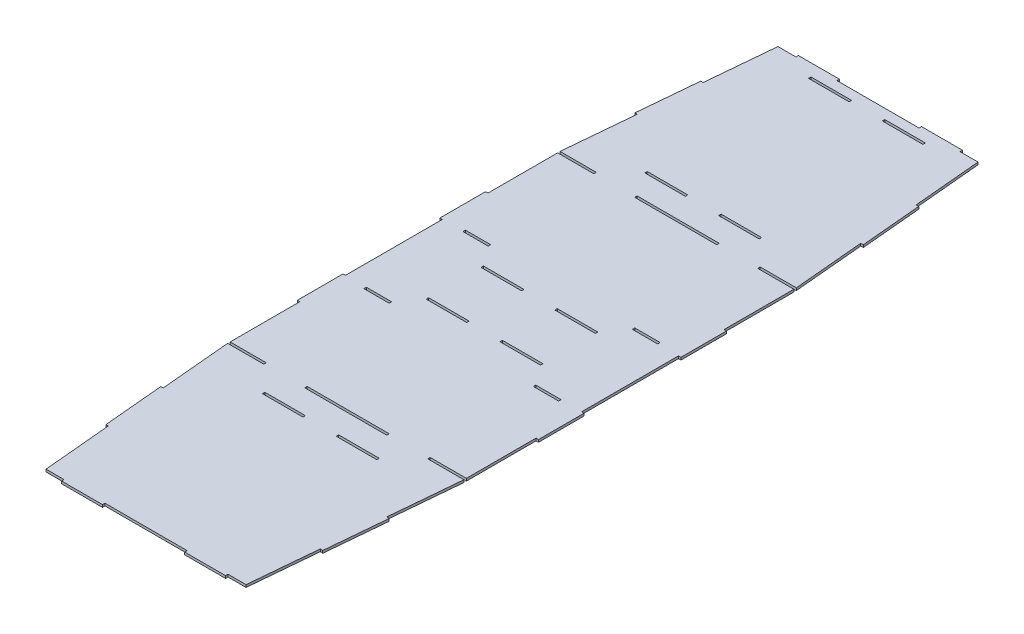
ISO-10303-21;
HEADER;
FILE_DESCRIPTION(('STEP AP214'),'2;1');
FILE_NAME('part.step','',(''),(''),'','','');
FILE_SCHEMA(('AUTOMOTIVE_DESIGN { 1 0 10303 214 1 1 1 1 }'));
ENDSEC;
DATA;
#1=APPLICATION_CONTEXT('core data for automotive mechanical design processes');
#2=APPLICATION_PROTOCOL_DEFINITION('international standard','automotive_design',2000,#1);
#3=PRODUCT_CONTEXT('',#1,'mechanical');
#4=PRODUCT('Part','Part','',(#3));
#5=PRODUCT_RELATED_PRODUCT_CATEGORY('part','',(#4));
#6=PRODUCT_DEFINITION_FORMATION('','',#4);
#7=PRODUCT_DEFINITION_CONTEXT('part definition',#1,'design');
#8=PRODUCT_DEFINITION('design','',#6,#7);
#9=PRODUCT_DEFINITION_SHAPE('','',#8);
#10=(LENGTH_UNIT() NAMED_UNIT(*) SI_UNIT(.MILLI.,.METRE.));
#11=(NAMED_UNIT(*) PLANE_ANGLE_UNIT() SI_UNIT($,.RADIAN.));
#12=(NAMED_UNIT(*) SI_UNIT($,.STERADIAN.) SOLID_ANGLE_UNIT());
#13=UNCERTAINTY_MEASURE_WITH_UNIT(LENGTH_MEASURE(1.E-05),#10,'distance_accuracy_value','');
#14=(GEOMETRIC_REPRESENTATION_CONTEXT(3) GLOBAL_UNCERTAINTY_ASSIGNED_CONTEXT((#13)) GLOBAL_UNIT_ASSIGNED_CONTEXT((#10,
#11,#12)) REPRESENTATION_CONTEXT('',''));
#15=CARTESIAN_POINT('',(0.,0.,0.));
#16=DIRECTION('',(0.,0.,1.));
#17=DIRECTION('',(1.,0.,0.));
#18=AXIS2_PLACEMENT_3D('',#15,#16,#17);
#19=CARTESIAN_POINT('',(0.,1.524,0.));
#20=DIRECTION('',(0.,-1.,0.));
#21=DIRECTION('',(0.,0.,-1.));
#22=AXIS2_PLACEMENT_3D('',#19,#20,#21);
#23=PLANE('',#22);
#24=DIRECTION('',(0.,0.,-1.));
#25=VECTOR('',#24,1.);
#26=CARTESIAN_POINT('',(-60.4722334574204,1.524,-197.133526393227));
#27=LINE('',#26,#25);
#28=CARTESIAN_POINT('',(-60.4722334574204,1.524,-195.609526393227));
#29=VERTEX_POINT('',#28);
#30=CARTESIAN_POINT('',(-60.4722334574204,1.524,-197.133526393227));
#31=VERTEX_POINT('',#30);
#32=EDGE_CURVE('E851',#29,#31,#27,.T.);
#33=ORIENTED_EDGE('',*,*,#32,.T.);
#34=DIRECTION('',(1.,0.,0.));
#35=VECTOR('',#34,1.);
#36=CARTESIAN_POINT('',(-60.4722334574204,1.524,-197.133526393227));
#37=LINE('',#36,#35);
#38=CARTESIAN_POINT('',(-44.7953310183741,1.524,-197.133526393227));
#39=VERTEX_POINT('',#38);
#40=EDGE_CURVE('E845',#31,#39,#37,.T.);
#41=ORIENTED_EDGE('',*,*,#40,.T.);
#42=DIRECTION('',(0.,0.,1.));
#43=VECTOR('',#42,1.);
#44=CARTESIAN_POINT('',(-44.7953310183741,1.524,-197.133526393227));
#45=LINE('',#44,#43);
#46=CARTESIAN_POINT('',(-44.7953310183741,1.524,-195.609526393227));
#47=VERTEX_POINT('',#46);
#48=EDGE_CURVE('E854',#39,#47,#45,.T.);
#49=ORIENTED_EDGE('',*,*,#48,.T.);
#50=DIRECTION('',(-1.,0.,0.));
#51=VECTOR('',#50,1.);
#52=CARTESIAN_POINT('',(-60.4722334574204,1.524,-195.609526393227));
#53=LINE('',#52,#51);
#54=EDGE_CURVE('E49',#47,#29,#53,.T.);
#55=ORIENTED_EDGE('',*,*,#54,.T.);
#56=EDGE_LOOP('',(#33,#41,#49,#55));
#57=FACE_BOUND('',#56,.T.);
#58=DIRECTION('',(-1.,0.,0.));
#59=VECTOR('',#58,1.);
#60=CARTESIAN_POINT('',(-60.4722334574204,1.524,-257.018473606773));
#61=LINE('',#60,#59);
#62=CARTESIAN_POINT('',(-44.7953310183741,1.524,-257.018473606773));
#63=VERTEX_POINT('',#62);
#64=CARTESIAN_POINT('',(-60.4722334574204,1.524,-257.018473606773));
#65=VERTEX_POINT('',#64);
#66=EDGE_CURVE('E889',#63,#65,#61,.T.);
#67=ORIENTED_EDGE('',*,*,#66,.T.);
#68=DIRECTION('',(0.,0.,-1.));
#69=VECTOR('',#68,1.);
#70=CARTESIAN_POINT('',(-60.4722334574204,1.524,-257.018473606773));
#71=LINE('',#70,#69);
#72=CARTESIAN_POINT('',(-60.4722334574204,1.524,-258.542473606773));
#73=VERTEX_POINT('',#72);
#74=EDGE_CURVE('E879',#65,#73,#71,.T.);
#75=ORIENTED_EDGE('',*,*,#74,.T.);
#76=DIRECTION('',(1.,0.,0.));
#77=VECTOR('',#76,1.);
#78=CARTESIAN_POINT('',(-60.4722334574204,1.524,-258.542473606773));
#79=LINE('',#78,#77);
#80=CARTESIAN_POINT('',(-44.7953310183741,1.524,-258.542473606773));
#81=VERTEX_POINT('',#80);
#82=EDGE_CURVE('E882',#73,#81,#79,.T.);
#83=ORIENTED_EDGE('',*,*,#82,.T.);
#84=DIRECTION('',(0.,0.,1.));
#85=VECTOR('',#84,1.);
#86=CARTESIAN_POINT('',(-44.7953310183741,1.524,-257.018473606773));
#87=LINE('',#86,#85);
#88=EDGE_CURVE('E886',#81,#63,#87,.T.);
#89=ORIENTED_EDGE('',*,*,#88,.T.);
#90=EDGE_LOOP('',(#67,#75,#83,#89));
#91=FACE_BOUND('',#90,.T.);
#92=DIRECTION('',(0.,0.,1.));
#93=VECTOR('',#92,1.);
#94=CARTESIAN_POINT('',(60.3266966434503,1.524,-257.018473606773));
#95=LINE('',#94,#93);
#96=CARTESIAN_POINT('',(60.3266966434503,1.524,-258.542473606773));
#97=VERTEX_POINT('',#96);
#98=CARTESIAN_POINT('',(60.3266966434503,1.524,-257.018473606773));
#99=VERTEX_POINT('',#98);
#100=EDGE_CURVE('E921',#97,#99,#95,.T.);
#101=ORIENTED_EDGE('',*,*,#100,.T.);
#102=DIRECTION('',(-1.,0.,0.));
#103=VECTOR('',#102,1.);
#104=CARTESIAN_POINT('',(60.3266966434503,1.524,-257.018473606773));
#105=LINE('',#104,#103);
#106=CARTESIAN_POINT('',(44.649794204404,1.524,-257.018473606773));
#107=VERTEX_POINT('',#106);
#108=EDGE_CURVE('E911',#99,#107,#105,.T.);
#109=ORIENTED_EDGE('',*,*,#108,.T.);
#110=DIRECTION('',(0.,0.,-1.));
#111=VECTOR('',#110,1.);
#112=CARTESIAN_POINT('',(44.649794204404,1.524,-257.018473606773));
#113=LINE('',#112,#111);
#114=CARTESIAN_POINT('',(44.6497942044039,1.524,-258.542473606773));
#115=VERTEX_POINT('',#114);
#116=EDGE_CURVE('E914',#107,#115,#113,.T.);
#117=ORIENTED_EDGE('',*,*,#116,.T.);
#118=DIRECTION('',(1.,0.,0.));
#119=VECTOR('',#118,1.);
#120=CARTESIAN_POINT('',(60.3266966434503,1.524,-258.542473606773));
#121=LINE('',#120,#119);
#122=EDGE_CURVE('E918',#115,#97,#121,.T.);
#123=ORIENTED_EDGE('',*,*,#122,.T.);
#124=EDGE_LOOP('',(#101,#109,#117,#123));
#125=FACE_BOUND('',#124,.T.);
#126=DIRECTION('',(1.,0.,0.));
#127=VECTOR('',#126,1.);
#128=CARTESIAN_POINT('',(60.3266966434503,1.524,-197.133526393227));
#129=LINE('',#128,#127);
#130=CARTESIAN_POINT('',(44.649794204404,1.524,-197.133526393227));
#131=VERTEX_POINT('',#130);
#132=CARTESIAN_POINT('',(60.3266966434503,1.524,-197.133526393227));
#133=VERTEX_POINT('',#132);
#134=EDGE_CURVE('E953',#131,#133,#129,.T.);
#135=ORIENTED_EDGE('',*,*,#134,.T.);
#136=DIRECTION('',(0.,0.,1.));
#137=VECTOR('',#136,1.);
#138=CARTESIAN_POINT('',(60.3266966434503,1.524,-197.133526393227));
#139=LINE('',#138,#137);
#140=CARTESIAN_POINT('',(60.3266966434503,1.524,-195.609526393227));
#141=VERTEX_POINT('',#140);
#142=EDGE_CURVE('E943',#133,#141,#139,.T.);
#143=ORIENTED_EDGE('',*,*,#142,.T.);
#144=DIRECTION('',(-1.,0.,0.));
#145=VECTOR('',#144,1.);
#146=CARTESIAN_POINT('',(60.3266966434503,1.524,-195.609526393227));
#147=LINE('',#146,#145);
#148=CARTESIAN_POINT('',(44.6497942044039,1.524,-195.609526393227));
#149=VERTEX_POINT('',#148);
#150=EDGE_CURVE('E946',#141,#149,#147,.T.);
#151=ORIENTED_EDGE('',*,*,#150,.T.);
#152=DIRECTION('',(0.,0.,-1.));
#153=VECTOR('',#152,1.);
#154=CARTESIAN_POINT('',(44.649794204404,1.524,-197.133526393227));
#155=LINE('',#154,#153);
#156=EDGE_CURVE('E950',#149,#131,#155,.T.);
#157=ORIENTED_EDGE('',*,*,#156,.T.);
#158=EDGE_LOOP('',(#135,#143,#151,#157));
#159=FACE_BOUND('',#158,.T.);
#160=DIRECTION('',(0.,0.,-1.));
#161=VECTOR('',#160,1.);
#162=CARTESIAN_POINT('',(35.3971700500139,1.524,-109.213200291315));
#163=LINE('',#162,#161);
#164=CARTESIAN_POINT('',(35.3971700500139,1.524,-107.689200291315));
#165=VERTEX_POINT('',#164);
#166=CARTESIAN_POINT('',(35.3971700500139,1.524,-109.213200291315));
#167=VERTEX_POINT('',#166);
#168=EDGE_CURVE('E1006',#165,#167,#163,.T.);
#169=ORIENTED_EDGE('',*,*,#168,.F.);
#170=DIRECTION('',(1.,0.,0.));
#171=VECTOR('',#170,1.);
#172=CARTESIAN_POINT('',(35.3971700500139,1.524,-107.689200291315));
#173=LINE('',#172,#171);
#174=CARTESIAN_POINT('',(10.2511639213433,1.524,-107.689200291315));
#175=VERTEX_POINT('',#174);
#176=EDGE_CURVE('E1014',#175,#165,#173,.T.);
#177=ORIENTED_EDGE('',*,*,#176,.F.);
#178=DIRECTION('',(0.,0.,1.));
#179=VECTOR('',#178,1.);
#180=CARTESIAN_POINT('',(10.2511639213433,1.524,-109.213200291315));
#181=LINE('',#180,#179);
#182=CARTESIAN_POINT('',(10.2511639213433,1.524,-109.213200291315));
#183=VERTEX_POINT('',#182);
#184=EDGE_CURVE('E1011',#183,#175,#181,.T.);
#185=ORIENTED_EDGE('',*,*,#184,.F.);
#186=DIRECTION('',(-1.,0.,0.));
#187=VECTOR('',#186,1.);
#188=CARTESIAN_POINT('',(35.3971700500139,1.524,-109.213200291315));
#189=LINE('',#188,#187);
#190=EDGE_CURVE('E1008',#167,#183,#189,.T.);
#191=ORIENTED_EDGE('',*,*,#190,.F.);
#192=EDGE_LOOP('',(#169,#177,#185,#191));
#193=FACE_BOUND('',#192,.T.);
#194=DIRECTION('',(0.,0.,1.));
#195=VECTOR('',#194,1.);
#196=CARTESIAN_POINT('',(-35.5427068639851,1.524,-446.538799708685));
#197=LINE('',#196,#195);
#198=CARTESIAN_POINT('',(-35.5427068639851,1.524,-448.062799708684));
#199=VERTEX_POINT('',#198);
#200=CARTESIAN_POINT('',(-35.5427068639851,1.524,-446.538799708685));
#201=VERTEX_POINT('',#200);
#202=EDGE_CURVE('E1068',#199,#201,#197,.T.);
#203=ORIENTED_EDGE('',*,*,#202,.F.);
#204=DIRECTION('',(-1.,0.,0.));
#205=VECTOR('',#204,1.);
#206=CARTESIAN_POINT('',(-35.5427068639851,1.524,-448.062799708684));
#207=LINE('',#206,#205);
#208=CARTESIAN_POINT('',(-10.3967007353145,1.524,-448.062799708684));
#209=VERTEX_POINT('',#208);
#210=EDGE_CURVE('E1076',#209,#199,#207,.T.);
#211=ORIENTED_EDGE('',*,*,#210,.F.);
#212=DIRECTION('',(0.,0.,-1.));
#213=VECTOR('',#212,1.);
#214=CARTESIAN_POINT('',(-10.3967007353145,1.524,-446.538799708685));
#215=LINE('',#214,#213);
#216=CARTESIAN_POINT('',(-10.3967007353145,1.524,-446.538799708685));
#217=VERTEX_POINT('',#216);
#218=EDGE_CURVE('E1073',#217,#209,#215,.T.);
#219=ORIENTED_EDGE('',*,*,#218,.F.);
#220=DIRECTION('',(1.,0.,0.));
#221=VECTOR('',#220,1.);
#222=CARTESIAN_POINT('',(-35.5427068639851,1.524,-446.538799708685));
#223=LINE('',#222,#221);
#224=EDGE_CURVE('E1070',#201,#217,#223,.T.);
#225=ORIENTED_EDGE('',*,*,#224,.F.);
#226=EDGE_LOOP('',(#203,#211,#219,#225));
#227=FACE_BOUND('',#226,.T.);
#228=DIRECTION('',(0.,0.,1.));
#229=VECTOR('',#228,1.);
#230=CARTESIAN_POINT('',(-35.5427068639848,1.524,-344.938799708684));
#231=LINE('',#230,#229);
#232=CARTESIAN_POINT('',(-35.5427068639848,1.524,-346.462799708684));
#233=VERTEX_POINT('',#232);
#234=CARTESIAN_POINT('',(-35.5427068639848,1.524,-344.938799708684));
#235=VERTEX_POINT('',#234);
#236=EDGE_CURVE('E1130',#233,#235,#231,.T.);
#237=ORIENTED_EDGE('',*,*,#236,.F.);
#238=DIRECTION('',(-1.,0.,0.));
#239=VECTOR('',#238,1.);
#240=CARTESIAN_POINT('',(-35.5427068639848,1.524,-346.462799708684));
#241=LINE('',#240,#239);
#242=CARTESIAN_POINT('',(-10.3967007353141,1.524,-346.462799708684));
#243=VERTEX_POINT('',#242);
#244=EDGE_CURVE('E1138',#243,#233,#241,.T.);
#245=ORIENTED_EDGE('',*,*,#244,.F.);
#246=DIRECTION('',(0.,0.,-1.));
#247=VECTOR('',#246,1.);
#248=CARTESIAN_POINT('',(-10.3967007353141,1.524,-344.938799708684));
#249=LINE('',#248,#247);
#250=CARTESIAN_POINT('',(-10.3967007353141,1.524,-344.938799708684));
#251=VERTEX_POINT('',#250);
#252=EDGE_CURVE('E1135',#251,#243,#249,.T.);
#253=ORIENTED_EDGE('',*,*,#252,.F.);
#254=DIRECTION('',(1.,0.,0.));
#255=VECTOR('',#254,1.);
#256=CARTESIAN_POINT('',(-35.5427068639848,1.524,-344.938799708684));
#257=LINE('',#256,#255);
#258=EDGE_CURVE('E1132',#235,#251,#257,.T.);
#259=ORIENTED_EDGE('',*,*,#258,.F.);
#260=EDGE_LOOP('',(#237,#245,#253,#259));
#261=FACE_BOUND('',#260,.T.);
#262=DIRECTION('',(-1.,0.,0.));
#263=VECTOR('',#262,1.);
#264=CARTESIAN_POINT('',(-35.5427068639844,1.524,-210.813200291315));
#265=LINE('',#264,#263);
#266=CARTESIAN_POINT('',(-10.3967007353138,1.524,-210.813200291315));
#267=VERTEX_POINT('',#266);
#268=CARTESIAN_POINT('',(-35.5427068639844,1.524,-210.813200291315));
#269=VERTEX_POINT('',#268);
#270=EDGE_CURVE('E1192',#267,#269,#265,.T.);
#271=ORIENTED_EDGE('',*,*,#270,.F.);
#272=DIRECTION('',(0.,0.,-1.));
#273=VECTOR('',#272,1.);
#274=CARTESIAN_POINT('',(-10.3967007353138,1.524,-210.813200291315));
#275=LINE('',#274,#273);
#276=CARTESIAN_POINT('',(-10.3967007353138,1.524,-209.289200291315));
#277=VERTEX_POINT('',#276);
#278=EDGE_CURVE('E1200',#277,#267,#275,.T.);
#279=ORIENTED_EDGE('',*,*,#278,.F.);
#280=DIRECTION('',(1.,0.,0.));
#281=VECTOR('',#280,1.);
#282=CARTESIAN_POINT('',(-35.5427068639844,1.524,-209.289200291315));
#283=LINE('',#282,#281);
#284=CARTESIAN_POINT('',(-35.5427068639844,1.524,-209.289200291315));
#285=VERTEX_POINT('',#284);
#286=EDGE_CURVE('E1197',#285,#277,#283,.T.);
#287=ORIENTED_EDGE('',*,*,#286,.F.);
#288=DIRECTION('',(0.,0.,1.));
#289=VECTOR('',#288,1.);
#290=CARTESIAN_POINT('',(-35.5427068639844,1.524,-210.813200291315));
#291=LINE('',#290,#289);
#292=EDGE_CURVE('E1194',#269,#285,#291,.T.);
#293=ORIENTED_EDGE('',*,*,#292,.F.);
#294=EDGE_LOOP('',(#271,#279,#287,#293));
#295=FACE_BOUND('',#294,.T.);
#296=DIRECTION('',(0.,0.,-1.));
#297=VECTOR('',#296,1.);
#298=CARTESIAN_POINT('',(25.3963875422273,1.524,-125.476));
#299=LINE('',#298,#297);
#300=CARTESIAN_POINT('',(25.3963875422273,1.524,-123.952));
#301=VERTEX_POINT('',#300);
#302=CARTESIAN_POINT('',(25.3963875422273,1.524,-125.476));
#303=VERTEX_POINT('',#302);
#304=EDGE_CURVE('E1254',#301,#303,#299,.T.);
#305=ORIENTED_EDGE('',*,*,#304,.F.);
#306=DIRECTION('',(1.,0.,0.));
#307=VECTOR('',#306,1.);
#308=CARTESIAN_POINT('',(25.3963875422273,1.524,-123.952));
#309=LINE('',#308,#307);
#310=CARTESIAN_POINT('',(-25.5419243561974,1.524,-123.952));
#311=VERTEX_POINT('',#310);
#312=EDGE_CURVE('E1262',#311,#301,#309,.T.);
#313=ORIENTED_EDGE('',*,*,#312,.F.);
#314=DIRECTION('',(0.,0.,1.));
#315=VECTOR('',#314,1.);
#316=CARTESIAN_POINT('',(-25.5419243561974,1.524,-123.952));
#317=LINE('',#316,#315);
#318=CARTESIAN_POINT('',(-25.5419243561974,1.524,-125.476));
#319=VERTEX_POINT('',#318);
#320=EDGE_CURVE('E1259',#319,#311,#317,.T.);
#321=ORIENTED_EDGE('',*,*,#320,.F.);
#322=DIRECTION('',(-1.,0.,0.));
#323=VECTOR('',#322,1.);
#324=CARTESIAN_POINT('',(25.3963875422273,1.524,-125.476));
#325=LINE('',#324,#323);
#326=EDGE_CURVE('E1256',#303,#319,#325,.T.);
#327=ORIENTED_EDGE('',*,*,#326,.F.);
#328=EDGE_LOOP('',(#305,#313,#321,#327));
#329=FACE_BOUND('',#328,.T.);
#330=DIRECTION('',(0.,0.,1.));
#331=VECTOR('',#330,1.);
#332=CARTESIAN_POINT('',(-35.5427068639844,1.524,-243.338799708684));
#333=LINE('',#332,#331);
#334=CARTESIAN_POINT('',(-35.5427068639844,1.524,-244.862799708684));
#335=VERTEX_POINT('',#334);
#336=CARTESIAN_POINT('',(-35.5427068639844,1.524,-243.338799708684));
#337=VERTEX_POINT('',#336);
#338=EDGE_CURVE('E1316',#335,#337,#333,.T.);
#339=ORIENTED_EDGE('',*,*,#338,.F.);
#340=DIRECTION('',(-1.,0.,0.));
#341=VECTOR('',#340,1.);
#342=CARTESIAN_POINT('',(-35.5427068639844,1.524,-244.862799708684));
#343=LINE('',#342,#341);
#344=CARTESIAN_POINT('',(-10.3967007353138,1.524,-244.862799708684));
#345=VERTEX_POINT('',#344);
#346=EDGE_CURVE('E1324',#345,#335,#343,.T.);
#347=ORIENTED_EDGE('',*,*,#346,.F.);
#348=DIRECTION('',(0.,0.,-1.));
#349=VECTOR('',#348,1.);
#350=CARTESIAN_POINT('',(-10.3967007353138,1.524,-243.338799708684));
#351=LINE('',#350,#349);
#352=CARTESIAN_POINT('',(-10.3967007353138,1.524,-243.338799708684));
#353=VERTEX_POINT('',#352);
#354=EDGE_CURVE('E1321',#353,#345,#351,.T.);
#355=ORIENTED_EDGE('',*,*,#354,.F.);
#356=DIRECTION('',(1.,0.,0.));
#357=VECTOR('',#356,1.);
#358=CARTESIAN_POINT('',(-35.5427068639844,1.524,-243.338799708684));
#359=LINE('',#358,#357);
#360=EDGE_CURVE('E1318',#337,#353,#359,.T.);
#361=ORIENTED_EDGE('',*,*,#360,.F.);
#362=EDGE_LOOP('',(#339,#347,#355,#361));
#363=FACE_BOUND('',#362,.T.);
#364=DIRECTION('',(0.0904060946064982,0.,-0.995904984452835));
#365=VECTOR('',#364,1.);
#366=CARTESIAN_POINT('',(61.99117695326,1.524,0.));
#367=LINE('',#366,#365);
#368=CARTESIAN_POINT('',(61.99117695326,1.524,0.));
#369=VERTEX_POINT('',#368);
#370=CARTESIAN_POINT('',(65.8314374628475,1.524,-42.3039464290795));
#371=VERTEX_POINT('',#370);
#372=EDGE_CURVE('E1347',#369,#371,#367,.T.);
#373=ORIENTED_EDGE('',*,*,#372,.T.);
#374=DIRECTION('',(0.995904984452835,0.,0.0904060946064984));
#375=VECTOR('',#374,1.);
#376=CARTESIAN_POINT('',(65.8314374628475,1.524,-42.3039464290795));
#377=LINE('',#376,#375);
#378=CARTESIAN_POINT('',(67.4168040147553,1.524,-42.160030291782));
#379=VERTEX_POINT('',#378);
#380=EDGE_CURVE('E1350',#371,#379,#377,.T.);
#381=ORIENTED_EDGE('',*,*,#380,.T.);
#382=DIRECTION('',(0.0904060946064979,0.,-0.995904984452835));
#383=VECTOR('',#382,1.);
#384=CARTESIAN_POINT('',(67.4168040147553,1.524,-42.160030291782));
#385=LINE('',#384,#383);
#386=CARTESIAN_POINT('',(70.8482995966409,1.524,-79.9610609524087));
#387=VERTEX_POINT('',#386);
#388=EDGE_CURVE('E1353',#379,#387,#385,.T.);
#389=ORIENTED_EDGE('',*,*,#388,.T.);
#390=DIRECTION('',(-0.995904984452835,0.,-0.0904060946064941));
#391=VECTOR('',#390,1.);
#392=CARTESIAN_POINT('',(70.8482995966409,1.524,-79.9610609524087));
#393=LINE('',#392,#391);
#394=CARTESIAN_POINT('',(69.2629330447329,1.524,-80.1049770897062));
#395=VERTEX_POINT('',#394);
#396=EDGE_CURVE('E1355',#387,#395,#393,.T.);
#397=ORIENTED_EDGE('',*,*,#396,.T.);
#398=DIRECTION('',(0.0897655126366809,0.,-0.99596292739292));
#399=VECTOR('',#398,1.);
#400=CARTESIAN_POINT('',(69.2629330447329,1.524,-80.1049770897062));
#401=LINE('',#400,#399);
#402=CARTESIAN_POINT('',(73.2149208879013,1.524,-123.952923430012));
#403=VERTEX_POINT('',#402);
#404=EDGE_CURVE('E1357',#395,#403,#401,.T.);
#405=ORIENTED_EDGE('',*,*,#404,.T.);
#406=DIRECTION('',(-0.999999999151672,0.,4.11904738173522E-05));
#407=VECTOR('',#406,1.);
#408=CARTESIAN_POINT('',(73.2149208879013,1.524,-123.952923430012));
#409=LINE('',#408,#407);
#410=CARTESIAN_POINT('',(50.7963875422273,1.524,-123.952));
#411=VERTEX_POINT('',#410);
#412=EDGE_CURVE('E1359',#403,#411,#409,.T.);
#413=ORIENTED_EDGE('',*,*,#412,.T.);
#414=DIRECTION('',(0.,0.,-1.));
#415=VECTOR('',#414,1.);
#416=CARTESIAN_POINT('',(50.7963875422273,1.524,-123.952));
#417=LINE('',#416,#415);
#418=CARTESIAN_POINT('',(50.7963875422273,1.524,-125.476));
#419=VERTEX_POINT('',#418);
#420=EDGE_CURVE('E1361',#411,#419,#417,.T.);
#421=ORIENTED_EDGE('',*,*,#420,.T.);
#422=DIRECTION('',(1.,0.,0.));
#423=VECTOR('',#422,1.);
#424=CARTESIAN_POINT('',(73.2149208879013,1.524,-125.476));
#425=LINE('',#424,#423);
#426=CARTESIAN_POINT('',(73.2149208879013,1.524,-125.476));
#427=VERTEX_POINT('',#426);
#428=EDGE_CURVE('E1363',#419,#427,#425,.T.);
#429=ORIENTED_EDGE('',*,*,#428,.T.);
#430=DIRECTION('',(0.,0.,-1.));
#431=VECTOR('',#430,1.);
#432=CARTESIAN_POINT('',(73.2149208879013,1.524,-125.476));
#433=LINE('',#432,#431);
#434=CARTESIAN_POINT('',(73.2149208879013,1.524,-168.711255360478));
#435=VERTEX_POINT('',#434);
#436=EDGE_CURVE('E1365',#427,#435,#433,.T.);
#437=ORIENTED_EDGE('',*,*,#436,.T.);
#438=DIRECTION('',(1.,0.,0.));
#439=VECTOR('',#438,1.);
#440=CARTESIAN_POINT('',(73.2149208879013,1.524,-168.711255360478));
#441=LINE('',#440,#439);
#442=CARTESIAN_POINT('',(74.7389208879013,1.524,-168.711255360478));
#443=VERTEX_POINT('',#442);
#444=EDGE_CURVE('E1367',#435,#443,#441,.T.);
#445=ORIENTED_EDGE('',*,*,#444,.T.);
#446=DIRECTION('',(0.,0.,-1.));
#447=VECTOR('',#446,1.);
#448=CARTESIAN_POINT('',(74.7389208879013,1.524,-197.062900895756));
#449=LINE('',#448,#447);
#450=CARTESIAN_POINT('',(74.7389208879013,1.524,-197.062900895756));
#451=VERTEX_POINT('',#450);
#452=EDGE_CURVE('E1369',#443,#451,#449,.T.);
#453=ORIENTED_EDGE('',*,*,#452,.T.);
#454=DIRECTION('',(-1.,0.,0.));
#455=VECTOR('',#454,1.);
#456=CARTESIAN_POINT('',(73.2149208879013,1.524,-197.062900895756));
#457=LINE('',#456,#455);
#458=CARTESIAN_POINT('',(73.2149208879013,1.524,-197.062900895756));
#459=VERTEX_POINT('',#458);
#460=EDGE_CURVE('E1371',#451,#459,#457,.T.);
#461=ORIENTED_EDGE('',*,*,#460,.T.);
#462=DIRECTION('',(0.,0.,-1.));
#463=VECTOR('',#462,1.);
#464=CARTESIAN_POINT('',(73.2149208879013,1.524,-197.062900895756));
#465=LINE('',#464,#463);
#466=CARTESIAN_POINT('',(73.2149208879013,1.524,-257.089099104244));
#467=VERTEX_POINT('',#466);
#468=EDGE_CURVE('E1373',#459,#467,#465,.T.);
#469=ORIENTED_EDGE('',*,*,#468,.T.);
#470=DIRECTION('',(1.,0.,0.));
#471=VECTOR('',#470,1.);
#472=CARTESIAN_POINT('',(73.2149208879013,1.524,-257.089099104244));
#473=LINE('',#472,#471);
#474=CARTESIAN_POINT('',(74.7389208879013,1.524,-257.089099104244));
#475=VERTEX_POINT('',#474);
#476=EDGE_CURVE('E1375',#467,#475,#473,.T.);
#477=ORIENTED_EDGE('',*,*,#476,.T.);
#478=DIRECTION('',(0.,0.,-1.));
#479=VECTOR('',#478,1.);
#480=CARTESIAN_POINT('',(74.7389208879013,1.524,-257.089099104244));
#481=LINE('',#480,#479);
#482=CARTESIAN_POINT('',(74.7389208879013,1.524,-285.440744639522));
#483=VERTEX_POINT('',#482);
#484=EDGE_CURVE('E1377',#475,#483,#481,.T.);
#485=ORIENTED_EDGE('',*,*,#484,.T.);
#486=DIRECTION('',(-1.,0.,0.));
#487=VECTOR('',#486,1.);
#488=CARTESIAN_POINT('',(73.2149208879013,1.524,-285.440744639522));
#489=LINE('',#488,#487);
#490=CARTESIAN_POINT('',(73.2149208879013,1.524,-285.440744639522));
#491=VERTEX_POINT('',#490);
#492=EDGE_CURVE('E1379',#483,#491,#489,.T.);
#493=ORIENTED_EDGE('',*,*,#492,.T.);
#494=DIRECTION('',(0.,0.,-1.));
#495=VECTOR('',#494,1.);
#496=CARTESIAN_POINT('',(73.2149208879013,1.524,-285.440744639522));
#497=LINE('',#496,#495);
#498=CARTESIAN_POINT('',(73.2149208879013,1.524,-328.676));
#499=VERTEX_POINT('',#498);
#500=EDGE_CURVE('E1381',#491,#499,#497,.T.);
#501=ORIENTED_EDGE('',*,*,#500,.T.);
#502=DIRECTION('',(-1.,0.,0.));
#503=VECTOR('',#502,1.);
#504=CARTESIAN_POINT('',(73.2149208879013,1.524,-328.676));
#505=LINE('',#504,#503);
#506=CARTESIAN_POINT('',(50.7963875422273,1.524,-328.676));
#507=VERTEX_POINT('',#506);
#508=EDGE_CURVE('E1383',#499,#507,#505,.T.);
#509=ORIENTED_EDGE('',*,*,#508,.T.);
#510=DIRECTION('',(0.,0.,-1.));
#511=VECTOR('',#510,1.);
#512=CARTESIAN_POINT('',(50.7963875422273,1.524,-330.2));
#513=LINE('',#512,#511);
#514=CARTESIAN_POINT('',(50.7963875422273,1.524,-330.2));
#515=VERTEX_POINT('',#514);
#516=EDGE_CURVE('E1385',#507,#515,#513,.T.);
#517=ORIENTED_EDGE('',*,*,#516,.T.);
#518=DIRECTION('',(0.999999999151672,0.,4.11904738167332E-05));
#519=VECTOR('',#518,1.);
#520=CARTESIAN_POINT('',(73.2149208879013,1.524,-330.199076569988));
#521=LINE('',#520,#519);
#522=CARTESIAN_POINT('',(73.2149208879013,1.524,-330.199076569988));
#523=VERTEX_POINT('',#522);
#524=EDGE_CURVE('E1387',#515,#523,#521,.T.);
#525=ORIENTED_EDGE('',*,*,#524,.T.);
#526=DIRECTION('',(-0.0897655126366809,0.,-0.99596292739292));
#527=VECTOR('',#526,1.);
#528=CARTESIAN_POINT('',(69.2629330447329,1.524,-374.047022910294));
#529=LINE('',#528,#527);
#530=CARTESIAN_POINT('',(69.2629330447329,1.524,-374.047022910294));
#531=VERTEX_POINT('',#530);
#532=EDGE_CURVE('E1389',#523,#531,#529,.T.);
#533=ORIENTED_EDGE('',*,*,#532,.T.);
#534=DIRECTION('',(0.995904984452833,0.,-0.09040609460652));
#535=VECTOR('',#534,1.);
#536=CARTESIAN_POINT('',(70.8482995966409,1.524,-374.190939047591));
#537=LINE('',#536,#535);
#538=CARTESIAN_POINT('',(70.8482995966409,1.524,-374.190939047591));
#539=VERTEX_POINT('',#538);
#540=EDGE_CURVE('E1391',#531,#539,#537,.T.);
#541=ORIENTED_EDGE('',*,*,#540,.T.);
#542=DIRECTION('',(-0.0904060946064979,0.,-0.995904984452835));
#543=VECTOR('',#542,1.);
#544=CARTESIAN_POINT('',(67.4168040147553,1.524,-411.991969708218));
#545=LINE('',#544,#543);
#546=CARTESIAN_POINT('',(67.4168040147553,1.524,-411.991969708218));
#547=VERTEX_POINT('',#546);
#548=EDGE_CURVE('E1393',#539,#547,#545,.T.);
#549=ORIENTED_EDGE('',*,*,#548,.T.);
#550=DIRECTION('',(-0.995904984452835,0.,0.0904060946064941));
#551=VECTOR('',#550,1.);
#552=CARTESIAN_POINT('',(65.8314374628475,1.524,-411.84805357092));
#553=LINE('',#552,#551);
#554=CARTESIAN_POINT('',(65.8314374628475,1.524,-411.84805357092));
#555=VERTEX_POINT('',#554);
#556=EDGE_CURVE('E1395',#547,#555,#553,.T.);
#557=ORIENTED_EDGE('',*,*,#556,.T.);
#558=DIRECTION('',(-0.0904060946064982,0.,-0.995904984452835));
#559=VECTOR('',#558,1.);
#560=CARTESIAN_POINT('',(61.99117695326,1.524,-454.152));
#561=LINE('',#560,#559);
#562=CARTESIAN_POINT('',(61.99117695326,1.524,-454.152));
#563=VERTEX_POINT('',#562);
#564=EDGE_CURVE('E1397',#555,#563,#561,.T.);
#565=ORIENTED_EDGE('',*,*,#564,.T.);
#566=DIRECTION('',(-1.,0.,0.));
#567=VECTOR('',#566,1.);
#568=CARTESIAN_POINT('',(61.99117695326,1.524,-454.152));
#569=LINE('',#568,#567);
#570=CARTESIAN_POINT('',(50.7963875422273,1.524,-454.152));
#571=VERTEX_POINT('',#570);
#572=EDGE_CURVE('E1399',#563,#571,#569,.T.);
#573=ORIENTED_EDGE('',*,*,#572,.T.);
#574=DIRECTION('',(0.,0.,-1.));
#575=VECTOR('',#574,1.);
#576=CARTESIAN_POINT('',(50.7963875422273,1.524,-454.152));
#577=LINE('',#576,#575);
#578=CARTESIAN_POINT('',(50.7963875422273,1.524,-455.676));
#579=VERTEX_POINT('',#578);
#580=EDGE_CURVE('E1401',#571,#579,#577,.T.);
#581=ORIENTED_EDGE('',*,*,#580,.T.);
#582=DIRECTION('',(-1.,0.,0.));
#583=VECTOR('',#582,1.);
#584=CARTESIAN_POINT('',(50.7963875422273,1.524,-455.676));
#585=LINE('',#584,#583);
#586=CARTESIAN_POINT('',(25.3963875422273,1.524,-455.676));
#587=VERTEX_POINT('',#586);
#588=EDGE_CURVE('E1403',#579,#587,#585,.T.);
#589=ORIENTED_EDGE('',*,*,#588,.T.);
#590=DIRECTION('',(0.,0.,1.));
#591=VECTOR('',#590,1.);
#592=CARTESIAN_POINT('',(25.3963875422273,1.524,-455.676));
#593=LINE('',#592,#591);
#594=CARTESIAN_POINT('',(25.3963875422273,1.524,-454.152));
#595=VERTEX_POINT('',#594);
#596=EDGE_CURVE('E1405',#587,#595,#593,.T.);
#597=ORIENTED_EDGE('',*,*,#596,.T.);
#598=DIRECTION('',(-1.,0.,0.));
#599=VECTOR('',#598,1.);
#600=CARTESIAN_POINT('',(25.3963875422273,1.524,-454.152));
#601=LINE('',#600,#599);
#602=CARTESIAN_POINT('',(-25.5419243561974,1.524,-454.152));
#603=VERTEX_POINT('',#602);
#604=EDGE_CURVE('E1407',#595,#603,#601,.T.);
#605=ORIENTED_EDGE('',*,*,#604,.T.);
#606=DIRECTION('',(0.,0.,-1.));
#607=VECTOR('',#606,1.);
#608=CARTESIAN_POINT('',(-25.5419243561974,1.524,-454.152));
#609=LINE('',#608,#607);
#610=CARTESIAN_POINT('',(-25.5419243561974,1.524,-455.676));
#611=VERTEX_POINT('',#610);
#612=EDGE_CURVE('E1409',#603,#611,#609,.T.);
#613=ORIENTED_EDGE('',*,*,#612,.T.);
#614=DIRECTION('',(-1.,0.,0.));
#615=VECTOR('',#614,1.);
#616=CARTESIAN_POINT('',(-25.5419243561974,1.524,-455.676));
#617=LINE('',#616,#615);
#618=CARTESIAN_POINT('',(-50.9419243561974,1.524,-455.676));
#619=VERTEX_POINT('',#618);
#620=EDGE_CURVE('E1411',#611,#619,#617,.T.);
#621=ORIENTED_EDGE('',*,*,#620,.T.);
#622=DIRECTION('',(0.,0.,1.));
#623=VECTOR('',#622,1.);
#624=CARTESIAN_POINT('',(-50.9419243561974,1.524,-455.676));
#625=LINE('',#624,#623);
#626=CARTESIAN_POINT('',(-50.9419243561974,1.524,-454.152));
#627=VERTEX_POINT('',#626);
#628=EDGE_CURVE('E1413',#619,#627,#625,.T.);
#629=ORIENTED_EDGE('',*,*,#628,.T.);
#630=DIRECTION('',(-1.,0.,0.));
#631=VECTOR('',#630,1.);
#632=CARTESIAN_POINT('',(-50.9419243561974,1.524,-454.152));
#633=LINE('',#632,#631);
#634=CARTESIAN_POINT('',(-62.1368033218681,1.524,-454.152));
#635=VERTEX_POINT('',#634);
#636=EDGE_CURVE('E1415',#627,#635,#633,.T.);
#637=ORIENTED_EDGE('',*,*,#636,.T.);
#638=DIRECTION('',(-0.0903635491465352,0.,0.995908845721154));
#639=VECTOR('',#638,1.);
#640=CARTESIAN_POINT('',(-66.0003680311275,1.524,-411.571132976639));
#641=LINE('',#640,#639);
#642=CARTESIAN_POINT('',(-66.0003680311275,1.524,-411.571132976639));
#643=VERTEX_POINT('',#642);
#644=EDGE_CURVE('E1417',#635,#643,#641,.T.);
#645=ORIENTED_EDGE('',*,*,#644,.T.);
#646=DIRECTION('',(-0.99468371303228,0.,-0.102977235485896));
#647=VECTOR('',#646,1.);
#648=CARTESIAN_POINT('',(-67.4803084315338,1.524,-411.724347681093));
#649=LINE('',#648,#647);
#650=CARTESIAN_POINT('',(-67.4803084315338,1.524,-411.724347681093));
#651=VERTEX_POINT('',#650);
#652=EDGE_CURVE('E1419',#643,#651,#649,.T.);
#653=ORIENTED_EDGE('',*,*,#652,.T.);
#654=DIRECTION('',(-0.0899921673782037,0.,0.99594247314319));
#655=VECTOR('',#654,1.);
#656=CARTESIAN_POINT('',(-70.8707386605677,1.524,-374.202488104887));
#657=LINE('',#656,#655);
#658=CARTESIAN_POINT('',(-70.8707386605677,1.524,-374.202488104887));
#659=VERTEX_POINT('',#658);
#660=EDGE_CURVE('E1421',#651,#659,#657,.T.);
#661=ORIENTED_EDGE('',*,*,#660,.T.);
#662=DIRECTION('',(0.994783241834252,0.,0.102011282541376));
#663=VECTOR('',#662,1.);
#664=CARTESIAN_POINT('',(-70.8707386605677,1.524,-374.202488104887));
#665=LINE('',#664,#663);
#666=CARTESIAN_POINT('',(-69.4046443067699,1.524,-374.052145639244));
#667=VERTEX_POINT('',#666);
#668=EDGE_CURVE('E1423',#659,#667,#665,.T.);
#669=ORIENTED_EDGE('',*,*,#668,.T.);
#670=DIRECTION('',(-0.0903635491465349,0.,0.995908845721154));
#671=VECTOR('',#670,1.);
#672=CARTESIAN_POINT('',(-73.3835581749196,1.524,-330.2));
#673=LINE('',#672,#671);
#674=CARTESIAN_POINT('',(-73.3835581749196,1.524,-330.2));
#675=VERTEX_POINT('',#674);
#676=EDGE_CURVE('E1425',#667,#675,#673,.T.);
#677=ORIENTED_EDGE('',*,*,#676,.T.);
#678=DIRECTION('',(1.,0.,0.));
#679=VECTOR('',#678,1.);
#680=CARTESIAN_POINT('',(-50.9419243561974,1.524,-330.2));
#681=LINE('',#680,#679);
#682=CARTESIAN_POINT('',(-50.9419243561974,1.524,-330.2));
#683=VERTEX_POINT('',#682);
#684=EDGE_CURVE('E1427',#675,#683,#681,.T.);
#685=ORIENTED_EDGE('',*,*,#684,.T.);
#686=DIRECTION('',(0.,0.,1.));
#687=VECTOR('',#686,1.);
#688=CARTESIAN_POINT('',(-50.9419243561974,1.524,-328.676));
#689=LINE('',#688,#687);
#690=CARTESIAN_POINT('',(-50.9419243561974,1.524,-328.676));
#691=VERTEX_POINT('',#690);
#692=EDGE_CURVE('E1429',#683,#691,#689,.T.);
#693=ORIENTED_EDGE('',*,*,#692,.T.);
#694=DIRECTION('',(-1.,0.,0.));
#695=VECTOR('',#694,1.);
#696=CARTESIAN_POINT('',(-50.9419243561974,1.524,-328.676));
#697=LINE('',#696,#695);
#698=CARTESIAN_POINT('',(-73.3604577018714,1.524,-328.676));
#699=VERTEX_POINT('',#698);
#700=EDGE_CURVE('E1431',#691,#699,#697,.T.);
#701=ORIENTED_EDGE('',*,*,#700,.T.);
#702=DIRECTION('',(0.,0.,1.));
#703=VECTOR('',#702,1.);
#704=CARTESIAN_POINT('',(-73.3604577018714,1.524,-285.440744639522));
#705=LINE('',#704,#703);
#706=CARTESIAN_POINT('',(-73.3604577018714,1.524,-285.440744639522));
#707=VERTEX_POINT('',#706);
#708=EDGE_CURVE('E1433',#699,#707,#705,.T.);
#709=ORIENTED_EDGE('',*,*,#708,.T.);
#710=DIRECTION('',(-1.,0.,0.));
#711=VECTOR('',#710,1.);
#712=CARTESIAN_POINT('',(-73.3604577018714,1.524,-285.440744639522));
#713=LINE('',#712,#711);
#714=CARTESIAN_POINT('',(-74.8844577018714,1.524,-285.440744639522));
#715=VERTEX_POINT('',#714);
#716=EDGE_CURVE('E1435',#707,#715,#713,.T.);
#717=ORIENTED_EDGE('',*,*,#716,.T.);
#718=DIRECTION('',(0.,0.,1.));
#719=VECTOR('',#718,1.);
#720=CARTESIAN_POINT('',(-74.8844577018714,1.524,-257.089099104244));
#721=LINE('',#720,#719);
#722=CARTESIAN_POINT('',(-74.8844577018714,1.524,-257.089099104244));
#723=VERTEX_POINT('',#722);
#724=EDGE_CURVE('E1437',#715,#723,#721,.T.);
#725=ORIENTED_EDGE('',*,*,#724,.T.);
#726=DIRECTION('',(1.,0.,0.));
#727=VECTOR('',#726,1.);
#728=CARTESIAN_POINT('',(-73.3604577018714,1.524,-257.089099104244));
#729=LINE('',#728,#727);
#730=CARTESIAN_POINT('',(-73.3604577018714,1.524,-257.089099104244));
#731=VERTEX_POINT('',#730);
#732=EDGE_CURVE('E1439',#723,#731,#729,.T.);
#733=ORIENTED_EDGE('',*,*,#732,.T.);
#734=DIRECTION('',(0.,0.,1.));
#735=VECTOR('',#734,1.);
#736=CARTESIAN_POINT('',(-73.3604577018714,1.524,-197.062900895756));
#737=LINE('',#736,#735);
#738=CARTESIAN_POINT('',(-73.3604577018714,1.524,-197.062900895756));
#739=VERTEX_POINT('',#738);
#740=EDGE_CURVE('E1441',#731,#739,#737,.T.);
#741=ORIENTED_EDGE('',*,*,#740,.T.);
#742=DIRECTION('',(-1.,0.,0.));
#743=VECTOR('',#742,1.);
#744=CARTESIAN_POINT('',(-73.3604577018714,1.524,-197.062900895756));
#745=LINE('',#744,#743);
#746=CARTESIAN_POINT('',(-74.8844577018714,1.524,-197.062900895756));
#747=VERTEX_POINT('',#746);
#748=EDGE_CURVE('E1443',#739,#747,#745,.T.);
#749=ORIENTED_EDGE('',*,*,#748,.T.);
#750=DIRECTION('',(0.,0.,1.));
#751=VECTOR('',#750,1.);
#752=CARTESIAN_POINT('',(-74.8844577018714,1.524,-197.062900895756));
#753=LINE('',#752,#751);
#754=CARTESIAN_POINT('',(-74.8844577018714,1.524,-168.711255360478));
#755=VERTEX_POINT('',#754);
#756=EDGE_CURVE('E1445',#747,#755,#753,.T.);
#757=ORIENTED_EDGE('',*,*,#756,.T.);
#758=DIRECTION('',(1.,0.,0.));
#759=VECTOR('',#758,1.);
#760=CARTESIAN_POINT('',(-73.3604577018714,1.524,-168.711255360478));
#761=LINE('',#760,#759);
#762=CARTESIAN_POINT('',(-73.3604577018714,1.524,-168.711255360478));
#763=VERTEX_POINT('',#762);
#764=EDGE_CURVE('E1447',#755,#763,#761,.T.);
#765=ORIENTED_EDGE('',*,*,#764,.T.);
#766=DIRECTION('',(0.,0.,1.));
#767=VECTOR('',#766,1.);
#768=CARTESIAN_POINT('',(-73.3604577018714,1.524,-125.476));
#769=LINE('',#768,#767);
#770=CARTESIAN_POINT('',(-73.3604577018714,1.524,-125.476));
#771=VERTEX_POINT('',#770);
#772=EDGE_CURVE('E1449',#763,#771,#769,.T.);
#773=ORIENTED_EDGE('',*,*,#772,.T.);
#774=DIRECTION('',(1.,0.,0.));
#775=VECTOR('',#774,1.);
#776=CARTESIAN_POINT('',(-50.9419243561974,1.524,-125.476));
#777=LINE('',#776,#775);
#778=CARTESIAN_POINT('',(-50.9419243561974,1.524,-125.476));
#779=VERTEX_POINT('',#778);
#780=EDGE_CURVE('E1451',#771,#779,#777,.T.);
#781=ORIENTED_EDGE('',*,*,#780,.T.);
#782=DIRECTION('',(0.,0.,1.));
#783=VECTOR('',#782,1.);
#784=CARTESIAN_POINT('',(-50.9419243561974,1.524,-125.476));
#785=LINE('',#784,#783);
#786=CARTESIAN_POINT('',(-50.9419243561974,1.524,-123.952));
#787=VERTEX_POINT('',#786);
#788=EDGE_CURVE('E1453',#779,#787,#785,.T.);
#789=ORIENTED_EDGE('',*,*,#788,.T.);
#790=DIRECTION('',(-1.,0.,0.));
#791=VECTOR('',#790,1.);
#792=CARTESIAN_POINT('',(-50.9419243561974,1.524,-123.952));
#793=LINE('',#792,#791);
#794=CARTESIAN_POINT('',(-73.3835581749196,1.524,-123.952));
#795=VERTEX_POINT('',#794);
#796=EDGE_CURVE('E1455',#787,#795,#793,.T.);
#797=ORIENTED_EDGE('',*,*,#796,.T.);
#798=DIRECTION('',(0.0903635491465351,0.,0.995908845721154));
#799=VECTOR('',#798,1.);
#800=CARTESIAN_POINT('',(-73.3835581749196,1.524,-123.952));
#801=LINE('',#800,#799);
#802=CARTESIAN_POINT('',(-69.4046443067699,1.524,-80.099854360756));
#803=VERTEX_POINT('',#802);
#804=EDGE_CURVE('E1457',#795,#803,#801,.T.);
#805=ORIENTED_EDGE('',*,*,#804,.T.);
#806=DIRECTION('',(-0.994783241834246,0.,0.102011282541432));
#807=VECTOR('',#806,1.);
#808=CARTESIAN_POINT('',(-70.8707386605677,1.524,-79.949511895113));
#809=LINE('',#808,#807);
#810=CARTESIAN_POINT('',(-70.8707386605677,1.524,-79.949511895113));
#811=VERTEX_POINT('',#810);
#812=EDGE_CURVE('E1459',#803,#811,#809,.T.);
#813=ORIENTED_EDGE('',*,*,#812,.T.);
#814=DIRECTION('',(0.0899921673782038,0.,0.99594247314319));
#815=VECTOR('',#814,1.);
#816=CARTESIAN_POINT('',(-70.8707386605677,1.524,-79.949511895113));
#817=LINE('',#816,#815);
#818=CARTESIAN_POINT('',(-67.4803084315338,1.524,-42.4276523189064));
#819=VERTEX_POINT('',#818);
#820=EDGE_CURVE('E1461',#811,#819,#817,.T.);
#821=ORIENTED_EDGE('',*,*,#820,.T.);
#822=DIRECTION('',(0.99468371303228,0.,-0.102977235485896));
#823=VECTOR('',#822,1.);
#824=CARTESIAN_POINT('',(-67.4803084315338,1.524,-42.4276523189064));
#825=LINE('',#824,#823);
#826=CARTESIAN_POINT('',(-66.0003680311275,1.524,-42.5808670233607));
#827=VERTEX_POINT('',#826);
#828=EDGE_CURVE('E1463',#819,#827,#825,.T.);
#829=ORIENTED_EDGE('',*,*,#828,.T.);
#830=DIRECTION('',(0.0903635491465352,0.,0.995908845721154));
#831=VECTOR('',#830,1.);
#832=CARTESIAN_POINT('',(-66.0003680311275,1.524,-42.5808670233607));
#833=LINE('',#832,#831);
#834=CARTESIAN_POINT('',(-62.1368033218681,1.524,0.));
#835=VERTEX_POINT('',#834);
#836=EDGE_CURVE('E1465',#827,#835,#833,.T.);
#837=ORIENTED_EDGE('',*,*,#836,.T.);
#838=DIRECTION('',(1.,0.,0.));
#839=VECTOR('',#838,1.);
#840=CARTESIAN_POINT('',(-50.9419243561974,1.524,0.));
#841=LINE('',#840,#839);
#842=CARTESIAN_POINT('',(-50.9419243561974,1.524,0.));
#843=VERTEX_POINT('',#842);
#844=EDGE_CURVE('E1467',#835,#843,#841,.T.);
#845=ORIENTED_EDGE('',*,*,#844,.T.);
#846=DIRECTION('',(0.,0.,1.));
#847=VECTOR('',#846,1.);
#848=CARTESIAN_POINT('',(-50.9419243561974,1.524,1.524));
#849=LINE('',#848,#847);
#850=CARTESIAN_POINT('',(-50.9419243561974,1.524,1.524));
#851=VERTEX_POINT('',#850);
#852=EDGE_CURVE('E1469',#843,#851,#849,.T.);
#853=ORIENTED_EDGE('',*,*,#852,.T.);
#854=DIRECTION('',(1.,0.,0.));
#855=VECTOR('',#854,1.);
#856=CARTESIAN_POINT('',(-25.5419243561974,1.524,1.524));
#857=LINE('',#856,#855);
#858=CARTESIAN_POINT('',(-25.5419243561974,1.524,1.524));
#859=VERTEX_POINT('',#858);
#860=EDGE_CURVE('E1471',#851,#859,#857,.T.);
#861=ORIENTED_EDGE('',*,*,#860,.T.);
#862=DIRECTION('',(0.,0.,-1.));
#863=VECTOR('',#862,1.);
#864=CARTESIAN_POINT('',(-25.5419243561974,1.524,0.));
#865=LINE('',#864,#863);
#866=CARTESIAN_POINT('',(-25.5419243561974,1.524,0.));
#867=VERTEX_POINT('',#866);
#868=EDGE_CURVE('E1473',#859,#867,#865,.T.);
#869=ORIENTED_EDGE('',*,*,#868,.T.);
#870=DIRECTION('',(1.,0.,0.));
#871=VECTOR('',#870,1.);
#872=CARTESIAN_POINT('',(25.3963875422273,1.524,0.));
#873=LINE('',#872,#871);
#874=CARTESIAN_POINT('',(25.3963875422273,1.524,0.));
#875=VERTEX_POINT('',#874);
#876=EDGE_CURVE('E1475',#867,#875,#873,.T.);
#877=ORIENTED_EDGE('',*,*,#876,.T.);
#878=DIRECTION('',(0.,0.,1.));
#879=VECTOR('',#878,1.);
#880=CARTESIAN_POINT('',(25.3963875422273,1.524,1.524));
#881=LINE('',#880,#879);
#882=CARTESIAN_POINT('',(25.3963875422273,1.524,1.524));
#883=VERTEX_POINT('',#882);
#884=EDGE_CURVE('E1477',#875,#883,#881,.T.);
#885=ORIENTED_EDGE('',*,*,#884,.T.);
#886=DIRECTION('',(1.,0.,0.));
#887=VECTOR('',#886,1.);
#888=CARTESIAN_POINT('',(50.7963875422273,1.524,1.524));
#889=LINE('',#888,#887);
#890=CARTESIAN_POINT('',(50.7963875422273,1.524,1.524));
#891=VERTEX_POINT('',#890);
#892=EDGE_CURVE('E1479',#883,#891,#889,.T.);
#893=ORIENTED_EDGE('',*,*,#892,.T.);
#894=DIRECTION('',(0.,0.,-1.));
#895=VECTOR('',#894,1.);
#896=CARTESIAN_POINT('',(50.7963875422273,1.524,0.));
#897=LINE('',#896,#895);
#898=CARTESIAN_POINT('',(50.7963875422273,1.524,0.));
#899=VERTEX_POINT('',#898);
#900=EDGE_CURVE('E1481',#891,#899,#897,.T.);
#901=ORIENTED_EDGE('',*,*,#900,.T.);
#902=DIRECTION('',(1.,0.,0.));
#903=VECTOR('',#902,1.);
#904=CARTESIAN_POINT('',(61.99117695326,1.524,0.));
#905=LINE('',#904,#903);
#906=EDGE_CURVE('E1483',#899,#369,#905,.T.);
#907=ORIENTED_EDGE('',*,*,#906,.T.);
#908=EDGE_LOOP('',(#373,#381,#389,#397,#405,#413,#421,#429,#437,#445,#453,#461,#469,#477,#485,
#493,#501,#509,#517,#525,#533,#541,#549,#557,#565,#573,#581,#589,#597,#605,#613,#621,#629,#637,
#645,#653,#661,#669,#677,#685,#693,#701,#709,#717,#725,#733,#741,#749,#757,#765,#773,#781,#789,
#797,#805,#813,#821,#829,#837,#845,#853,#861,#869,#877,#885,#893,#901,#907));
#909=FACE_BOUND('',#908,.T.);
#910=DIRECTION('',(1.,0.,0.));
#911=VECTOR('',#910,1.);
#912=CARTESIAN_POINT('',(35.3971700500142,1.524,-243.338799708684));
#913=LINE('',#912,#911);
#914=CARTESIAN_POINT('',(10.2511639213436,1.524,-243.338799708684));
#915=VERTEX_POINT('',#914);
#916=CARTESIAN_POINT('',(35.3971700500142,1.524,-243.338799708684));
#917=VERTEX_POINT('',#916);
#918=EDGE_CURVE('E1285',#915,#917,#913,.T.);
#919=ORIENTED_EDGE('',*,*,#918,.F.);
#920=DIRECTION('',(0.,0.,1.));
#921=VECTOR('',#920,1.);
#922=CARTESIAN_POINT('',(10.2511639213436,1.524,-243.338799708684));
#923=LINE('',#922,#921);
#924=CARTESIAN_POINT('',(10.2511639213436,1.524,-244.862799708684));
#925=VERTEX_POINT('',#924);
#926=EDGE_CURVE('E1293',#925,#915,#923,.T.);
#927=ORIENTED_EDGE('',*,*,#926,.F.);
#928=DIRECTION('',(-1.,0.,0.));
#929=VECTOR('',#928,1.);
#930=CARTESIAN_POINT('',(35.3971700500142,1.524,-244.862799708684));
#931=LINE('',#930,#929);
#932=CARTESIAN_POINT('',(35.3971700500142,1.524,-244.862799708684));
#933=VERTEX_POINT('',#932);
#934=EDGE_CURVE('E1290',#933,#925,#931,.T.);
#935=ORIENTED_EDGE('',*,*,#934,.F.);
#936=DIRECTION('',(0.,0.,-1.));
#937=VECTOR('',#936,1.);
#938=CARTESIAN_POINT('',(35.3971700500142,1.524,-243.338799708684));
#939=LINE('',#938,#937);
#940=EDGE_CURVE('E1287',#917,#933,#939,.T.);
#941=ORIENTED_EDGE('',*,*,#940,.F.);
#942=EDGE_LOOP('',(#919,#927,#935,#941));
#943=FACE_BOUND('',#942,.T.);
#944=DIRECTION('',(0.,0.,-1.));
#945=VECTOR('',#944,1.);
#946=CARTESIAN_POINT('',(35.3971700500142,1.524,-210.813200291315));
#947=LINE('',#946,#945);
#948=CARTESIAN_POINT('',(35.3971700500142,1.524,-209.289200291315));
#949=VERTEX_POINT('',#948);
#950=CARTESIAN_POINT('',(35.3971700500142,1.524,-210.813200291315));
#951=VERTEX_POINT('',#950);
#952=EDGE_CURVE('E1223',#949,#951,#947,.T.);
#953=ORIENTED_EDGE('',*,*,#952,.F.);
#954=DIRECTION('',(1.,0.,0.));
#955=VECTOR('',#954,1.);
#956=CARTESIAN_POINT('',(35.3971700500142,1.524,-209.289200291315));
#957=LINE('',#956,#955);
#958=CARTESIAN_POINT('',(10.2511639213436,1.524,-209.289200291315));
#959=VERTEX_POINT('',#958);
#960=EDGE_CURVE('E1231',#959,#949,#957,.T.);
#961=ORIENTED_EDGE('',*,*,#960,.F.);
#962=DIRECTION('',(0.,0.,1.));
#963=VECTOR('',#962,1.);
#964=CARTESIAN_POINT('',(10.2511639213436,1.524,-210.813200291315));
#965=LINE('',#964,#963);
#966=CARTESIAN_POINT('',(10.2511639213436,1.524,-210.813200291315));
#967=VERTEX_POINT('',#966);
#968=EDGE_CURVE('E1228',#967,#959,#965,.T.);
#969=ORIENTED_EDGE('',*,*,#968,.F.);
#970=DIRECTION('',(-1.,0.,0.));
#971=VECTOR('',#970,1.);
#972=CARTESIAN_POINT('',(35.3971700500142,1.524,-210.813200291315));
#973=LINE('',#972,#971);
#974=EDGE_CURVE('E1225',#951,#967,#973,.T.);
#975=ORIENTED_EDGE('',*,*,#974,.F.);
#976=EDGE_LOOP('',(#953,#961,#969,#975));
#977=FACE_BOUND('',#976,.T.);
#978=DIRECTION('',(-1.,0.,0.));
#979=VECTOR('',#978,1.);
#980=CARTESIAN_POINT('',(25.3963875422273,1.524,-330.2));
#981=LINE('',#980,#979);
#982=CARTESIAN_POINT('',(25.3963875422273,1.524,-330.2));
#983=VERTEX_POINT('',#982);
#984=CARTESIAN_POINT('',(-25.5419243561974,1.524,-330.2));
#985=VERTEX_POINT('',#984);
#986=EDGE_CURVE('E1161',#983,#985,#981,.T.);
#987=ORIENTED_EDGE('',*,*,#986,.F.);
#988=DIRECTION('',(0.,0.,-1.));
#989=VECTOR('',#988,1.);
#990=CARTESIAN_POINT('',(25.3963875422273,1.524,-328.676));
#991=LINE('',#990,#989);
#992=CARTESIAN_POINT('',(25.3963875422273,1.524,-328.676));
#993=VERTEX_POINT('',#992);
#994=EDGE_CURVE('E1169',#993,#983,#991,.T.);
#995=ORIENTED_EDGE('',*,*,#994,.F.);
#996=DIRECTION('',(1.,0.,0.));
#997=VECTOR('',#996,1.);
#998=CARTESIAN_POINT('',(25.3963875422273,1.524,-328.676));
#999=LINE('',#998,#997);
#1000=CARTESIAN_POINT('',(-25.5419243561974,1.524,-328.676));
#1001=VERTEX_POINT('',#1000);
#1002=EDGE_CURVE('E1166',#1001,#993,#999,.T.);
#1003=ORIENTED_EDGE('',*,*,#1002,.F.);
#1004=DIRECTION('',(0.,0.,1.));
#1005=VECTOR('',#1004,1.);
#1006=CARTESIAN_POINT('',(-25.5419243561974,1.524,-330.2));
#1007=LINE('',#1006,#1005);
#1008=EDGE_CURVE('E1163',#985,#1001,#1007,.T.);
#1009=ORIENTED_EDGE('',*,*,#1008,.F.);
#1010=EDGE_LOOP('',(#987,#995,#1003,#1009));
#1011=FACE_BOUND('',#1010,.T.);
#1012=DIRECTION('',(1.,0.,0.));
#1013=VECTOR('',#1012,1.);
#1014=CARTESIAN_POINT('',(35.3971700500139,1.524,-344.938799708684));
#1015=LINE('',#1014,#1013);
#1016=CARTESIAN_POINT('',(10.2511639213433,1.524,-344.938799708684));
#1017=VERTEX_POINT('',#1016);
#1018=CARTESIAN_POINT('',(35.3971700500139,1.524,-344.938799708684));
#1019=VERTEX_POINT('',#1018);
#1020=EDGE_CURVE('E1099',#1017,#1019,#1015,.T.);
#1021=ORIENTED_EDGE('',*,*,#1020,.F.);
#1022=DIRECTION('',(0.,0.,1.));
#1023=VECTOR('',#1022,1.);
#1024=CARTESIAN_POINT('',(10.2511639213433,1.524,-344.938799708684));
#1025=LINE('',#1024,#1023);
#1026=CARTESIAN_POINT('',(10.2511639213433,1.524,-346.462799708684));
#1027=VERTEX_POINT('',#1026);
#1028=EDGE_CURVE('E1107',#1027,#1017,#1025,.T.);
#1029=ORIENTED_EDGE('',*,*,#1028,.F.);
#1030=DIRECTION('',(-1.,0.,0.));
#1031=VECTOR('',#1030,1.);
#1032=CARTESIAN_POINT('',(35.3971700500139,1.524,-346.462799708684));
#1033=LINE('',#1032,#1031);
#1034=CARTESIAN_POINT('',(35.3971700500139,1.524,-346.462799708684));
#1035=VERTEX_POINT('',#1034);
#1036=EDGE_CURVE('E1104',#1035,#1027,#1033,.T.);
#1037=ORIENTED_EDGE('',*,*,#1036,.F.);
#1038=DIRECTION('',(0.,0.,-1.));
#1039=VECTOR('',#1038,1.);
#1040=CARTESIAN_POINT('',(35.3971700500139,1.524,-344.938799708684));
#1041=LINE('',#1040,#1039);
#1042=EDGE_CURVE('E1101',#1019,#1035,#1041,.T.);
#1043=ORIENTED_EDGE('',*,*,#1042,.F.);
#1044=EDGE_LOOP('',(#1021,#1029,#1037,#1043));
#1045=FACE_BOUND('',#1044,.T.);
#1046=DIRECTION('',(1.,0.,0.));
#1047=VECTOR('',#1046,1.);
#1048=CARTESIAN_POINT('',(35.3971700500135,1.524,-446.538799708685));
#1049=LINE('',#1048,#1047);
#1050=CARTESIAN_POINT('',(10.2511639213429,1.524,-446.538799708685));
#1051=VERTEX_POINT('',#1050);
#1052=CARTESIAN_POINT('',(35.3971700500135,1.524,-446.538799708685));
#1053=VERTEX_POINT('',#1052);
#1054=EDGE_CURVE('E1037',#1051,#1053,#1049,.T.);
#1055=ORIENTED_EDGE('',*,*,#1054,.F.);
#1056=DIRECTION('',(0.,0.,1.));
#1057=VECTOR('',#1056,1.);
#1058=CARTESIAN_POINT('',(10.2511639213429,1.524,-446.538799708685));
#1059=LINE('',#1058,#1057);
#1060=CARTESIAN_POINT('',(10.2511639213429,1.524,-448.062799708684));
#1061=VERTEX_POINT('',#1060);
#1062=EDGE_CURVE('E1045',#1061,#1051,#1059,.T.);
#1063=ORIENTED_EDGE('',*,*,#1062,.F.);
#1064=DIRECTION('',(-1.,0.,0.));
#1065=VECTOR('',#1064,1.);
#1066=CARTESIAN_POINT('',(35.3971700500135,1.524,-448.062799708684));
#1067=LINE('',#1066,#1065);
#1068=CARTESIAN_POINT('',(35.3971700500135,1.524,-448.062799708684));
#1069=VERTEX_POINT('',#1068);
#1070=EDGE_CURVE('E1042',#1069,#1061,#1067,.T.);
#1071=ORIENTED_EDGE('',*,*,#1070,.F.);
#1072=DIRECTION('',(0.,0.,-1.));
#1073=VECTOR('',#1072,1.);
#1074=CARTESIAN_POINT('',(35.3971700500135,1.524,-446.538799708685));
#1075=LINE('',#1074,#1073);
#1076=EDGE_CURVE('E1039',#1053,#1069,#1075,.T.);
#1077=ORIENTED_EDGE('',*,*,#1076,.F.);
#1078=EDGE_LOOP('',(#1055,#1063,#1071,#1077));
#1079=FACE_BOUND('',#1078,.T.);
#1080=DIRECTION('',(-1.,0.,0.));
#1081=VECTOR('',#1080,1.);
#1082=CARTESIAN_POINT('',(-35.5427068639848,1.524,-109.213200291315));
#1083=LINE('',#1082,#1081);
#1084=CARTESIAN_POINT('',(-10.3967007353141,1.524,-109.213200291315));
#1085=VERTEX_POINT('',#1084);
#1086=CARTESIAN_POINT('',(-35.5427068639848,1.524,-109.213200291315));
#1087=VERTEX_POINT('',#1086);
#1088=EDGE_CURVE('E975',#1085,#1087,#1083,.T.);
#1089=ORIENTED_EDGE('',*,*,#1088,.F.);
#1090=DIRECTION('',(0.,0.,-1.));
#1091=VECTOR('',#1090,1.);
#1092=CARTESIAN_POINT('',(-10.3967007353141,1.524,-109.213200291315));
#1093=LINE('',#1092,#1091);
#1094=CARTESIAN_POINT('',(-10.3967007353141,1.524,-107.689200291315));
#1095=VERTEX_POINT('',#1094);
#1096=EDGE_CURVE('E983',#1095,#1085,#1093,.T.);
#1097=ORIENTED_EDGE('',*,*,#1096,.F.);
#1098=DIRECTION('',(1.,0.,0.));
#1099=VECTOR('',#1098,1.);
#1100=CARTESIAN_POINT('',(-35.5427068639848,1.524,-107.689200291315));
#1101=LINE('',#1100,#1099);
#1102=CARTESIAN_POINT('',(-35.5427068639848,1.524,-107.689200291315));
#1103=VERTEX_POINT('',#1102);
#1104=EDGE_CURVE('E980',#1103,#1095,#1101,.T.);
#1105=ORIENTED_EDGE('',*,*,#1104,.F.);
#1106=DIRECTION('',(0.,0.,1.));
#1107=VECTOR('',#1106,1.);
#1108=CARTESIAN_POINT('',(-35.5427068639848,1.524,-109.213200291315));
#1109=LINE('',#1108,#1107);
#1110=EDGE_CURVE('E977',#1087,#1103,#1109,.T.);
#1111=ORIENTED_EDGE('',*,*,#1110,.F.);
#1112=EDGE_LOOP('',(#1089,#1097,#1105,#1111));
#1113=FACE_BOUND('',#1112,.T.);
#1114=ADVANCED_FACE('F34',(#57,#91,#125,#159,#193,#227,#261,#295,#329,#363,#909,#943,#977,#1011,
#1045,#1079,#1113),#23,.F.);
#1115=CARTESIAN_POINT('',(0.,0.,0.));
#1116=DIRECTION('',(0.,-1.,0.));
#1117=DIRECTION('',(0.,0.,-1.));
#1118=AXIS2_PLACEMENT_3D('',#1115,#1116,#1117);
#1119=PLANE('',#1118);
#1120=DIRECTION('',(1.,0.,0.));
#1121=VECTOR('',#1120,1.);
#1122=CARTESIAN_POINT('',(-60.4722334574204,0.,-197.133526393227));
#1123=LINE('',#1122,#1121);
#1124=CARTESIAN_POINT('',(-60.4722334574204,0.,-197.133526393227));
#1125=VERTEX_POINT('',#1124);
#1126=CARTESIAN_POINT('',(-44.7953310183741,0.,-197.133526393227));
#1127=VERTEX_POINT('',#1126);
#1128=EDGE_CURVE('E57',#1125,#1127,#1123,.T.);
#1129=ORIENTED_EDGE('',*,*,#1128,.F.);
#1130=DIRECTION('',(0.,0.,-1.));
#1131=VECTOR('',#1130,1.);
#1132=CARTESIAN_POINT('',(-60.4722334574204,0.,-197.133526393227));
#1133=LINE('',#1132,#1131);
#1134=CARTESIAN_POINT('',(-60.4722334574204,0.,-195.609526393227));
#1135=VERTEX_POINT('',#1134);
#1136=EDGE_CURVE('E860',#1135,#1125,#1133,.T.);
#1137=ORIENTED_EDGE('',*,*,#1136,.F.);
#1138=DIRECTION('',(-1.,0.,0.));
#1139=VECTOR('',#1138,1.);
#1140=CARTESIAN_POINT('',(-60.4722334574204,0.,-195.609526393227));
#1141=LINE('',#1140,#1139);
#1142=CARTESIAN_POINT('',(-44.7953310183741,0.,-195.609526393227));
#1143=VERTEX_POINT('',#1142);
#1144=EDGE_CURVE('E863',#1143,#1135,#1141,.T.);
#1145=ORIENTED_EDGE('',*,*,#1144,.F.);
#1146=DIRECTION('',(0.,0.,1.));
#1147=VECTOR('',#1146,1.);
#1148=CARTESIAN_POINT('',(-44.7953310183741,0.,-197.133526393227));
#1149=LINE('',#1148,#1147);
#1150=EDGE_CURVE('E869',#1127,#1143,#1149,.T.);
#1151=ORIENTED_EDGE('',*,*,#1150,.F.);
#1152=EDGE_LOOP('',(#1129,#1137,#1145,#1151));
#1153=FACE_BOUND('',#1152,.T.);
#1154=DIRECTION('',(0.,0.,-1.));
#1155=VECTOR('',#1154,1.);
#1156=CARTESIAN_POINT('',(-60.4722334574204,0.,-257.018473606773));
#1157=LINE('',#1156,#1155);
#1158=CARTESIAN_POINT('',(-60.4722334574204,0.,-257.018473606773));
#1159=VERTEX_POINT('',#1158);
#1160=CARTESIAN_POINT('',(-60.4722334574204,0.,-258.542473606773));
#1161=VERTEX_POINT('',#1160);
#1162=EDGE_CURVE('E875',#1159,#1161,#1157,.T.);
#1163=ORIENTED_EDGE('',*,*,#1162,.F.);
#1164=DIRECTION('',(-1.,0.,0.));
#1165=VECTOR('',#1164,1.);
#1166=CARTESIAN_POINT('',(-60.4722334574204,0.,-257.018473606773));
#1167=LINE('',#1166,#1165);
#1168=CARTESIAN_POINT('',(-44.7953310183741,0.,-257.018473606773));
#1169=VERTEX_POINT('',#1168);
#1170=EDGE_CURVE('E883',#1169,#1159,#1167,.T.);
#1171=ORIENTED_EDGE('',*,*,#1170,.F.);
#1172=DIRECTION('',(0.,0.,1.));
#1173=VECTOR('',#1172,1.);
#1174=CARTESIAN_POINT('',(-44.7953310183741,0.,-257.018473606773));
#1175=LINE('',#1174,#1173);
#1176=CARTESIAN_POINT('',(-44.7953310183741,0.,-258.542473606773));
#1177=VERTEX_POINT('',#1176);
#1178=EDGE_CURVE('E897',#1177,#1169,#1175,.T.);
#1179=ORIENTED_EDGE('',*,*,#1178,.F.);
#1180=DIRECTION('',(1.,0.,0.));
#1181=VECTOR('',#1180,1.);
#1182=CARTESIAN_POINT('',(-60.4722334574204,0.,-258.542473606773));
#1183=LINE('',#1182,#1181);
#1184=EDGE_CURVE('E894',#1161,#1177,#1183,.T.);
#1185=ORIENTED_EDGE('',*,*,#1184,.F.);
#1186=EDGE_LOOP('',(#1163,#1171,#1179,#1185));
#1187=FACE_BOUND('',#1186,.T.);
#1188=DIRECTION('',(-1.,0.,0.));
#1189=VECTOR('',#1188,1.);
#1190=CARTESIAN_POINT('',(60.3266966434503,0.,-257.018473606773));
#1191=LINE('',#1190,#1189);
#1192=CARTESIAN_POINT('',(60.3266966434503,0.,-257.018473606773));
#1193=VERTEX_POINT('',#1192);
#1194=CARTESIAN_POINT('',(44.649794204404,0.,-257.018473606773));
#1195=VERTEX_POINT('',#1194);
#1196=EDGE_CURVE('E904',#1193,#1195,#1191,.T.);
#1197=ORIENTED_EDGE('',*,*,#1196,.F.);
#1198=DIRECTION('',(0.,0.,1.));
#1199=VECTOR('',#1198,1.);
#1200=CARTESIAN_POINT('',(60.3266966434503,0.,-257.018473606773));
#1201=LINE('',#1200,#1199);
#1202=CARTESIAN_POINT('',(60.3266966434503,0.,-258.542473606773));
#1203=VERTEX_POINT('',#1202);
#1204=EDGE_CURVE('E915',#1203,#1193,#1201,.T.);
#1205=ORIENTED_EDGE('',*,*,#1204,.F.);
#1206=DIRECTION('',(1.,0.,0.));
#1207=VECTOR('',#1206,1.);
#1208=CARTESIAN_POINT('',(60.3266966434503,0.,-258.542473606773));
#1209=LINE('',#1208,#1207);
#1210=CARTESIAN_POINT('',(44.6497942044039,0.,-258.542473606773));
#1211=VERTEX_POINT('',#1210);
#1212=EDGE_CURVE('E929',#1211,#1203,#1209,.T.);
#1213=ORIENTED_EDGE('',*,*,#1212,.F.);
#1214=DIRECTION('',(0.,0.,-1.));
#1215=VECTOR('',#1214,1.);
#1216=CARTESIAN_POINT('',(44.649794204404,0.,-257.018473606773));
#1217=LINE('',#1216,#1215);
#1218=EDGE_CURVE('E926',#1195,#1211,#1217,.T.);
#1219=ORIENTED_EDGE('',*,*,#1218,.F.);
#1220=EDGE_LOOP('',(#1197,#1205,#1213,#1219));
#1221=FACE_BOUND('',#1220,.T.);
#1222=DIRECTION('',(0.,0.,1.));
#1223=VECTOR('',#1222,1.);
#1224=CARTESIAN_POINT('',(60.3266966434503,0.,-197.133526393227));
#1225=LINE('',#1224,#1223);
#1226=CARTESIAN_POINT('',(60.3266966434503,0.,-197.133526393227));
#1227=VERTEX_POINT('',#1226);
#1228=CARTESIAN_POINT('',(60.3266966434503,0.,-195.609526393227));
#1229=VERTEX_POINT('',#1228);
#1230=EDGE_CURVE('E936',#1227,#1229,#1225,.T.);
#1231=ORIENTED_EDGE('',*,*,#1230,.F.);
#1232=DIRECTION('',(1.,0.,0.));
#1233=VECTOR('',#1232,1.);
#1234=CARTESIAN_POINT('',(60.3266966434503,0.,-197.133526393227));
#1235=LINE('',#1234,#1233);
#1236=CARTESIAN_POINT('',(44.649794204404,0.,-197.133526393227));
#1237=VERTEX_POINT('',#1236);
#1238=EDGE_CURVE('E947',#1237,#1227,#1235,.T.);
#1239=ORIENTED_EDGE('',*,*,#1238,.F.);
#1240=DIRECTION('',(0.,0.,-1.));
#1241=VECTOR('',#1240,1.);
#1242=CARTESIAN_POINT('',(44.649794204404,0.,-197.133526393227));
#1243=LINE('',#1242,#1241);
#1244=CARTESIAN_POINT('',(44.6497942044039,0.,-195.609526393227));
#1245=VERTEX_POINT('',#1244);
#1246=EDGE_CURVE('E961',#1245,#1237,#1243,.T.);
#1247=ORIENTED_EDGE('',*,*,#1246,.F.);
#1248=DIRECTION('',(-1.,0.,0.));
#1249=VECTOR('',#1248,1.);
#1250=CARTESIAN_POINT('',(60.3266966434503,0.,-195.609526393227));
#1251=LINE('',#1250,#1249);
#1252=EDGE_CURVE('E958',#1229,#1245,#1251,.T.);
#1253=ORIENTED_EDGE('',*,*,#1252,.F.);
#1254=EDGE_LOOP('',(#1231,#1239,#1247,#1253));
#1255=FACE_BOUND('',#1254,.T.);
#1256=DIRECTION('',(1.,0.,0.));
#1257=VECTOR('',#1256,1.);
#1258=CARTESIAN_POINT('',(35.3971700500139,0.,-107.689200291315));
#1259=LINE('',#1258,#1257);
#1260=CARTESIAN_POINT('',(10.2511639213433,0.,-107.689200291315));
#1261=VERTEX_POINT('',#1260);
#1262=CARTESIAN_POINT('',(35.3971700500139,0.,-107.689200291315));
#1263=VERTEX_POINT('',#1262);
#1264=EDGE_CURVE('E1009',#1261,#1263,#1259,.T.);
#1265=ORIENTED_EDGE('',*,*,#1264,.T.);
#1266=DIRECTION('',(0.,0.,-1.));
#1267=VECTOR('',#1266,1.);
#1268=CARTESIAN_POINT('',(35.3971700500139,0.,-109.213200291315));
#1269=LINE('',#1268,#1267);
#1270=CARTESIAN_POINT('',(35.3971700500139,0.,-109.213200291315));
#1271=VERTEX_POINT('',#1270);
#1272=EDGE_CURVE('E1005',#1263,#1271,#1269,.T.);
#1273=ORIENTED_EDGE('',*,*,#1272,.T.);
#1274=DIRECTION('',(-1.,0.,0.));
#1275=VECTOR('',#1274,1.);
#1276=CARTESIAN_POINT('',(35.3971700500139,0.,-109.213200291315));
#1277=LINE('',#1276,#1275);
#1278=CARTESIAN_POINT('',(10.2511639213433,0.,-109.213200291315));
#1279=VERTEX_POINT('',#1278);
#1280=EDGE_CURVE('E1019',#1271,#1279,#1277,.T.);
#1281=ORIENTED_EDGE('',*,*,#1280,.T.);
#1282=DIRECTION('',(0.,0.,1.));
#1283=VECTOR('',#1282,1.);
#1284=CARTESIAN_POINT('',(10.2511639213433,0.,-109.213200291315));
#1285=LINE('',#1284,#1283);
#1286=EDGE_CURVE('E1022',#1279,#1261,#1285,.T.);
#1287=ORIENTED_EDGE('',*,*,#1286,.T.);
#1288=EDGE_LOOP('',(#1265,#1273,#1281,#1287));
#1289=FACE_BOUND('',#1288,.T.);
#1290=DIRECTION('',(-1.,0.,0.));
#1291=VECTOR('',#1290,1.);
#1292=CARTESIAN_POINT('',(-35.5427068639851,0.,-448.062799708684));
#1293=LINE('',#1292,#1291);
#1294=CARTESIAN_POINT('',(-10.3967007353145,0.,-448.062799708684));
#1295=VERTEX_POINT('',#1294);
#1296=CARTESIAN_POINT('',(-35.5427068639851,0.,-448.062799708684));
#1297=VERTEX_POINT('',#1296);
#1298=EDGE_CURVE('E1071',#1295,#1297,#1293,.T.);
#1299=ORIENTED_EDGE('',*,*,#1298,.T.);
#1300=DIRECTION('',(0.,0.,1.));
#1301=VECTOR('',#1300,1.);
#1302=CARTESIAN_POINT('',(-35.5427068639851,0.,-446.538799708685));
#1303=LINE('',#1302,#1301);
#1304=CARTESIAN_POINT('',(-35.5427068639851,0.,-446.538799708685));
#1305=VERTEX_POINT('',#1304);
#1306=EDGE_CURVE('E1067',#1297,#1305,#1303,.T.);
#1307=ORIENTED_EDGE('',*,*,#1306,.T.);
#1308=DIRECTION('',(1.,0.,0.));
#1309=VECTOR('',#1308,1.);
#1310=CARTESIAN_POINT('',(-35.5427068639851,0.,-446.538799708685));
#1311=LINE('',#1310,#1309);
#1312=CARTESIAN_POINT('',(-10.3967007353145,0.,-446.538799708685));
#1313=VERTEX_POINT('',#1312);
#1314=EDGE_CURVE('E1081',#1305,#1313,#1311,.T.);
#1315=ORIENTED_EDGE('',*,*,#1314,.T.);
#1316=DIRECTION('',(0.,0.,-1.));
#1317=VECTOR('',#1316,1.);
#1318=CARTESIAN_POINT('',(-10.3967007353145,0.,-446.538799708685));
#1319=LINE('',#1318,#1317);
#1320=EDGE_CURVE('E1084',#1313,#1295,#1319,.T.);
#1321=ORIENTED_EDGE('',*,*,#1320,.T.);
#1322=EDGE_LOOP('',(#1299,#1307,#1315,#1321));
#1323=FACE_BOUND('',#1322,.T.);
#1324=DIRECTION('',(-1.,0.,0.));
#1325=VECTOR('',#1324,1.);
#1326=CARTESIAN_POINT('',(-35.5427068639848,0.,-346.462799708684));
#1327=LINE('',#1326,#1325);
#1328=CARTESIAN_POINT('',(-10.3967007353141,0.,-346.462799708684));
#1329=VERTEX_POINT('',#1328);
#1330=CARTESIAN_POINT('',(-35.5427068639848,0.,-346.462799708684));
#1331=VERTEX_POINT('',#1330);
#1332=EDGE_CURVE('E1133',#1329,#1331,#1327,.T.);
#1333=ORIENTED_EDGE('',*,*,#1332,.T.);
#1334=DIRECTION('',(0.,0.,1.));
#1335=VECTOR('',#1334,1.);
#1336=CARTESIAN_POINT('',(-35.5427068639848,0.,-344.938799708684));
#1337=LINE('',#1336,#1335);
#1338=CARTESIAN_POINT('',(-35.5427068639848,0.,-344.938799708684));
#1339=VERTEX_POINT('',#1338);
#1340=EDGE_CURVE('E1129',#1331,#1339,#1337,.T.);
#1341=ORIENTED_EDGE('',*,*,#1340,.T.);
#1342=DIRECTION('',(1.,0.,0.));
#1343=VECTOR('',#1342,1.);
#1344=CARTESIAN_POINT('',(-35.5427068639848,0.,-344.938799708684));
#1345=LINE('',#1344,#1343);
#1346=CARTESIAN_POINT('',(-10.3967007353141,0.,-344.938799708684));
#1347=VERTEX_POINT('',#1346);
#1348=EDGE_CURVE('E1143',#1339,#1347,#1345,.T.);
#1349=ORIENTED_EDGE('',*,*,#1348,.T.);
#1350=DIRECTION('',(0.,0.,-1.));
#1351=VECTOR('',#1350,1.);
#1352=CARTESIAN_POINT('',(-10.3967007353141,0.,-344.938799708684));
#1353=LINE('',#1352,#1351);
#1354=EDGE_CURVE('E1146',#1347,#1329,#1353,.T.);
#1355=ORIENTED_EDGE('',*,*,#1354,.T.);
#1356=EDGE_LOOP('',(#1333,#1341,#1349,#1355));
#1357=FACE_BOUND('',#1356,.T.);
#1358=DIRECTION('',(0.,0.,-1.));
#1359=VECTOR('',#1358,1.);
#1360=CARTESIAN_POINT('',(-10.3967007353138,0.,-210.813200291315));
#1361=LINE('',#1360,#1359);
#1362=CARTESIAN_POINT('',(-10.3967007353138,0.,-209.289200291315));
#1363=VERTEX_POINT('',#1362);
#1364=CARTESIAN_POINT('',(-10.3967007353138,0.,-210.813200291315));
#1365=VERTEX_POINT('',#1364);
#1366=EDGE_CURVE('E1195',#1363,#1365,#1361,.T.);
#1367=ORIENTED_EDGE('',*,*,#1366,.T.);
#1368=DIRECTION('',(-1.,0.,0.));
#1369=VECTOR('',#1368,1.);
#1370=CARTESIAN_POINT('',(-35.5427068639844,0.,-210.813200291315));
#1371=LINE('',#1370,#1369);
#1372=CARTESIAN_POINT('',(-35.5427068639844,0.,-210.813200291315));
#1373=VERTEX_POINT('',#1372);
#1374=EDGE_CURVE('E1191',#1365,#1373,#1371,.T.);
#1375=ORIENTED_EDGE('',*,*,#1374,.T.);
#1376=DIRECTION('',(0.,0.,1.));
#1377=VECTOR('',#1376,1.);
#1378=CARTESIAN_POINT('',(-35.5427068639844,0.,-210.813200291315));
#1379=LINE('',#1378,#1377);
#1380=CARTESIAN_POINT('',(-35.5427068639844,0.,-209.289200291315));
#1381=VERTEX_POINT('',#1380);
#1382=EDGE_CURVE('E1205',#1373,#1381,#1379,.T.);
#1383=ORIENTED_EDGE('',*,*,#1382,.T.);
#1384=DIRECTION('',(1.,0.,0.));
#1385=VECTOR('',#1384,1.);
#1386=CARTESIAN_POINT('',(-35.5427068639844,0.,-209.289200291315));
#1387=LINE('',#1386,#1385);
#1388=EDGE_CURVE('E1208',#1381,#1363,#1387,.T.);
#1389=ORIENTED_EDGE('',*,*,#1388,.T.);
#1390=EDGE_LOOP('',(#1367,#1375,#1383,#1389));
#1391=FACE_BOUND('',#1390,.T.);
#1392=DIRECTION('',(1.,0.,0.));
#1393=VECTOR('',#1392,1.);
#1394=CARTESIAN_POINT('',(25.3963875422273,0.,-123.952));
#1395=LINE('',#1394,#1393);
#1396=CARTESIAN_POINT('',(-25.5419243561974,0.,-123.952));
#1397=VERTEX_POINT('',#1396);
#1398=CARTESIAN_POINT('',(25.3963875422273,0.,-123.952));
#1399=VERTEX_POINT('',#1398);
#1400=EDGE_CURVE('E1257',#1397,#1399,#1395,.T.);
#1401=ORIENTED_EDGE('',*,*,#1400,.T.);
#1402=DIRECTION('',(0.,0.,-1.));
#1403=VECTOR('',#1402,1.);
#1404=CARTESIAN_POINT('',(25.3963875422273,0.,-125.476));
#1405=LINE('',#1404,#1403);
#1406=CARTESIAN_POINT('',(25.3963875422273,0.,-125.476));
#1407=VERTEX_POINT('',#1406);
#1408=EDGE_CURVE('E1253',#1399,#1407,#1405,.T.);
#1409=ORIENTED_EDGE('',*,*,#1408,.T.);
#1410=DIRECTION('',(-1.,0.,0.));
#1411=VECTOR('',#1410,1.);
#1412=CARTESIAN_POINT('',(25.3963875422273,0.,-125.476));
#1413=LINE('',#1412,#1411);
#1414=CARTESIAN_POINT('',(-25.5419243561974,0.,-125.476));
#1415=VERTEX_POINT('',#1414);
#1416=EDGE_CURVE('E1267',#1407,#1415,#1413,.T.);
#1417=ORIENTED_EDGE('',*,*,#1416,.T.);
#1418=DIRECTION('',(0.,0.,1.));
#1419=VECTOR('',#1418,1.);
#1420=CARTESIAN_POINT('',(-25.5419243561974,0.,-123.952));
#1421=LINE('',#1420,#1419);
#1422=EDGE_CURVE('E1270',#1415,#1397,#1421,.T.);
#1423=ORIENTED_EDGE('',*,*,#1422,.T.);
#1424=EDGE_LOOP('',(#1401,#1409,#1417,#1423));
#1425=FACE_BOUND('',#1424,.T.);
#1426=DIRECTION('',(-1.,0.,0.));
#1427=VECTOR('',#1426,1.);
#1428=CARTESIAN_POINT('',(-35.5427068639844,0.,-244.862799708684));
#1429=LINE('',#1428,#1427);
#1430=CARTESIAN_POINT('',(-10.3967007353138,0.,-244.862799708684));
#1431=VERTEX_POINT('',#1430);
#1432=CARTESIAN_POINT('',(-35.5427068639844,0.,-244.862799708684));
#1433=VERTEX_POINT('',#1432);
#1434=EDGE_CURVE('E1319',#1431,#1433,#1429,.T.);
#1435=ORIENTED_EDGE('',*,*,#1434,.T.);
#1436=DIRECTION('',(0.,0.,1.));
#1437=VECTOR('',#1436,1.);
#1438=CARTESIAN_POINT('',(-35.5427068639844,0.,-243.338799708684));
#1439=LINE('',#1438,#1437);
#1440=CARTESIAN_POINT('',(-35.5427068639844,0.,-243.338799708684));
#1441=VERTEX_POINT('',#1440);
#1442=EDGE_CURVE('E1315',#1433,#1441,#1439,.T.);
#1443=ORIENTED_EDGE('',*,*,#1442,.T.);
#1444=DIRECTION('',(1.,0.,0.));
#1445=VECTOR('',#1444,1.);
#1446=CARTESIAN_POINT('',(-35.5427068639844,0.,-243.338799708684));
#1447=LINE('',#1446,#1445);
#1448=CARTESIAN_POINT('',(-10.3967007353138,0.,-243.338799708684));
#1449=VERTEX_POINT('',#1448);
#1450=EDGE_CURVE('E1329',#1441,#1449,#1447,.T.);
#1451=ORIENTED_EDGE('',*,*,#1450,.T.);
#1452=DIRECTION('',(0.,0.,-1.));
#1453=VECTOR('',#1452,1.);
#1454=CARTESIAN_POINT('',(-10.3967007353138,0.,-243.338799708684));
#1455=LINE('',#1454,#1453);
#1456=EDGE_CURVE('E1332',#1449,#1431,#1455,.T.);
#1457=ORIENTED_EDGE('',*,*,#1456,.T.);
#1458=EDGE_LOOP('',(#1435,#1443,#1451,#1457));
#1459=FACE_BOUND('',#1458,.T.);
#1460=DIRECTION('',(0.0904060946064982,0.,-0.995904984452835));
#1461=VECTOR('',#1460,1.);
#1462=CARTESIAN_POINT('',(61.99117695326,0.,0.));
#1463=LINE('',#1462,#1461);
#1464=CARTESIAN_POINT('',(61.99117695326,0.,0.));
#1465=VERTEX_POINT('',#1464);
#1466=CARTESIAN_POINT('',(65.8314374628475,0.,-42.3039464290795));
#1467=VERTEX_POINT('',#1466);
#1468=EDGE_CURVE('E1346',#1465,#1467,#1463,.T.);
#1469=ORIENTED_EDGE('',*,*,#1468,.F.);
#1470=DIRECTION('',(1.,0.,0.));
#1471=VECTOR('',#1470,1.);
#1472=CARTESIAN_POINT('',(61.99117695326,0.,0.));
#1473=LINE('',#1472,#1471);
#1474=CARTESIAN_POINT('',(50.7963875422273,0.,0.));
#1475=VERTEX_POINT('',#1474);
#1476=EDGE_CURVE('E1351',#1475,#1465,#1473,.T.);
#1477=ORIENTED_EDGE('',*,*,#1476,.F.);
#1478=DIRECTION('',(0.,0.,-1.));
#1479=VECTOR('',#1478,1.);
#1480=CARTESIAN_POINT('',(50.7963875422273,0.,0.));
#1481=LINE('',#1480,#1479);
#1482=CARTESIAN_POINT('',(50.7963875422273,0.,1.524));
#1483=VERTEX_POINT('',#1482);
#1484=EDGE_CURVE('E1618',#1483,#1475,#1481,.T.);
#1485=ORIENTED_EDGE('',*,*,#1484,.F.);
#1486=DIRECTION('',(1.,0.,0.));
#1487=VECTOR('',#1486,1.);
#1488=CARTESIAN_POINT('',(50.7963875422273,0.,1.524));
#1489=LINE('',#1488,#1487);
#1490=CARTESIAN_POINT('',(25.3963875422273,0.,1.524));
#1491=VERTEX_POINT('',#1490);
#1492=EDGE_CURVE('E1616',#1491,#1483,#1489,.T.);
#1493=ORIENTED_EDGE('',*,*,#1492,.F.);
#1494=DIRECTION('',(0.,0.,1.));
#1495=VECTOR('',#1494,1.);
#1496=CARTESIAN_POINT('',(25.3963875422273,0.,1.524));
#1497=LINE('',#1496,#1495);
#1498=CARTESIAN_POINT('',(25.3963875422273,0.,0.));
#1499=VERTEX_POINT('',#1498);
#1500=EDGE_CURVE('E1614',#1499,#1491,#1497,.T.);
#1501=ORIENTED_EDGE('',*,*,#1500,.F.);
#1502=DIRECTION('',(1.,0.,0.));
#1503=VECTOR('',#1502,1.);
#1504=CARTESIAN_POINT('',(25.3963875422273,0.,0.));
#1505=LINE('',#1504,#1503);
#1506=CARTESIAN_POINT('',(-25.5419243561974,0.,0.));
#1507=VERTEX_POINT('',#1506);
#1508=EDGE_CURVE('E1612',#1507,#1499,#1505,.T.);
#1509=ORIENTED_EDGE('',*,*,#1508,.F.);
#1510=DIRECTION('',(0.,0.,-1.));
#1511=VECTOR('',#1510,1.);
#1512=CARTESIAN_POINT('',(-25.5419243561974,0.,0.));
#1513=LINE('',#1512,#1511);
#1514=CARTESIAN_POINT('',(-25.5419243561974,0.,1.524));
#1515=VERTEX_POINT('',#1514);
#1516=EDGE_CURVE('E1610',#1515,#1507,#1513,.T.);
#1517=ORIENTED_EDGE('',*,*,#1516,.F.);
#1518=DIRECTION('',(1.,0.,0.));
#1519=VECTOR('',#1518,1.);
#1520=CARTESIAN_POINT('',(-25.5419243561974,0.,1.524));
#1521=LINE('',#1520,#1519);
#1522=CARTESIAN_POINT('',(-50.9419243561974,0.,1.524));
#1523=VERTEX_POINT('',#1522);
#1524=EDGE_CURVE('E1608',#1523,#1515,#1521,.T.);
#1525=ORIENTED_EDGE('',*,*,#1524,.F.);
#1526=DIRECTION('',(0.,0.,1.));
#1527=VECTOR('',#1526,1.);
#1528=CARTESIAN_POINT('',(-50.9419243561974,0.,1.524));
#1529=LINE('',#1528,#1527);
#1530=CARTESIAN_POINT('',(-50.9419243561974,0.,0.));
#1531=VERTEX_POINT('',#1530);
#1532=EDGE_CURVE('E1606',#1531,#1523,#1529,.T.);
#1533=ORIENTED_EDGE('',*,*,#1532,.F.);
#1534=DIRECTION('',(1.,0.,0.));
#1535=VECTOR('',#1534,1.);
#1536=CARTESIAN_POINT('',(-50.9419243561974,0.,0.));
#1537=LINE('',#1536,#1535);
#1538=CARTESIAN_POINT('',(-62.1368033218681,0.,0.));
#1539=VERTEX_POINT('',#1538);
#1540=EDGE_CURVE('E1604',#1539,#1531,#1537,.T.);
#1541=ORIENTED_EDGE('',*,*,#1540,.F.);
#1542=DIRECTION('',(0.0903635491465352,0.,0.995908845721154));
#1543=VECTOR('',#1542,1.);
#1544=CARTESIAN_POINT('',(-66.0003680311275,0.,-42.5808670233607));
#1545=LINE('',#1544,#1543);
#1546=CARTESIAN_POINT('',(-66.0003680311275,0.,-42.5808670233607));
#1547=VERTEX_POINT('',#1546);
#1548=EDGE_CURVE('E1602',#1547,#1539,#1545,.T.);
#1549=ORIENTED_EDGE('',*,*,#1548,.F.);
#1550=DIRECTION('',(0.99468371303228,0.,-0.102977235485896));
#1551=VECTOR('',#1550,1.);
#1552=CARTESIAN_POINT('',(-67.4803084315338,0.,-42.4276523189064));
#1553=LINE('',#1552,#1551);
#1554=CARTESIAN_POINT('',(-67.4803084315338,0.,-42.4276523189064));
#1555=VERTEX_POINT('',#1554);
#1556=EDGE_CURVE('E1600',#1555,#1547,#1553,.T.);
#1557=ORIENTED_EDGE('',*,*,#1556,.F.);
#1558=DIRECTION('',(0.0899921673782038,0.,0.99594247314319));
#1559=VECTOR('',#1558,1.);
#1560=CARTESIAN_POINT('',(-70.8707386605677,0.,-79.949511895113));
#1561=LINE('',#1560,#1559);
#1562=CARTESIAN_POINT('',(-70.8707386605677,0.,-79.949511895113));
#1563=VERTEX_POINT('',#1562);
#1564=EDGE_CURVE('E1598',#1563,#1555,#1561,.T.);
#1565=ORIENTED_EDGE('',*,*,#1564,.F.);
#1566=DIRECTION('',(-0.994783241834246,0.,0.102011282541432));
#1567=VECTOR('',#1566,1.);
#1568=CARTESIAN_POINT('',(-70.8707386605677,0.,-79.949511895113));
#1569=LINE('',#1568,#1567);
#1570=CARTESIAN_POINT('',(-69.4046443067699,0.,-80.099854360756));
#1571=VERTEX_POINT('',#1570);
#1572=EDGE_CURVE('E1596',#1571,#1563,#1569,.T.);
#1573=ORIENTED_EDGE('',*,*,#1572,.F.);
#1574=DIRECTION('',(0.0903635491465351,0.,0.995908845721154));
#1575=VECTOR('',#1574,1.);
#1576=CARTESIAN_POINT('',(-73.3835581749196,0.,-123.952));
#1577=LINE('',#1576,#1575);
#1578=CARTESIAN_POINT('',(-73.3835581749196,0.,-123.952));
#1579=VERTEX_POINT('',#1578);
#1580=EDGE_CURVE('E1594',#1579,#1571,#1577,.T.);
#1581=ORIENTED_EDGE('',*,*,#1580,.F.);
#1582=DIRECTION('',(-1.,0.,0.));
#1583=VECTOR('',#1582,1.);
#1584=CARTESIAN_POINT('',(-50.9419243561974,0.,-123.952));
#1585=LINE('',#1584,#1583);
#1586=CARTESIAN_POINT('',(-50.9419243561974,0.,-123.952));
#1587=VERTEX_POINT('',#1586);
#1588=EDGE_CURVE('E1592',#1587,#1579,#1585,.T.);
#1589=ORIENTED_EDGE('',*,*,#1588,.F.);
#1590=DIRECTION('',(0.,0.,1.));
#1591=VECTOR('',#1590,1.);
#1592=CARTESIAN_POINT('',(-50.9419243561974,0.,-125.476));
#1593=LINE('',#1592,#1591);
#1594=CARTESIAN_POINT('',(-50.9419243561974,0.,-125.476));
#1595=VERTEX_POINT('',#1594);
#1596=EDGE_CURVE('E1590',#1595,#1587,#1593,.T.);
#1597=ORIENTED_EDGE('',*,*,#1596,.F.);
#1598=DIRECTION('',(1.,0.,0.));
#1599=VECTOR('',#1598,1.);
#1600=CARTESIAN_POINT('',(-50.9419243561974,0.,-125.476));
#1601=LINE('',#1600,#1599);
#1602=CARTESIAN_POINT('',(-73.3604577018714,0.,-125.476));
#1603=VERTEX_POINT('',#1602);
#1604=EDGE_CURVE('E1588',#1603,#1595,#1601,.T.);
#1605=ORIENTED_EDGE('',*,*,#1604,.F.);
#1606=DIRECTION('',(0.,0.,1.));
#1607=VECTOR('',#1606,1.);
#1608=CARTESIAN_POINT('',(-73.3604577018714,0.,-125.476));
#1609=LINE('',#1608,#1607);
#1610=CARTESIAN_POINT('',(-73.3604577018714,0.,-168.711255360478));
#1611=VERTEX_POINT('',#1610);
#1612=EDGE_CURVE('E1586',#1611,#1603,#1609,.T.);
#1613=ORIENTED_EDGE('',*,*,#1612,.F.);
#1614=DIRECTION('',(1.,0.,0.));
#1615=VECTOR('',#1614,1.);
#1616=CARTESIAN_POINT('',(-73.3604577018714,0.,-168.711255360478));
#1617=LINE('',#1616,#1615);
#1618=CARTESIAN_POINT('',(-74.8844577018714,0.,-168.711255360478));
#1619=VERTEX_POINT('',#1618);
#1620=EDGE_CURVE('E1584',#1619,#1611,#1617,.T.);
#1621=ORIENTED_EDGE('',*,*,#1620,.F.);
#1622=DIRECTION('',(0.,0.,1.));
#1623=VECTOR('',#1622,1.);
#1624=CARTESIAN_POINT('',(-74.8844577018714,0.,-197.062900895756));
#1625=LINE('',#1624,#1623);
#1626=CARTESIAN_POINT('',(-74.8844577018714,0.,-197.062900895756));
#1627=VERTEX_POINT('',#1626);
#1628=EDGE_CURVE('E1582',#1627,#1619,#1625,.T.);
#1629=ORIENTED_EDGE('',*,*,#1628,.F.);
#1630=DIRECTION('',(-1.,0.,0.));
#1631=VECTOR('',#1630,1.);
#1632=CARTESIAN_POINT('',(-73.3604577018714,0.,-197.062900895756));
#1633=LINE('',#1632,#1631);
#1634=CARTESIAN_POINT('',(-73.3604577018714,0.,-197.062900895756));
#1635=VERTEX_POINT('',#1634);
#1636=EDGE_CURVE('E1580',#1635,#1627,#1633,.T.);
#1637=ORIENTED_EDGE('',*,*,#1636,.F.);
#1638=DIRECTION('',(0.,0.,1.));
#1639=VECTOR('',#1638,1.);
#1640=CARTESIAN_POINT('',(-73.3604577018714,0.,-197.062900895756));
#1641=LINE('',#1640,#1639);
#1642=CARTESIAN_POINT('',(-73.3604577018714,0.,-257.089099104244));
#1643=VERTEX_POINT('',#1642);
#1644=EDGE_CURVE('E1578',#1643,#1635,#1641,.T.);
#1645=ORIENTED_EDGE('',*,*,#1644,.F.);
#1646=DIRECTION('',(1.,0.,0.));
#1647=VECTOR('',#1646,1.);
#1648=CARTESIAN_POINT('',(-73.3604577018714,0.,-257.089099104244));
#1649=LINE('',#1648,#1647);
#1650=CARTESIAN_POINT('',(-74.8844577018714,0.,-257.089099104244));
#1651=VERTEX_POINT('',#1650);
#1652=EDGE_CURVE('E1576',#1651,#1643,#1649,.T.);
#1653=ORIENTED_EDGE('',*,*,#1652,.F.);
#1654=DIRECTION('',(0.,0.,1.));
#1655=VECTOR('',#1654,1.);
#1656=CARTESIAN_POINT('',(-74.8844577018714,0.,-257.089099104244));
#1657=LINE('',#1656,#1655);
#1658=CARTESIAN_POINT('',(-74.8844577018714,0.,-285.440744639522));
#1659=VERTEX_POINT('',#1658);
#1660=EDGE_CURVE('E1574',#1659,#1651,#1657,.T.);
#1661=ORIENTED_EDGE('',*,*,#1660,.F.);
#1662=DIRECTION('',(-1.,0.,0.));
#1663=VECTOR('',#1662,1.);
#1664=CARTESIAN_POINT('',(-73.3604577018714,0.,-285.440744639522));
#1665=LINE('',#1664,#1663);
#1666=CARTESIAN_POINT('',(-73.3604577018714,0.,-285.440744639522));
#1667=VERTEX_POINT('',#1666);
#1668=EDGE_CURVE('E1572',#1667,#1659,#1665,.T.);
#1669=ORIENTED_EDGE('',*,*,#1668,.F.);
#1670=DIRECTION('',(0.,0.,1.));
#1671=VECTOR('',#1670,1.);
#1672=CARTESIAN_POINT('',(-73.3604577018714,0.,-285.440744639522));
#1673=LINE('',#1672,#1671);
#1674=CARTESIAN_POINT('',(-73.3604577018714,0.,-328.676));
#1675=VERTEX_POINT('',#1674);
#1676=EDGE_CURVE('E1570',#1675,#1667,#1673,.T.);
#1677=ORIENTED_EDGE('',*,*,#1676,.F.);
#1678=DIRECTION('',(-1.,0.,0.));
#1679=VECTOR('',#1678,1.);
#1680=CARTESIAN_POINT('',(-50.9419243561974,0.,-328.676));
#1681=LINE('',#1680,#1679);
#1682=CARTESIAN_POINT('',(-50.9419243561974,0.,-328.676));
#1683=VERTEX_POINT('',#1682);
#1684=EDGE_CURVE('E1568',#1683,#1675,#1681,.T.);
#1685=ORIENTED_EDGE('',*,*,#1684,.F.);
#1686=DIRECTION('',(0.,0.,1.));
#1687=VECTOR('',#1686,1.);
#1688=CARTESIAN_POINT('',(-50.9419243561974,0.,-328.676));
#1689=LINE('',#1688,#1687);
#1690=CARTESIAN_POINT('',(-50.9419243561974,0.,-330.2));
#1691=VERTEX_POINT('',#1690);
#1692=EDGE_CURVE('E1566',#1691,#1683,#1689,.T.);
#1693=ORIENTED_EDGE('',*,*,#1692,.F.);
#1694=DIRECTION('',(1.,0.,0.));
#1695=VECTOR('',#1694,1.);
#1696=CARTESIAN_POINT('',(-50.9419243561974,0.,-330.2));
#1697=LINE('',#1696,#1695);
#1698=CARTESIAN_POINT('',(-73.3835581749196,0.,-330.2));
#1699=VERTEX_POINT('',#1698);
#1700=EDGE_CURVE('E1564',#1699,#1691,#1697,.T.);
#1701=ORIENTED_EDGE('',*,*,#1700,.F.);
#1702=DIRECTION('',(-0.0903635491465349,0.,0.995908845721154));
#1703=VECTOR('',#1702,1.);
#1704=CARTESIAN_POINT('',(-73.3835581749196,0.,-330.2));
#1705=LINE('',#1704,#1703);
#1706=CARTESIAN_POINT('',(-69.4046443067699,0.,-374.052145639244));
#1707=VERTEX_POINT('',#1706);
#1708=EDGE_CURVE('E1562',#1707,#1699,#1705,.T.);
#1709=ORIENTED_EDGE('',*,*,#1708,.F.);
#1710=DIRECTION('',(0.994783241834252,0.,0.102011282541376));
#1711=VECTOR('',#1710,1.);
#1712=CARTESIAN_POINT('',(-70.8707386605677,0.,-374.202488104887));
#1713=LINE('',#1712,#1711);
#1714=CARTESIAN_POINT('',(-70.8707386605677,0.,-374.202488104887));
#1715=VERTEX_POINT('',#1714);
#1716=EDGE_CURVE('E1560',#1715,#1707,#1713,.T.);
#1717=ORIENTED_EDGE('',*,*,#1716,.F.);
#1718=DIRECTION('',(-0.0899921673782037,0.,0.99594247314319));
#1719=VECTOR('',#1718,1.);
#1720=CARTESIAN_POINT('',(-70.8707386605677,0.,-374.202488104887));
#1721=LINE('',#1720,#1719);
#1722=CARTESIAN_POINT('',(-67.4803084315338,0.,-411.724347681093));
#1723=VERTEX_POINT('',#1722);
#1724=EDGE_CURVE('E1558',#1723,#1715,#1721,.T.);
#1725=ORIENTED_EDGE('',*,*,#1724,.F.);
#1726=DIRECTION('',(-0.99468371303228,0.,-0.102977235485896));
#1727=VECTOR('',#1726,1.);
#1728=CARTESIAN_POINT('',(-67.4803084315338,0.,-411.724347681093));
#1729=LINE('',#1728,#1727);
#1730=CARTESIAN_POINT('',(-66.0003680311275,0.,-411.571132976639));
#1731=VERTEX_POINT('',#1730);
#1732=EDGE_CURVE('E1556',#1731,#1723,#1729,.T.);
#1733=ORIENTED_EDGE('',*,*,#1732,.F.);
#1734=DIRECTION('',(-0.0903635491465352,0.,0.995908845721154));
#1735=VECTOR('',#1734,1.);
#1736=CARTESIAN_POINT('',(-66.0003680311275,0.,-411.571132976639));
#1737=LINE('',#1736,#1735);
#1738=CARTESIAN_POINT('',(-62.1368033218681,0.,-454.152));
#1739=VERTEX_POINT('',#1738);
#1740=EDGE_CURVE('E1554',#1739,#1731,#1737,.T.);
#1741=ORIENTED_EDGE('',*,*,#1740,.F.);
#1742=DIRECTION('',(-1.,0.,0.));
#1743=VECTOR('',#1742,1.);
#1744=CARTESIAN_POINT('',(-50.9419243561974,0.,-454.152));
#1745=LINE('',#1744,#1743);
#1746=CARTESIAN_POINT('',(-50.9419243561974,0.,-454.152));
#1747=VERTEX_POINT('',#1746);
#1748=EDGE_CURVE('E1552',#1747,#1739,#1745,.T.);
#1749=ORIENTED_EDGE('',*,*,#1748,.F.);
#1750=DIRECTION('',(0.,0.,1.));
#1751=VECTOR('',#1750,1.);
#1752=CARTESIAN_POINT('',(-50.9419243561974,0.,-455.676));
#1753=LINE('',#1752,#1751);
#1754=CARTESIAN_POINT('',(-50.9419243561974,0.,-455.676));
#1755=VERTEX_POINT('',#1754);
#1756=EDGE_CURVE('E1550',#1755,#1747,#1753,.T.);
#1757=ORIENTED_EDGE('',*,*,#1756,.F.);
#1758=DIRECTION('',(-1.,0.,0.));
#1759=VECTOR('',#1758,1.);
#1760=CARTESIAN_POINT('',(-25.5419243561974,0.,-455.676));
#1761=LINE('',#1760,#1759);
#1762=CARTESIAN_POINT('',(-25.5419243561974,0.,-455.676));
#1763=VERTEX_POINT('',#1762);
#1764=EDGE_CURVE('E1548',#1763,#1755,#1761,.T.);
#1765=ORIENTED_EDGE('',*,*,#1764,.F.);
#1766=DIRECTION('',(0.,0.,-1.));
#1767=VECTOR('',#1766,1.);
#1768=CARTESIAN_POINT('',(-25.5419243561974,0.,-454.152));
#1769=LINE('',#1768,#1767);
#1770=CARTESIAN_POINT('',(-25.5419243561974,0.,-454.152));
#1771=VERTEX_POINT('',#1770);
#1772=EDGE_CURVE('E1546',#1771,#1763,#1769,.T.);
#1773=ORIENTED_EDGE('',*,*,#1772,.F.);
#1774=DIRECTION('',(-1.,0.,0.));
#1775=VECTOR('',#1774,1.);
#1776=CARTESIAN_POINT('',(25.3963875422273,0.,-454.152));
#1777=LINE('',#1776,#1775);
#1778=CARTESIAN_POINT('',(25.3963875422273,0.,-454.152));
#1779=VERTEX_POINT('',#1778);
#1780=EDGE_CURVE('E1544',#1779,#1771,#1777,.T.);
#1781=ORIENTED_EDGE('',*,*,#1780,.F.);
#1782=DIRECTION('',(0.,0.,1.));
#1783=VECTOR('',#1782,1.);
#1784=CARTESIAN_POINT('',(25.3963875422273,0.,-455.676));
#1785=LINE('',#1784,#1783);
#1786=CARTESIAN_POINT('',(25.3963875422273,0.,-455.676));
#1787=VERTEX_POINT('',#1786);
#1788=EDGE_CURVE('E1542',#1787,#1779,#1785,.T.);
#1789=ORIENTED_EDGE('',*,*,#1788,.F.);
#1790=DIRECTION('',(-1.,0.,0.));
#1791=VECTOR('',#1790,1.);
#1792=CARTESIAN_POINT('',(50.7963875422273,0.,-455.676));
#1793=LINE('',#1792,#1791);
#1794=CARTESIAN_POINT('',(50.7963875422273,0.,-455.676));
#1795=VERTEX_POINT('',#1794);
#1796=EDGE_CURVE('E1540',#1795,#1787,#1793,.T.);
#1797=ORIENTED_EDGE('',*,*,#1796,.F.);
#1798=DIRECTION('',(0.,0.,-1.));
#1799=VECTOR('',#1798,1.);
#1800=CARTESIAN_POINT('',(50.7963875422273,0.,-454.152));
#1801=LINE('',#1800,#1799);
#1802=CARTESIAN_POINT('',(50.7963875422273,0.,-454.152));
#1803=VERTEX_POINT('',#1802);
#1804=EDGE_CURVE('E1538',#1803,#1795,#1801,.T.);
#1805=ORIENTED_EDGE('',*,*,#1804,.F.);
#1806=DIRECTION('',(-1.,0.,0.));
#1807=VECTOR('',#1806,1.);
#1808=CARTESIAN_POINT('',(61.99117695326,0.,-454.152));
#1809=LINE('',#1808,#1807);
#1810=CARTESIAN_POINT('',(61.99117695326,0.,-454.152));
#1811=VERTEX_POINT('',#1810);
#1812=EDGE_CURVE('E1536',#1811,#1803,#1809,.T.);
#1813=ORIENTED_EDGE('',*,*,#1812,.F.);
#1814=DIRECTION('',(-0.0904060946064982,0.,-0.995904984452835));
#1815=VECTOR('',#1814,1.);
#1816=CARTESIAN_POINT('',(61.99117695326,0.,-454.152));
#1817=LINE('',#1816,#1815);
#1818=CARTESIAN_POINT('',(65.8314374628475,0.,-411.84805357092));
#1819=VERTEX_POINT('',#1818);
#1820=EDGE_CURVE('E1534',#1819,#1811,#1817,.T.);
#1821=ORIENTED_EDGE('',*,*,#1820,.F.);
#1822=DIRECTION('',(-0.995904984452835,0.,0.0904060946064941));
#1823=VECTOR('',#1822,1.);
#1824=CARTESIAN_POINT('',(65.8314374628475,0.,-411.84805357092));
#1825=LINE('',#1824,#1823);
#1826=CARTESIAN_POINT('',(67.4168040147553,0.,-411.991969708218));
#1827=VERTEX_POINT('',#1826);
#1828=EDGE_CURVE('E1532',#1827,#1819,#1825,.T.);
#1829=ORIENTED_EDGE('',*,*,#1828,.F.);
#1830=DIRECTION('',(-0.0904060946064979,0.,-0.995904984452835));
#1831=VECTOR('',#1830,1.);
#1832=CARTESIAN_POINT('',(67.4168040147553,0.,-411.991969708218));
#1833=LINE('',#1832,#1831);
#1834=CARTESIAN_POINT('',(70.8482995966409,0.,-374.190939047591));
#1835=VERTEX_POINT('',#1834);
#1836=EDGE_CURVE('E1530',#1835,#1827,#1833,.T.);
#1837=ORIENTED_EDGE('',*,*,#1836,.F.);
#1838=DIRECTION('',(0.995904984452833,0.,-0.09040609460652));
#1839=VECTOR('',#1838,1.);
#1840=CARTESIAN_POINT('',(70.8482995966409,0.,-374.190939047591));
#1841=LINE('',#1840,#1839);
#1842=CARTESIAN_POINT('',(69.2629330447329,0.,-374.047022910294));
#1843=VERTEX_POINT('',#1842);
#1844=EDGE_CURVE('E1528',#1843,#1835,#1841,.T.);
#1845=ORIENTED_EDGE('',*,*,#1844,.F.);
#1846=DIRECTION('',(-0.0897655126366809,0.,-0.99596292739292));
#1847=VECTOR('',#1846,1.);
#1848=CARTESIAN_POINT('',(69.2629330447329,0.,-374.047022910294));
#1849=LINE('',#1848,#1847);
#1850=CARTESIAN_POINT('',(73.2149208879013,0.,-330.199076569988));
#1851=VERTEX_POINT('',#1850);
#1852=EDGE_CURVE('E1526',#1851,#1843,#1849,.T.);
#1853=ORIENTED_EDGE('',*,*,#1852,.F.);
#1854=DIRECTION('',(0.999999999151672,0.,4.11904738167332E-05));
#1855=VECTOR('',#1854,1.);
#1856=CARTESIAN_POINT('',(73.2149208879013,0.,-330.199076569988));
#1857=LINE('',#1856,#1855);
#1858=CARTESIAN_POINT('',(50.7963875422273,0.,-330.2));
#1859=VERTEX_POINT('',#1858);
#1860=EDGE_CURVE('E1524',#1859,#1851,#1857,.T.);
#1861=ORIENTED_EDGE('',*,*,#1860,.F.);
#1862=DIRECTION('',(0.,0.,-1.));
#1863=VECTOR('',#1862,1.);
#1864=CARTESIAN_POINT('',(50.7963875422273,0.,-330.2));
#1865=LINE('',#1864,#1863);
#1866=CARTESIAN_POINT('',(50.7963875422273,0.,-328.676));
#1867=VERTEX_POINT('',#1866);
#1868=EDGE_CURVE('E1522',#1867,#1859,#1865,.T.);
#1869=ORIENTED_EDGE('',*,*,#1868,.F.);
#1870=DIRECTION('',(-1.,0.,0.));
#1871=VECTOR('',#1870,1.);
#1872=CARTESIAN_POINT('',(73.2149208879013,0.,-328.676));
#1873=LINE('',#1872,#1871);
#1874=CARTESIAN_POINT('',(73.2149208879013,0.,-328.676));
#1875=VERTEX_POINT('',#1874);
#1876=EDGE_CURVE('E1520',#1875,#1867,#1873,.T.);
#1877=ORIENTED_EDGE('',*,*,#1876,.F.);
#1878=DIRECTION('',(0.,0.,-1.));
#1879=VECTOR('',#1878,1.);
#1880=CARTESIAN_POINT('',(73.2149208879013,0.,-285.440744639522));
#1881=LINE('',#1880,#1879);
#1882=CARTESIAN_POINT('',(73.2149208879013,0.,-285.440744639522));
#1883=VERTEX_POINT('',#1882);
#1884=EDGE_CURVE('E1518',#1883,#1875,#1881,.T.);
#1885=ORIENTED_EDGE('',*,*,#1884,.F.);
#1886=DIRECTION('',(-1.,0.,0.));
#1887=VECTOR('',#1886,1.);
#1888=CARTESIAN_POINT('',(73.2149208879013,0.,-285.440744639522));
#1889=LINE('',#1888,#1887);
#1890=CARTESIAN_POINT('',(74.7389208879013,0.,-285.440744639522));
#1891=VERTEX_POINT('',#1890);
#1892=EDGE_CURVE('E1516',#1891,#1883,#1889,.T.);
#1893=ORIENTED_EDGE('',*,*,#1892,.F.);
#1894=DIRECTION('',(0.,0.,-1.));
#1895=VECTOR('',#1894,1.);
#1896=CARTESIAN_POINT('',(74.7389208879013,0.,-257.089099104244));
#1897=LINE('',#1896,#1895);
#1898=CARTESIAN_POINT('',(74.7389208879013,0.,-257.089099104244));
#1899=VERTEX_POINT('',#1898);
#1900=EDGE_CURVE('E1514',#1899,#1891,#1897,.T.);
#1901=ORIENTED_EDGE('',*,*,#1900,.F.);
#1902=DIRECTION('',(1.,0.,0.));
#1903=VECTOR('',#1902,1.);
#1904=CARTESIAN_POINT('',(73.2149208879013,0.,-257.089099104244));
#1905=LINE('',#1904,#1903);
#1906=CARTESIAN_POINT('',(73.2149208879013,0.,-257.089099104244));
#1907=VERTEX_POINT('',#1906);
#1908=EDGE_CURVE('E1512',#1907,#1899,#1905,.T.);
#1909=ORIENTED_EDGE('',*,*,#1908,.F.);
#1910=DIRECTION('',(0.,0.,-1.));
#1911=VECTOR('',#1910,1.);
#1912=CARTESIAN_POINT('',(73.2149208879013,0.,-197.062900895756));
#1913=LINE('',#1912,#1911);
#1914=CARTESIAN_POINT('',(73.2149208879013,0.,-197.062900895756));
#1915=VERTEX_POINT('',#1914);
#1916=EDGE_CURVE('E1510',#1915,#1907,#1913,.T.);
#1917=ORIENTED_EDGE('',*,*,#1916,.F.);
#1918=DIRECTION('',(-1.,0.,0.));
#1919=VECTOR('',#1918,1.);
#1920=CARTESIAN_POINT('',(73.2149208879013,0.,-197.062900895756));
#1921=LINE('',#1920,#1919);
#1922=CARTESIAN_POINT('',(74.7389208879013,0.,-197.062900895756));
#1923=VERTEX_POINT('',#1922);
#1924=EDGE_CURVE('E1508',#1923,#1915,#1921,.T.);
#1925=ORIENTED_EDGE('',*,*,#1924,.F.);
#1926=DIRECTION('',(0.,0.,-1.));
#1927=VECTOR('',#1926,1.);
#1928=CARTESIAN_POINT('',(74.7389208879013,0.,-197.062900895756));
#1929=LINE('',#1928,#1927);
#1930=CARTESIAN_POINT('',(74.7389208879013,0.,-168.711255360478));
#1931=VERTEX_POINT('',#1930);
#1932=EDGE_CURVE('E1506',#1931,#1923,#1929,.T.);
#1933=ORIENTED_EDGE('',*,*,#1932,.F.);
#1934=DIRECTION('',(1.,0.,0.));
#1935=VECTOR('',#1934,1.);
#1936=CARTESIAN_POINT('',(73.2149208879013,0.,-168.711255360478));
#1937=LINE('',#1936,#1935);
#1938=CARTESIAN_POINT('',(73.2149208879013,0.,-168.711255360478));
#1939=VERTEX_POINT('',#1938);
#1940=EDGE_CURVE('E1504',#1939,#1931,#1937,.T.);
#1941=ORIENTED_EDGE('',*,*,#1940,.F.);
#1942=DIRECTION('',(0.,0.,-1.));
#1943=VECTOR('',#1942,1.);
#1944=CARTESIAN_POINT('',(73.2149208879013,0.,-125.476));
#1945=LINE('',#1944,#1943);
#1946=CARTESIAN_POINT('',(73.2149208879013,0.,-125.476));
#1947=VERTEX_POINT('',#1946);
#1948=EDGE_CURVE('E1502',#1947,#1939,#1945,.T.);
#1949=ORIENTED_EDGE('',*,*,#1948,.F.);
#1950=DIRECTION('',(1.,0.,0.));
#1951=VECTOR('',#1950,1.);
#1952=CARTESIAN_POINT('',(73.2149208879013,0.,-125.476));
#1953=LINE('',#1952,#1951);
#1954=CARTESIAN_POINT('',(50.7963875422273,0.,-125.476));
#1955=VERTEX_POINT('',#1954);
#1956=EDGE_CURVE('E1500',#1955,#1947,#1953,.T.);
#1957=ORIENTED_EDGE('',*,*,#1956,.F.);
#1958=DIRECTION('',(0.,0.,-1.));
#1959=VECTOR('',#1958,1.);
#1960=CARTESIAN_POINT('',(50.7963875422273,0.,-123.952));
#1961=LINE('',#1960,#1959);
#1962=CARTESIAN_POINT('',(50.7963875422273,0.,-123.952));
#1963=VERTEX_POINT('',#1962);
#1964=EDGE_CURVE('E1498',#1963,#1955,#1961,.T.);
#1965=ORIENTED_EDGE('',*,*,#1964,.F.);
#1966=DIRECTION('',(-0.999999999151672,0.,4.11904738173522E-05));
#1967=VECTOR('',#1966,1.);
#1968=CARTESIAN_POINT('',(73.2149208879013,0.,-123.952923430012));
#1969=LINE('',#1968,#1967);
#1970=CARTESIAN_POINT('',(73.2149208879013,0.,-123.952923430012));
#1971=VERTEX_POINT('',#1970);
#1972=EDGE_CURVE('E1496',#1971,#1963,#1969,.T.);
#1973=ORIENTED_EDGE('',*,*,#1972,.F.);
#1974=DIRECTION('',(0.0897655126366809,0.,-0.99596292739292));
#1975=VECTOR('',#1974,1.);
#1976=CARTESIAN_POINT('',(69.2629330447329,0.,-80.1049770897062));
#1977=LINE('',#1976,#1975);
#1978=CARTESIAN_POINT('',(69.2629330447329,0.,-80.1049770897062));
#1979=VERTEX_POINT('',#1978);
#1980=EDGE_CURVE('E1494',#1979,#1971,#1977,.T.);
#1981=ORIENTED_EDGE('',*,*,#1980,.F.);
#1982=DIRECTION('',(-0.995904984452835,0.,-0.0904060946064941));
#1983=VECTOR('',#1982,1.);
#1984=CARTESIAN_POINT('',(70.8482995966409,0.,-79.9610609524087));
#1985=LINE('',#1984,#1983);
#1986=CARTESIAN_POINT('',(70.8482995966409,0.,-79.9610609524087));
#1987=VERTEX_POINT('',#1986);
#1988=EDGE_CURVE('E1492',#1987,#1979,#1985,.T.);
#1989=ORIENTED_EDGE('',*,*,#1988,.F.);
#1990=DIRECTION('',(0.0904060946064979,0.,-0.995904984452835));
#1991=VECTOR('',#1990,1.);
#1992=CARTESIAN_POINT('',(67.4168040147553,0.,-42.160030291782));
#1993=LINE('',#1992,#1991);
#1994=CARTESIAN_POINT('',(67.4168040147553,0.,-42.160030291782));
#1995=VERTEX_POINT('',#1994);
#1996=EDGE_CURVE('E1490',#1995,#1987,#1993,.T.);
#1997=ORIENTED_EDGE('',*,*,#1996,.F.);
#1998=DIRECTION('',(0.995904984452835,0.,0.0904060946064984));
#1999=VECTOR('',#1998,1.);
#2000=CARTESIAN_POINT('',(65.8314374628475,0.,-42.3039464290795));
#2001=LINE('',#2000,#1999);
#2002=EDGE_CURVE('E1488',#1467,#1995,#2001,.T.);
#2003=ORIENTED_EDGE('',*,*,#2002,.F.);
#2004=EDGE_LOOP('',(#1469,#1477,#1485,#1493,#1501,#1509,#1517,#1525,#1533,#1541,#1549,#1557,
#1565,#1573,#1581,#1589,#1597,#1605,#1613,#1621,#1629,#1637,#1645,#1653,#1661,#1669,#1677,#1685,
#1693,#1701,#1709,#1717,#1725,#1733,#1741,#1749,#1757,#1765,#1773,#1781,#1789,#1797,#1805,#1813,
#1821,#1829,#1837,#1845,#1853,#1861,#1869,#1877,#1885,#1893,#1901,#1909,#1917,#1925,#1933,#1941,
#1949,#1957,#1965,#1973,#1981,#1989,#1997,#2003));
#2005=FACE_BOUND('',#2004,.T.);
#2006=DIRECTION('',(0.,0.,1.));
#2007=VECTOR('',#2006,1.);
#2008=CARTESIAN_POINT('',(10.2511639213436,0.,-243.338799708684));
#2009=LINE('',#2008,#2007);
#2010=CARTESIAN_POINT('',(10.2511639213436,0.,-244.862799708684));
#2011=VERTEX_POINT('',#2010);
#2012=CARTESIAN_POINT('',(10.2511639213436,0.,-243.338799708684));
#2013=VERTEX_POINT('',#2012);
#2014=EDGE_CURVE('E1288',#2011,#2013,#2009,.T.);
#2015=ORIENTED_EDGE('',*,*,#2014,.T.);
#2016=DIRECTION('',(1.,0.,0.));
#2017=VECTOR('',#2016,1.);
#2018=CARTESIAN_POINT('',(35.3971700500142,0.,-243.338799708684));
#2019=LINE('',#2018,#2017);
#2020=CARTESIAN_POINT('',(35.3971700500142,0.,-243.338799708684));
#2021=VERTEX_POINT('',#2020);
#2022=EDGE_CURVE('E1284',#2013,#2021,#2019,.T.);
#2023=ORIENTED_EDGE('',*,*,#2022,.T.);
#2024=DIRECTION('',(0.,0.,-1.));
#2025=VECTOR('',#2024,1.);
#2026=CARTESIAN_POINT('',(35.3971700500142,0.,-243.338799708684));
#2027=LINE('',#2026,#2025);
#2028=CARTESIAN_POINT('',(35.3971700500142,0.,-244.862799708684));
#2029=VERTEX_POINT('',#2028);
#2030=EDGE_CURVE('E1298',#2021,#2029,#2027,.T.);
#2031=ORIENTED_EDGE('',*,*,#2030,.T.);
#2032=DIRECTION('',(-1.,0.,0.));
#2033=VECTOR('',#2032,1.);
#2034=CARTESIAN_POINT('',(35.3971700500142,0.,-244.862799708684));
#2035=LINE('',#2034,#2033);
#2036=EDGE_CURVE('E1301',#2029,#2011,#2035,.T.);
#2037=ORIENTED_EDGE('',*,*,#2036,.T.);
#2038=EDGE_LOOP('',(#2015,#2023,#2031,#2037));
#2039=FACE_BOUND('',#2038,.T.);
#2040=DIRECTION('',(1.,0.,0.));
#2041=VECTOR('',#2040,1.);
#2042=CARTESIAN_POINT('',(35.3971700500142,0.,-209.289200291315));
#2043=LINE('',#2042,#2041);
#2044=CARTESIAN_POINT('',(10.2511639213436,0.,-209.289200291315));
#2045=VERTEX_POINT('',#2044);
#2046=CARTESIAN_POINT('',(35.3971700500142,0.,-209.289200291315));
#2047=VERTEX_POINT('',#2046);
#2048=EDGE_CURVE('E1226',#2045,#2047,#2043,.T.);
#2049=ORIENTED_EDGE('',*,*,#2048,.T.);
#2050=DIRECTION('',(0.,0.,-1.));
#2051=VECTOR('',#2050,1.);
#2052=CARTESIAN_POINT('',(35.3971700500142,0.,-210.813200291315));
#2053=LINE('',#2052,#2051);
#2054=CARTESIAN_POINT('',(35.3971700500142,0.,-210.813200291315));
#2055=VERTEX_POINT('',#2054);
#2056=EDGE_CURVE('E1222',#2047,#2055,#2053,.T.);
#2057=ORIENTED_EDGE('',*,*,#2056,.T.);
#2058=DIRECTION('',(-1.,0.,0.));
#2059=VECTOR('',#2058,1.);
#2060=CARTESIAN_POINT('',(35.3971700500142,0.,-210.813200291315));
#2061=LINE('',#2060,#2059);
#2062=CARTESIAN_POINT('',(10.2511639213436,0.,-210.813200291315));
#2063=VERTEX_POINT('',#2062);
#2064=EDGE_CURVE('E1236',#2055,#2063,#2061,.T.);
#2065=ORIENTED_EDGE('',*,*,#2064,.T.);
#2066=DIRECTION('',(0.,0.,1.));
#2067=VECTOR('',#2066,1.);
#2068=CARTESIAN_POINT('',(10.2511639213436,0.,-210.813200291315));
#2069=LINE('',#2068,#2067);
#2070=EDGE_CURVE('E1239',#2063,#2045,#2069,.T.);
#2071=ORIENTED_EDGE('',*,*,#2070,.T.);
#2072=EDGE_LOOP('',(#2049,#2057,#2065,#2071));
#2073=FACE_BOUND('',#2072,.T.);
#2074=DIRECTION('',(0.,0.,-1.));
#2075=VECTOR('',#2074,1.);
#2076=CARTESIAN_POINT('',(25.3963875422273,0.,-328.676));
#2077=LINE('',#2076,#2075);
#2078=CARTESIAN_POINT('',(25.3963875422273,0.,-328.676));
#2079=VERTEX_POINT('',#2078);
#2080=CARTESIAN_POINT('',(25.3963875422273,0.,-330.2));
#2081=VERTEX_POINT('',#2080);
#2082=EDGE_CURVE('E1164',#2079,#2081,#2077,.T.);
#2083=ORIENTED_EDGE('',*,*,#2082,.T.);
#2084=DIRECTION('',(-1.,0.,0.));
#2085=VECTOR('',#2084,1.);
#2086=CARTESIAN_POINT('',(25.3963875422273,0.,-330.2));
#2087=LINE('',#2086,#2085);
#2088=CARTESIAN_POINT('',(-25.5419243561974,0.,-330.2));
#2089=VERTEX_POINT('',#2088);
#2090=EDGE_CURVE('E1160',#2081,#2089,#2087,.T.);
#2091=ORIENTED_EDGE('',*,*,#2090,.T.);
#2092=DIRECTION('',(0.,0.,1.));
#2093=VECTOR('',#2092,1.);
#2094=CARTESIAN_POINT('',(-25.5419243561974,0.,-330.2));
#2095=LINE('',#2094,#2093);
#2096=CARTESIAN_POINT('',(-25.5419243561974,0.,-328.676));
#2097=VERTEX_POINT('',#2096);
#2098=EDGE_CURVE('E1174',#2089,#2097,#2095,.T.);
#2099=ORIENTED_EDGE('',*,*,#2098,.T.);
#2100=DIRECTION('',(1.,0.,0.));
#2101=VECTOR('',#2100,1.);
#2102=CARTESIAN_POINT('',(25.3963875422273,0.,-328.676));
#2103=LINE('',#2102,#2101);
#2104=EDGE_CURVE('E1177',#2097,#2079,#2103,.T.);
#2105=ORIENTED_EDGE('',*,*,#2104,.T.);
#2106=EDGE_LOOP('',(#2083,#2091,#2099,#2105));
#2107=FACE_BOUND('',#2106,.T.);
#2108=DIRECTION('',(0.,0.,1.));
#2109=VECTOR('',#2108,1.);
#2110=CARTESIAN_POINT('',(10.2511639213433,0.,-344.938799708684));
#2111=LINE('',#2110,#2109);
#2112=CARTESIAN_POINT('',(10.2511639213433,0.,-346.462799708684));
#2113=VERTEX_POINT('',#2112);
#2114=CARTESIAN_POINT('',(10.2511639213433,0.,-344.938799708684));
#2115=VERTEX_POINT('',#2114);
#2116=EDGE_CURVE('E1102',#2113,#2115,#2111,.T.);
#2117=ORIENTED_EDGE('',*,*,#2116,.T.);
#2118=DIRECTION('',(1.,0.,0.));
#2119=VECTOR('',#2118,1.);
#2120=CARTESIAN_POINT('',(35.3971700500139,0.,-344.938799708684));
#2121=LINE('',#2120,#2119);
#2122=CARTESIAN_POINT('',(35.3971700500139,0.,-344.938799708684));
#2123=VERTEX_POINT('',#2122);
#2124=EDGE_CURVE('E1098',#2115,#2123,#2121,.T.);
#2125=ORIENTED_EDGE('',*,*,#2124,.T.);
#2126=DIRECTION('',(0.,0.,-1.));
#2127=VECTOR('',#2126,1.);
#2128=CARTESIAN_POINT('',(35.3971700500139,0.,-344.938799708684));
#2129=LINE('',#2128,#2127);
#2130=CARTESIAN_POINT('',(35.3971700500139,0.,-346.462799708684));
#2131=VERTEX_POINT('',#2130);
#2132=EDGE_CURVE('E1112',#2123,#2131,#2129,.T.);
#2133=ORIENTED_EDGE('',*,*,#2132,.T.);
#2134=DIRECTION('',(-1.,0.,0.));
#2135=VECTOR('',#2134,1.);
#2136=CARTESIAN_POINT('',(35.3971700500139,0.,-346.462799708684));
#2137=LINE('',#2136,#2135);
#2138=EDGE_CURVE('E1115',#2131,#2113,#2137,.T.);
#2139=ORIENTED_EDGE('',*,*,#2138,.T.);
#2140=EDGE_LOOP('',(#2117,#2125,#2133,#2139));
#2141=FACE_BOUND('',#2140,.T.);
#2142=DIRECTION('',(0.,0.,1.));
#2143=VECTOR('',#2142,1.);
#2144=CARTESIAN_POINT('',(10.2511639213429,0.,-446.538799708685));
#2145=LINE('',#2144,#2143);
#2146=CARTESIAN_POINT('',(10.2511639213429,0.,-448.062799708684));
#2147=VERTEX_POINT('',#2146);
#2148=CARTESIAN_POINT('',(10.2511639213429,0.,-446.538799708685));
#2149=VERTEX_POINT('',#2148);
#2150=EDGE_CURVE('E1040',#2147,#2149,#2145,.T.);
#2151=ORIENTED_EDGE('',*,*,#2150,.T.);
#2152=DIRECTION('',(1.,0.,0.));
#2153=VECTOR('',#2152,1.);
#2154=CARTESIAN_POINT('',(35.3971700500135,0.,-446.538799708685));
#2155=LINE('',#2154,#2153);
#2156=CARTESIAN_POINT('',(35.3971700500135,0.,-446.538799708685));
#2157=VERTEX_POINT('',#2156);
#2158=EDGE_CURVE('E1036',#2149,#2157,#2155,.T.);
#2159=ORIENTED_EDGE('',*,*,#2158,.T.);
#2160=DIRECTION('',(0.,0.,-1.));
#2161=VECTOR('',#2160,1.);
#2162=CARTESIAN_POINT('',(35.3971700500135,0.,-446.538799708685));
#2163=LINE('',#2162,#2161);
#2164=CARTESIAN_POINT('',(35.3971700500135,0.,-448.062799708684));
#2165=VERTEX_POINT('',#2164);
#2166=EDGE_CURVE('E1050',#2157,#2165,#2163,.T.);
#2167=ORIENTED_EDGE('',*,*,#2166,.T.);
#2168=DIRECTION('',(-1.,0.,0.));
#2169=VECTOR('',#2168,1.);
#2170=CARTESIAN_POINT('',(35.3971700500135,0.,-448.062799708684));
#2171=LINE('',#2170,#2169);
#2172=EDGE_CURVE('E1053',#2165,#2147,#2171,.T.);
#2173=ORIENTED_EDGE('',*,*,#2172,.T.);
#2174=EDGE_LOOP('',(#2151,#2159,#2167,#2173));
#2175=FACE_BOUND('',#2174,.T.);
#2176=DIRECTION('',(0.,0.,-1.));
#2177=VECTOR('',#2176,1.);
#2178=CARTESIAN_POINT('',(-10.3967007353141,0.,-109.213200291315));
#2179=LINE('',#2178,#2177);
#2180=CARTESIAN_POINT('',(-10.3967007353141,0.,-107.689200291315));
#2181=VERTEX_POINT('',#2180);
#2182=CARTESIAN_POINT('',(-10.3967007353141,0.,-109.213200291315));
#2183=VERTEX_POINT('',#2182);
#2184=EDGE_CURVE('E978',#2181,#2183,#2179,.T.);
#2185=ORIENTED_EDGE('',*,*,#2184,.T.);
#2186=DIRECTION('',(-1.,0.,0.));
#2187=VECTOR('',#2186,1.);
#2188=CARTESIAN_POINT('',(-35.5427068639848,0.,-109.213200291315));
#2189=LINE('',#2188,#2187);
#2190=CARTESIAN_POINT('',(-35.5427068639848,0.,-109.213200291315));
#2191=VERTEX_POINT('',#2190);
#2192=EDGE_CURVE('E968',#2183,#2191,#2189,.T.);
#2193=ORIENTED_EDGE('',*,*,#2192,.T.);
#2194=DIRECTION('',(0.,0.,1.));
#2195=VECTOR('',#2194,1.);
#2196=CARTESIAN_POINT('',(-35.5427068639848,0.,-109.213200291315));
#2197=LINE('',#2196,#2195);
#2198=CARTESIAN_POINT('',(-35.5427068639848,0.,-107.689200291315));
#2199=VERTEX_POINT('',#2198);
#2200=EDGE_CURVE('E988',#2191,#2199,#2197,.T.);
#2201=ORIENTED_EDGE('',*,*,#2200,.T.);
#2202=DIRECTION('',(1.,0.,0.));
#2203=VECTOR('',#2202,1.);
#2204=CARTESIAN_POINT('',(-35.5427068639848,0.,-107.689200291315));
#2205=LINE('',#2204,#2203);
#2206=EDGE_CURVE('E991',#2199,#2181,#2205,.T.);
#2207=ORIENTED_EDGE('',*,*,#2206,.T.);
#2208=EDGE_LOOP('',(#2185,#2193,#2201,#2207));
#2209=FACE_BOUND('',#2208,.T.);
#2210=ADVANCED_FACE('F1828',(#1153,#1187,#1221,#1255,#1289,#1323,#1357,#1391,#1425,#1459,#2005,
#2039,#2073,#2107,#2141,#2175,#2209),#1119,.T.);
#2211=CARTESIAN_POINT('',(61.99117695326,1.524,0.));
#2212=DIRECTION('',(-0.995904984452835,0.,-0.0904060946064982));
#2213=DIRECTION('',(-0.0904060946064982,0.,0.995904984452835));
#2214=AXIS2_PLACEMENT_3D('',#2211,#2212,#2213);
#2215=PLANE('',#2214);
#2216=ORIENTED_EDGE('',*,*,#1468,.T.);
#2217=DIRECTION('',(0.,-1.,0.));
#2218=VECTOR('',#2217,1.);
#2219=CARTESIAN_POINT('',(65.8314374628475,1.524,-42.3039464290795));
#2220=LINE('',#2219,#2218);
#2221=EDGE_CURVE('E11',#371,#1467,#2220,.T.);
#2222=ORIENTED_EDGE('',*,*,#2221,.F.);
#2223=ORIENTED_EDGE('',*,*,#372,.F.);
#2224=DIRECTION('',(0.,-1.,0.));
#2225=VECTOR('',#2224,1.);
#2226=CARTESIAN_POINT('',(61.99117695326,1.524,0.));
#2227=LINE('',#2226,#2225);
#2228=EDGE_CURVE('E1485',#369,#1465,#2227,.T.);
#2229=ORIENTED_EDGE('',*,*,#2228,.T.);
#2230=EDGE_LOOP('',(#2216,#2222,#2223,#2229));
#2231=FACE_BOUND('',#2230,.T.);
#2232=ADVANCED_FACE('F36',(#2231),#2215,.F.);
#2233=CARTESIAN_POINT('',(65.8314374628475,1.524,-42.3039464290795));
#2234=DIRECTION('',(0.0904060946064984,0.,-0.995904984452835));
#2235=DIRECTION('',(-0.995904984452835,0.,-0.0904060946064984));
#2236=AXIS2_PLACEMENT_3D('',#2233,#2234,#2235);
#2237=PLANE('',#2236);
#2238=ORIENTED_EDGE('',*,*,#2002,.T.);
#2239=DIRECTION('',(0.,-1.,0.));
#2240=VECTOR('',#2239,1.);
#2241=CARTESIAN_POINT('',(67.4168040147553,1.524,-42.160030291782));
#2242=LINE('',#2241,#2240);
#2243=EDGE_CURVE('E42',#379,#1995,#2242,.T.);
#2244=ORIENTED_EDGE('',*,*,#2243,.F.);
#2245=ORIENTED_EDGE('',*,*,#380,.F.);
#2246=ORIENTED_EDGE('',*,*,#2221,.T.);
#2247=EDGE_LOOP('',(#2238,#2244,#2245,#2246));
#2248=FACE_BOUND('',#2247,.T.);
#2249=ADVANCED_FACE('F1846',(#2248),#2237,.F.);
#2250=CARTESIAN_POINT('',(67.4168040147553,1.524,-42.160030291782));
#2251=DIRECTION('',(-0.995904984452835,0.,-0.0904060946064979));
#2252=DIRECTION('',(-0.0904060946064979,0.,0.995904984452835));
#2253=AXIS2_PLACEMENT_3D('',#2250,#2251,#2252);
#2254=PLANE('',#2253);
#2255=ORIENTED_EDGE('',*,*,#1996,.T.);
#2256=DIRECTION('',(0.,-1.,0.));
#2257=VECTOR('',#2256,1.);
#2258=CARTESIAN_POINT('',(70.8482995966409,1.524,-79.9610609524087));
#2259=LINE('',#2258,#2257);
#2260=EDGE_CURVE('E1815',#387,#1987,#2259,.T.);
#2261=ORIENTED_EDGE('',*,*,#2260,.F.);
#2262=ORIENTED_EDGE('',*,*,#388,.F.);
#2263=ORIENTED_EDGE('',*,*,#2243,.T.);
#2264=EDGE_LOOP('',(#2255,#2261,#2262,#2263));
#2265=FACE_BOUND('',#2264,.T.);
#2266=ADVANCED_FACE('F1822',(#2265),#2254,.F.);
#2267=CARTESIAN_POINT('',(70.8482995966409,1.524,-79.9610609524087));
#2268=DIRECTION('',(-0.0904060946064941,0.,0.995904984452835));
#2269=DIRECTION('',(0.995904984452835,0.,0.0904060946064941));
#2270=AXIS2_PLACEMENT_3D('',#2267,#2268,#2269);
#2271=PLANE('',#2270);
#2272=ORIENTED_EDGE('',*,*,#1988,.T.);
#2273=DIRECTION('',(0.,-1.,0.));
#2274=VECTOR('',#2273,1.);
#2275=CARTESIAN_POINT('',(69.2629330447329,1.524,-80.1049770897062));
#2276=LINE('',#2275,#2274);
#2277=EDGE_CURVE('E1812',#395,#1979,#2276,.T.);
#2278=ORIENTED_EDGE('',*,*,#2277,.F.);
#2279=ORIENTED_EDGE('',*,*,#396,.F.);
#2280=ORIENTED_EDGE('',*,*,#2260,.T.);
#2281=EDGE_LOOP('',(#2272,#2278,#2279,#2280));
#2282=FACE_BOUND('',#2281,.T.);
#2283=ADVANCED_FACE('F1834',(#2282),#2271,.F.);
#2284=CARTESIAN_POINT('',(69.2629330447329,1.524,-80.1049770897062));
#2285=DIRECTION('',(-0.99596292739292,0.,-0.0897655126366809));
#2286=DIRECTION('',(-0.0897655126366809,0.,0.99596292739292));
#2287=AXIS2_PLACEMENT_3D('',#2284,#2285,#2286);
#2288=PLANE('',#2287);
#2289=ORIENTED_EDGE('',*,*,#1980,.T.);
#2290=DIRECTION('',(0.,-1.,0.));
#2291=VECTOR('',#2290,1.);
#2292=CARTESIAN_POINT('',(73.2149208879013,1.524,-123.952923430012));
#2293=LINE('',#2292,#2291);
#2294=EDGE_CURVE('E1809',#403,#1971,#2293,.T.);
#2295=ORIENTED_EDGE('',*,*,#2294,.F.);
#2296=ORIENTED_EDGE('',*,*,#404,.F.);
#2297=ORIENTED_EDGE('',*,*,#2277,.T.);
#2298=EDGE_LOOP('',(#2289,#2295,#2296,#2297));
#2299=FACE_BOUND('',#2298,.T.);
#2300=ADVANCED_FACE('F1838',(#2299),#2288,.F.);
#2301=CARTESIAN_POINT('',(73.2149208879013,1.524,-123.952923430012));
#2302=DIRECTION('',(4.11904738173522E-05,0.,0.999999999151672));
#2303=DIRECTION('',(0.999999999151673,0.,-4.11904738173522E-05));
#2304=AXIS2_PLACEMENT_3D('',#2301,#2302,#2303);
#2305=PLANE('',#2304);
#2306=ORIENTED_EDGE('',*,*,#1972,.T.);
#2307=DIRECTION('',(0.,-1.,0.));
#2308=VECTOR('',#2307,1.);
#2309=CARTESIAN_POINT('',(50.7963875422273,1.524,-123.952));
#2310=LINE('',#2309,#2308);
#2311=EDGE_CURVE('E1806',#411,#1963,#2310,.T.);
#2312=ORIENTED_EDGE('',*,*,#2311,.F.);
#2313=ORIENTED_EDGE('',*,*,#412,.F.);
#2314=ORIENTED_EDGE('',*,*,#2294,.T.);
#2315=EDGE_LOOP('',(#2306,#2312,#2313,#2314));
#2316=FACE_BOUND('',#2315,.T.);
#2317=ADVANCED_FACE('F2159',(#2316),#2305,.F.);
#2318=CARTESIAN_POINT('',(50.7963875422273,1.524,-123.952));
#2319=DIRECTION('',(-1.,0.,0.));
#2320=DIRECTION('',(0.,0.,1.));
#2321=AXIS2_PLACEMENT_3D('',#2318,#2319,#2320);
#2322=PLANE('',#2321);
#2323=ORIENTED_EDGE('',*,*,#1964,.T.);
#2324=DIRECTION('',(0.,-1.,0.));
#2325=VECTOR('',#2324,1.);
#2326=CARTESIAN_POINT('',(50.7963875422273,1.524,-125.476));
#2327=LINE('',#2326,#2325);
#2328=EDGE_CURVE('E1803',#419,#1955,#2327,.T.);
#2329=ORIENTED_EDGE('',*,*,#2328,.F.);
#2330=ORIENTED_EDGE('',*,*,#420,.F.);
#2331=ORIENTED_EDGE('',*,*,#2311,.T.);
#2332=EDGE_LOOP('',(#2323,#2329,#2330,#2331));
#2333=FACE_BOUND('',#2332,.T.);
#2334=ADVANCED_FACE('F2157',(#2333),#2322,.F.);
#2335=CARTESIAN_POINT('',(73.2149208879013,1.524,-125.476));
#2336=DIRECTION('',(0.,0.,-1.));
#2337=DIRECTION('',(-1.,0.,0.));
#2338=AXIS2_PLACEMENT_3D('',#2335,#2336,#2337);
#2339=PLANE('',#2338);
#2340=ORIENTED_EDGE('',*,*,#1956,.T.);
#2341=DIRECTION('',(0.,-1.,0.));
#2342=VECTOR('',#2341,1.);
#2343=CARTESIAN_POINT('',(73.2149208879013,1.524,-125.476));
#2344=LINE('',#2343,#2342);
#2345=EDGE_CURVE('E1800',#427,#1947,#2344,.T.);
#2346=ORIENTED_EDGE('',*,*,#2345,.F.);
#2347=ORIENTED_EDGE('',*,*,#428,.F.);
#2348=ORIENTED_EDGE('',*,*,#2328,.T.);
#2349=EDGE_LOOP('',(#2340,#2346,#2347,#2348));
#2350=FACE_BOUND('',#2349,.T.);
#2351=ADVANCED_FACE('F2152',(#2350),#2339,.F.);
#2352=CARTESIAN_POINT('',(73.2149208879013,1.524,-125.476));
#2353=DIRECTION('',(-1.,0.,0.));
#2354=DIRECTION('',(0.,0.,1.));
#2355=AXIS2_PLACEMENT_3D('',#2352,#2353,#2354);
#2356=PLANE('',#2355);
#2357=ORIENTED_EDGE('',*,*,#1948,.T.);
#2358=DIRECTION('',(0.,-1.,0.));
#2359=VECTOR('',#2358,1.);
#2360=CARTESIAN_POINT('',(73.2149208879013,1.524,-168.711255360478));
#2361=LINE('',#2360,#2359);
#2362=EDGE_CURVE('E1797',#435,#1939,#2361,.T.);
#2363=ORIENTED_EDGE('',*,*,#2362,.F.);
#2364=ORIENTED_EDGE('',*,*,#436,.F.);
#2365=ORIENTED_EDGE('',*,*,#2345,.T.);
#2366=EDGE_LOOP('',(#2357,#2363,#2364,#2365));
#2367=FACE_BOUND('',#2366,.T.);
#2368=ADVANCED_FACE('F2147',(#2367),#2356,.F.);
#2369=CARTESIAN_POINT('',(73.2149208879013,1.524,-168.711255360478));
#2370=DIRECTION('',(0.,0.,-1.));
#2371=DIRECTION('',(-1.,0.,0.));
#2372=AXIS2_PLACEMENT_3D('',#2369,#2370,#2371);
#2373=PLANE('',#2372);
#2374=ORIENTED_EDGE('',*,*,#1940,.T.);
#2375=DIRECTION('',(0.,-1.,0.));
#2376=VECTOR('',#2375,1.);
#2377=CARTESIAN_POINT('',(74.7389208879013,1.524,-168.711255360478));
#2378=LINE('',#2377,#2376);
#2379=EDGE_CURVE('E1794',#443,#1931,#2378,.T.);
#2380=ORIENTED_EDGE('',*,*,#2379,.F.);
#2381=ORIENTED_EDGE('',*,*,#444,.F.);
#2382=ORIENTED_EDGE('',*,*,#2362,.T.);
#2383=EDGE_LOOP('',(#2374,#2380,#2381,#2382));
#2384=FACE_BOUND('',#2383,.T.);
#2385=ADVANCED_FACE('F2143',(#2384),#2373,.F.);
#2386=CARTESIAN_POINT('',(74.7389208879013,1.524,-197.062900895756));
#2387=DIRECTION('',(-1.,0.,0.));
#2388=DIRECTION('',(0.,0.,1.));
#2389=AXIS2_PLACEMENT_3D('',#2386,#2387,#2388);
#2390=PLANE('',#2389);
#2391=ORIENTED_EDGE('',*,*,#1932,.T.);
#2392=DIRECTION('',(0.,-1.,0.));
#2393=VECTOR('',#2392,1.);
#2394=CARTESIAN_POINT('',(74.7389208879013,1.524,-197.062900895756));
#2395=LINE('',#2394,#2393);
#2396=EDGE_CURVE('E1791',#451,#1923,#2395,.T.);
#2397=ORIENTED_EDGE('',*,*,#2396,.F.);
#2398=ORIENTED_EDGE('',*,*,#452,.F.);
#2399=ORIENTED_EDGE('',*,*,#2379,.T.);
#2400=EDGE_LOOP('',(#2391,#2397,#2398,#2399));
#2401=FACE_BOUND('',#2400,.T.);
#2402=ADVANCED_FACE('F2138',(#2401),#2390,.F.);
#2403=CARTESIAN_POINT('',(73.2149208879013,1.524,-197.062900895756));
#2404=DIRECTION('',(0.,0.,1.));
#2405=DIRECTION('',(1.,0.,0.));
#2406=AXIS2_PLACEMENT_3D('',#2403,#2404,#2405);
#2407=PLANE('',#2406);
#2408=ORIENTED_EDGE('',*,*,#1924,.T.);
#2409=DIRECTION('',(0.,-1.,0.));
#2410=VECTOR('',#2409,1.);
#2411=CARTESIAN_POINT('',(73.2149208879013,1.524,-197.062900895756));
#2412=LINE('',#2411,#2410);
#2413=EDGE_CURVE('E1788',#459,#1915,#2412,.T.);
#2414=ORIENTED_EDGE('',*,*,#2413,.F.);
#2415=ORIENTED_EDGE('',*,*,#460,.F.);
#2416=ORIENTED_EDGE('',*,*,#2396,.T.);
#2417=EDGE_LOOP('',(#2408,#2414,#2415,#2416));
#2418=FACE_BOUND('',#2417,.T.);
#2419=ADVANCED_FACE('F2132',(#2418),#2407,.F.);
#2420=CARTESIAN_POINT('',(73.2149208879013,1.524,-197.062900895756));
#2421=DIRECTION('',(-1.,0.,0.));
#2422=DIRECTION('',(0.,0.,1.));
#2423=AXIS2_PLACEMENT_3D('',#2420,#2421,#2422);
#2424=PLANE('',#2423);
#2425=ORIENTED_EDGE('',*,*,#1916,.T.);
#2426=DIRECTION('',(0.,-1.,0.));
#2427=VECTOR('',#2426,1.);
#2428=CARTESIAN_POINT('',(73.2149208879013,1.524,-257.089099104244));
#2429=LINE('',#2428,#2427);
#2430=EDGE_CURVE('E1785',#467,#1907,#2429,.T.);
#2431=ORIENTED_EDGE('',*,*,#2430,.F.);
#2432=ORIENTED_EDGE('',*,*,#468,.F.);
#2433=ORIENTED_EDGE('',*,*,#2413,.T.);
#2434=EDGE_LOOP('',(#2425,#2431,#2432,#2433));
#2435=FACE_BOUND('',#2434,.T.);
#2436=ADVANCED_FACE('F2128',(#2435),#2424,.F.);
#2437=CARTESIAN_POINT('',(73.2149208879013,1.524,-257.089099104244));
#2438=DIRECTION('',(0.,0.,-1.));
#2439=DIRECTION('',(-1.,0.,0.));
#2440=AXIS2_PLACEMENT_3D('',#2437,#2438,#2439);
#2441=PLANE('',#2440);
#2442=ORIENTED_EDGE('',*,*,#1908,.T.);
#2443=DIRECTION('',(0.,-1.,0.));
#2444=VECTOR('',#2443,1.);
#2445=CARTESIAN_POINT('',(74.7389208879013,1.524,-257.089099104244));
#2446=LINE('',#2445,#2444);
#2447=EDGE_CURVE('E1782',#475,#1899,#2446,.T.);
#2448=ORIENTED_EDGE('',*,*,#2447,.F.);
#2449=ORIENTED_EDGE('',*,*,#476,.F.);
#2450=ORIENTED_EDGE('',*,*,#2430,.T.);
#2451=EDGE_LOOP('',(#2442,#2448,#2449,#2450));
#2452=FACE_BOUND('',#2451,.T.);
#2453=ADVANCED_FACE('F2123',(#2452),#2441,.F.);
#2454=CARTESIAN_POINT('',(74.7389208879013,1.524,-257.089099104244));
#2455=DIRECTION('',(-1.,0.,0.));
#2456=DIRECTION('',(0.,0.,1.));
#2457=AXIS2_PLACEMENT_3D('',#2454,#2455,#2456);
#2458=PLANE('',#2457);
#2459=ORIENTED_EDGE('',*,*,#1900,.T.);
#2460=DIRECTION('',(0.,-1.,0.));
#2461=VECTOR('',#2460,1.);
#2462=CARTESIAN_POINT('',(74.7389208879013,1.524,-285.440744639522));
#2463=LINE('',#2462,#2461);
#2464=EDGE_CURVE('E1779',#483,#1891,#2463,.T.);
#2465=ORIENTED_EDGE('',*,*,#2464,.F.);
#2466=ORIENTED_EDGE('',*,*,#484,.F.);
#2467=ORIENTED_EDGE('',*,*,#2447,.T.);
#2468=EDGE_LOOP('',(#2459,#2465,#2466,#2467));
#2469=FACE_BOUND('',#2468,.T.);
#2470=ADVANCED_FACE('F2117',(#2469),#2458,.F.);
#2471=CARTESIAN_POINT('',(73.2149208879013,1.524,-285.440744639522));
#2472=DIRECTION('',(0.,0.,1.));
#2473=DIRECTION('',(1.,0.,0.));
#2474=AXIS2_PLACEMENT_3D('',#2471,#2472,#2473);
#2475=PLANE('',#2474);
#2476=ORIENTED_EDGE('',*,*,#1892,.T.);
#2477=DIRECTION('',(0.,-1.,0.));
#2478=VECTOR('',#2477,1.);
#2479=CARTESIAN_POINT('',(73.2149208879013,1.524,-285.440744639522));
#2480=LINE('',#2479,#2478);
#2481=EDGE_CURVE('E1776',#491,#1883,#2480,.T.);
#2482=ORIENTED_EDGE('',*,*,#2481,.F.);
#2483=ORIENTED_EDGE('',*,*,#492,.F.);
#2484=ORIENTED_EDGE('',*,*,#2464,.T.);
#2485=EDGE_LOOP('',(#2476,#2482,#2483,#2484));
#2486=FACE_BOUND('',#2485,.T.);
#2487=ADVANCED_FACE('F2113',(#2486),#2475,.F.);
#2488=CARTESIAN_POINT('',(73.2149208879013,1.524,-285.440744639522));
#2489=DIRECTION('',(-1.,0.,0.));
#2490=DIRECTION('',(0.,0.,1.));
#2491=AXIS2_PLACEMENT_3D('',#2488,#2489,#2490);
#2492=PLANE('',#2491);
#2493=ORIENTED_EDGE('',*,*,#1884,.T.);
#2494=DIRECTION('',(0.,-1.,0.));
#2495=VECTOR('',#2494,1.);
#2496=CARTESIAN_POINT('',(73.2149208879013,1.524,-328.676));
#2497=LINE('',#2496,#2495);
#2498=EDGE_CURVE('E1773',#499,#1875,#2497,.T.);
#2499=ORIENTED_EDGE('',*,*,#2498,.F.);
#2500=ORIENTED_EDGE('',*,*,#500,.F.);
#2501=ORIENTED_EDGE('',*,*,#2481,.T.);
#2502=EDGE_LOOP('',(#2493,#2499,#2500,#2501));
#2503=FACE_BOUND('',#2502,.T.);
#2504=ADVANCED_FACE('F2108',(#2503),#2492,.F.);
#2505=CARTESIAN_POINT('',(73.2149208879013,1.524,-328.676));
#2506=DIRECTION('',(0.,0.,1.));
#2507=DIRECTION('',(1.,0.,0.));
#2508=AXIS2_PLACEMENT_3D('',#2505,#2506,#2507);
#2509=PLANE('',#2508);
#2510=ORIENTED_EDGE('',*,*,#1876,.T.);
#2511=DIRECTION('',(0.,-1.,0.));
#2512=VECTOR('',#2511,1.);
#2513=CARTESIAN_POINT('',(50.7963875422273,1.524,-328.676));
#2514=LINE('',#2513,#2512);
#2515=EDGE_CURVE('E1770',#507,#1867,#2514,.T.);
#2516=ORIENTED_EDGE('',*,*,#2515,.F.);
#2517=ORIENTED_EDGE('',*,*,#508,.F.);
#2518=ORIENTED_EDGE('',*,*,#2498,.T.);
#2519=EDGE_LOOP('',(#2510,#2516,#2517,#2518));
#2520=FACE_BOUND('',#2519,.T.);
#2521=ADVANCED_FACE('F2102',(#2520),#2509,.F.);
#2522=CARTESIAN_POINT('',(50.7963875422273,1.524,-330.2));
#2523=DIRECTION('',(-1.,0.,0.));
#2524=DIRECTION('',(0.,0.,1.));
#2525=AXIS2_PLACEMENT_3D('',#2522,#2523,#2524);
#2526=PLANE('',#2525);
#2527=ORIENTED_EDGE('',*,*,#1868,.T.);
#2528=DIRECTION('',(0.,-1.,0.));
#2529=VECTOR('',#2528,1.);
#2530=CARTESIAN_POINT('',(50.7963875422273,1.524,-330.2));
#2531=LINE('',#2530,#2529);
#2532=EDGE_CURVE('E1767',#515,#1859,#2531,.T.);
#2533=ORIENTED_EDGE('',*,*,#2532,.F.);
#2534=ORIENTED_EDGE('',*,*,#516,.F.);
#2535=ORIENTED_EDGE('',*,*,#2515,.T.);
#2536=EDGE_LOOP('',(#2527,#2533,#2534,#2535));
#2537=FACE_BOUND('',#2536,.T.);
#2538=ADVANCED_FACE('F2098',(#2537),#2526,.F.);
#2539=CARTESIAN_POINT('',(73.2149208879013,1.524,-330.199076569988));
#2540=DIRECTION('',(4.11904738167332E-05,0.,-0.999999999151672));
#2541=DIRECTION('',(-0.999999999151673,0.,-4.11904738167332E-05));
#2542=AXIS2_PLACEMENT_3D('',#2539,#2540,#2541);
#2543=PLANE('',#2542);
#2544=ORIENTED_EDGE('',*,*,#1860,.T.);
#2545=DIRECTION('',(0.,-1.,0.));
#2546=VECTOR('',#2545,1.);
#2547=CARTESIAN_POINT('',(73.2149208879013,1.524,-330.199076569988));
#2548=LINE('',#2547,#2546);
#2549=EDGE_CURVE('E1764',#523,#1851,#2548,.T.);
#2550=ORIENTED_EDGE('',*,*,#2549,.F.);
#2551=ORIENTED_EDGE('',*,*,#524,.F.);
#2552=ORIENTED_EDGE('',*,*,#2532,.T.);
#2553=EDGE_LOOP('',(#2544,#2550,#2551,#2552));
#2554=FACE_BOUND('',#2553,.T.);
#2555=ADVANCED_FACE('F2093',(#2554),#2543,.F.);
#2556=CARTESIAN_POINT('',(69.2629330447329,1.524,-374.047022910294));
#2557=DIRECTION('',(-0.99596292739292,0.,0.0897655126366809));
#2558=DIRECTION('',(0.0897655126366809,0.,0.99596292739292));
#2559=AXIS2_PLACEMENT_3D('',#2556,#2557,#2558);
#2560=PLANE('',#2559);
#2561=ORIENTED_EDGE('',*,*,#1852,.T.);
#2562=DIRECTION('',(0.,-1.,0.));
#2563=VECTOR('',#2562,1.);
#2564=CARTESIAN_POINT('',(69.2629330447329,1.524,-374.047022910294));
#2565=LINE('',#2564,#2563);
#2566=EDGE_CURVE('E1761',#531,#1843,#2565,.T.);
#2567=ORIENTED_EDGE('',*,*,#2566,.F.);
#2568=ORIENTED_EDGE('',*,*,#532,.F.);
#2569=ORIENTED_EDGE('',*,*,#2549,.T.);
#2570=EDGE_LOOP('',(#2561,#2567,#2568,#2569));
#2571=FACE_BOUND('',#2570,.T.);
#2572=ADVANCED_FACE('F2087',(#2571),#2560,.F.);
#2573=CARTESIAN_POINT('',(70.8482995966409,1.524,-374.190939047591));
#2574=DIRECTION('',(-0.09040609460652,0.,-0.995904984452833));
#2575=DIRECTION('',(-0.995904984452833,0.,0.09040609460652));
#2576=AXIS2_PLACEMENT_3D('',#2573,#2574,#2575);
#2577=PLANE('',#2576);
#2578=ORIENTED_EDGE('',*,*,#1844,.T.);
#2579=DIRECTION('',(0.,-1.,0.));
#2580=VECTOR('',#2579,1.);
#2581=CARTESIAN_POINT('',(70.8482995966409,1.524,-374.190939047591));
#2582=LINE('',#2581,#2580);
#2583=EDGE_CURVE('E1758',#539,#1835,#2582,.T.);
#2584=ORIENTED_EDGE('',*,*,#2583,.F.);
#2585=ORIENTED_EDGE('',*,*,#540,.F.);
#2586=ORIENTED_EDGE('',*,*,#2566,.T.);
#2587=EDGE_LOOP('',(#2578,#2584,#2585,#2586));
#2588=FACE_BOUND('',#2587,.T.);
#2589=ADVANCED_FACE('F2083',(#2588),#2577,.F.);
#2590=CARTESIAN_POINT('',(67.4168040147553,1.524,-411.991969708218));
#2591=DIRECTION('',(-0.995904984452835,0.,0.0904060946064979));
#2592=DIRECTION('',(0.0904060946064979,0.,0.995904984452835));
#2593=AXIS2_PLACEMENT_3D('',#2590,#2591,#2592);
#2594=PLANE('',#2593);
#2595=ORIENTED_EDGE('',*,*,#1836,.T.);
#2596=DIRECTION('',(0.,-1.,0.));
#2597=VECTOR('',#2596,1.);
#2598=CARTESIAN_POINT('',(67.4168040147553,1.524,-411.991969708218));
#2599=LINE('',#2598,#2597);
#2600=EDGE_CURVE('E1755',#547,#1827,#2599,.T.);
#2601=ORIENTED_EDGE('',*,*,#2600,.F.);
#2602=ORIENTED_EDGE('',*,*,#548,.F.);
#2603=ORIENTED_EDGE('',*,*,#2583,.T.);
#2604=EDGE_LOOP('',(#2595,#2601,#2602,#2603));
#2605=FACE_BOUND('',#2604,.T.);
#2606=ADVANCED_FACE('F2078',(#2605),#2594,.F.);
#2607=CARTESIAN_POINT('',(65.8314374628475,1.524,-411.84805357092));
#2608=DIRECTION('',(0.0904060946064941,0.,0.995904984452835));
#2609=DIRECTION('',(0.995904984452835,0.,-0.0904060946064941));
#2610=AXIS2_PLACEMENT_3D('',#2607,#2608,#2609);
#2611=PLANE('',#2610);
#2612=ORIENTED_EDGE('',*,*,#1828,.T.);
#2613=DIRECTION('',(0.,-1.,0.));
#2614=VECTOR('',#2613,1.);
#2615=CARTESIAN_POINT('',(65.8314374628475,1.524,-411.84805357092));
#2616=LINE('',#2615,#2614);
#2617=EDGE_CURVE('E1752',#555,#1819,#2616,.T.);
#2618=ORIENTED_EDGE('',*,*,#2617,.F.);
#2619=ORIENTED_EDGE('',*,*,#556,.F.);
#2620=ORIENTED_EDGE('',*,*,#2600,.T.);
#2621=EDGE_LOOP('',(#2612,#2618,#2619,#2620));
#2622=FACE_BOUND('',#2621,.T.);
#2623=ADVANCED_FACE('F2072',(#2622),#2611,.F.);
#2624=CARTESIAN_POINT('',(61.99117695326,1.524,-454.152));
#2625=DIRECTION('',(-0.995904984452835,0.,0.0904060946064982));
#2626=DIRECTION('',(0.0904060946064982,0.,0.995904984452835));
#2627=AXIS2_PLACEMENT_3D('',#2624,#2625,#2626);
#2628=PLANE('',#2627);
#2629=ORIENTED_EDGE('',*,*,#1820,.T.);
#2630=DIRECTION('',(0.,-1.,0.));
#2631=VECTOR('',#2630,1.);
#2632=CARTESIAN_POINT('',(61.99117695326,1.524,-454.152));
#2633=LINE('',#2632,#2631);
#2634=EDGE_CURVE('E1749',#563,#1811,#2633,.T.);
#2635=ORIENTED_EDGE('',*,*,#2634,.F.);
#2636=ORIENTED_EDGE('',*,*,#564,.F.);
#2637=ORIENTED_EDGE('',*,*,#2617,.T.);
#2638=EDGE_LOOP('',(#2629,#2635,#2636,#2637));
#2639=FACE_BOUND('',#2638,.T.);
#2640=ADVANCED_FACE('F2068',(#2639),#2628,.F.);
#2641=CARTESIAN_POINT('',(61.99117695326,1.524,-454.152));
#2642=DIRECTION('',(0.,0.,1.));
#2643=DIRECTION('',(1.,0.,0.));
#2644=AXIS2_PLACEMENT_3D('',#2641,#2642,#2643);
#2645=PLANE('',#2644);
#2646=ORIENTED_EDGE('',*,*,#1812,.T.);
#2647=DIRECTION('',(0.,-1.,0.));
#2648=VECTOR('',#2647,1.);
#2649=CARTESIAN_POINT('',(50.7963875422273,1.524,-454.152));
#2650=LINE('',#2649,#2648);
#2651=EDGE_CURVE('E1746',#571,#1803,#2650,.T.);
#2652=ORIENTED_EDGE('',*,*,#2651,.F.);
#2653=ORIENTED_EDGE('',*,*,#572,.F.);
#2654=ORIENTED_EDGE('',*,*,#2634,.T.);
#2655=EDGE_LOOP('',(#2646,#2652,#2653,#2654));
#2656=FACE_BOUND('',#2655,.T.);
#2657=ADVANCED_FACE('F2063',(#2656),#2645,.F.);
#2658=CARTESIAN_POINT('',(50.7963875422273,1.524,-454.152));
#2659=DIRECTION('',(-1.,0.,0.));
#2660=DIRECTION('',(0.,0.,1.));
#2661=AXIS2_PLACEMENT_3D('',#2658,#2659,#2660);
#2662=PLANE('',#2661);
#2663=ORIENTED_EDGE('',*,*,#1804,.T.);
#2664=DIRECTION('',(0.,-1.,0.));
#2665=VECTOR('',#2664,1.);
#2666=CARTESIAN_POINT('',(50.7963875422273,1.524,-455.676));
#2667=LINE('',#2666,#2665);
#2668=EDGE_CURVE('E1743',#579,#1795,#2667,.T.);
#2669=ORIENTED_EDGE('',*,*,#2668,.F.);
#2670=ORIENTED_EDGE('',*,*,#580,.F.);
#2671=ORIENTED_EDGE('',*,*,#2651,.T.);
#2672=EDGE_LOOP('',(#2663,#2669,#2670,#2671));
#2673=FACE_BOUND('',#2672,.T.);
#2674=ADVANCED_FACE('F2057',(#2673),#2662,.F.);
#2675=CARTESIAN_POINT('',(50.7963875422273,1.524,-455.676));
#2676=DIRECTION('',(0.,0.,1.));
#2677=DIRECTION('',(1.,0.,0.));
#2678=AXIS2_PLACEMENT_3D('',#2675,#2676,#2677);
#2679=PLANE('',#2678);
#2680=ORIENTED_EDGE('',*,*,#1796,.T.);
#2681=DIRECTION('',(0.,-1.,0.));
#2682=VECTOR('',#2681,1.);
#2683=CARTESIAN_POINT('',(25.3963875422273,1.524,-455.676));
#2684=LINE('',#2683,#2682);
#2685=EDGE_CURVE('E1740',#587,#1787,#2684,.T.);
#2686=ORIENTED_EDGE('',*,*,#2685,.F.);
#2687=ORIENTED_EDGE('',*,*,#588,.F.);
#2688=ORIENTED_EDGE('',*,*,#2668,.T.);
#2689=EDGE_LOOP('',(#2680,#2686,#2687,#2688));
#2690=FACE_BOUND('',#2689,.T.);
#2691=ADVANCED_FACE('F2053',(#2690),#2679,.F.);
#2692=CARTESIAN_POINT('',(25.3963875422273,1.524,-455.676));
#2693=DIRECTION('',(1.,0.,0.));
#2694=DIRECTION('',(0.,0.,-1.));
#2695=AXIS2_PLACEMENT_3D('',#2692,#2693,#2694);
#2696=PLANE('',#2695);
#2697=ORIENTED_EDGE('',*,*,#1788,.T.);
#2698=DIRECTION('',(0.,-1.,0.));
#2699=VECTOR('',#2698,1.);
#2700=CARTESIAN_POINT('',(25.3963875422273,1.524,-454.152));
#2701=LINE('',#2700,#2699);
#2702=EDGE_CURVE('E1737',#595,#1779,#2701,.T.);
#2703=ORIENTED_EDGE('',*,*,#2702,.F.);
#2704=ORIENTED_EDGE('',*,*,#596,.F.);
#2705=ORIENTED_EDGE('',*,*,#2685,.T.);
#2706=EDGE_LOOP('',(#2697,#2703,#2704,#2705));
#2707=FACE_BOUND('',#2706,.T.);
#2708=ADVANCED_FACE('F2048',(#2707),#2696,.F.);
#2709=CARTESIAN_POINT('',(25.3963875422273,1.524,-454.152));
#2710=DIRECTION('',(0.,0.,1.));
#2711=DIRECTION('',(1.,0.,0.));
#2712=AXIS2_PLACEMENT_3D('',#2709,#2710,#2711);
#2713=PLANE('',#2712);
#2714=ORIENTED_EDGE('',*,*,#1780,.T.);
#2715=DIRECTION('',(0.,-1.,0.));
#2716=VECTOR('',#2715,1.);
#2717=CARTESIAN_POINT('',(-25.5419243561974,1.524,-454.152));
#2718=LINE('',#2717,#2716);
#2719=EDGE_CURVE('E1734',#603,#1771,#2718,.T.);
#2720=ORIENTED_EDGE('',*,*,#2719,.F.);
#2721=ORIENTED_EDGE('',*,*,#604,.F.);
#2722=ORIENTED_EDGE('',*,*,#2702,.T.);
#2723=EDGE_LOOP('',(#2714,#2720,#2721,#2722));
#2724=FACE_BOUND('',#2723,.T.);
#2725=ADVANCED_FACE('F2042',(#2724),#2713,.F.);
#2726=CARTESIAN_POINT('',(-25.5419243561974,1.524,-454.152));
#2727=DIRECTION('',(-1.,0.,0.));
#2728=DIRECTION('',(0.,0.,1.));
#2729=AXIS2_PLACEMENT_3D('',#2726,#2727,#2728);
#2730=PLANE('',#2729);
#2731=ORIENTED_EDGE('',*,*,#1772,.T.);
#2732=DIRECTION('',(0.,-1.,0.));
#2733=VECTOR('',#2732,1.);
#2734=CARTESIAN_POINT('',(-25.5419243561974,1.524,-455.676));
#2735=LINE('',#2734,#2733);
#2736=EDGE_CURVE('E1731',#611,#1763,#2735,.T.);
#2737=ORIENTED_EDGE('',*,*,#2736,.F.);
#2738=ORIENTED_EDGE('',*,*,#612,.F.);
#2739=ORIENTED_EDGE('',*,*,#2719,.T.);
#2740=EDGE_LOOP('',(#2731,#2737,#2738,#2739));
#2741=FACE_BOUND('',#2740,.T.);
#2742=ADVANCED_FACE('F2038',(#2741),#2730,.F.);
#2743=CARTESIAN_POINT('',(-25.5419243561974,1.524,-455.676));
#2744=DIRECTION('',(0.,0.,1.));
#2745=DIRECTION('',(1.,0.,0.));
#2746=AXIS2_PLACEMENT_3D('',#2743,#2744,#2745);
#2747=PLANE('',#2746);
#2748=ORIENTED_EDGE('',*,*,#1764,.T.);
#2749=DIRECTION('',(0.,-1.,0.));
#2750=VECTOR('',#2749,1.);
#2751=CARTESIAN_POINT('',(-50.9419243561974,1.524,-455.676));
#2752=LINE('',#2751,#2750);
#2753=EDGE_CURVE('E1728',#619,#1755,#2752,.T.);
#2754=ORIENTED_EDGE('',*,*,#2753,.F.);
#2755=ORIENTED_EDGE('',*,*,#620,.F.);
#2756=ORIENTED_EDGE('',*,*,#2736,.T.);
#2757=EDGE_LOOP('',(#2748,#2754,#2755,#2756));
#2758=FACE_BOUND('',#2757,.T.);
#2759=ADVANCED_FACE('F2033',(#2758),#2747,.F.);
#2760=CARTESIAN_POINT('',(-50.9419243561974,1.524,-455.676));
#2761=DIRECTION('',(1.,0.,0.));
#2762=DIRECTION('',(0.,0.,-1.));
#2763=AXIS2_PLACEMENT_3D('',#2760,#2761,#2762);
#2764=PLANE('',#2763);
#2765=ORIENTED_EDGE('',*,*,#1756,.T.);
#2766=DIRECTION('',(0.,-1.,0.));
#2767=VECTOR('',#2766,1.);
#2768=CARTESIAN_POINT('',(-50.9419243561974,1.524,-454.152));
#2769=LINE('',#2768,#2767);
#2770=EDGE_CURVE('E1725',#627,#1747,#2769,.T.);
#2771=ORIENTED_EDGE('',*,*,#2770,.F.);
#2772=ORIENTED_EDGE('',*,*,#628,.F.);
#2773=ORIENTED_EDGE('',*,*,#2753,.T.);
#2774=EDGE_LOOP('',(#2765,#2771,#2772,#2773));
#2775=FACE_BOUND('',#2774,.T.);
#2776=ADVANCED_FACE('F2027',(#2775),#2764,.F.);
#2777=CARTESIAN_POINT('',(-50.9419243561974,1.524,-454.152));
#2778=DIRECTION('',(0.,0.,1.));
#2779=DIRECTION('',(1.,0.,0.));
#2780=AXIS2_PLACEMENT_3D('',#2777,#2778,#2779);
#2781=PLANE('',#2780);
#2782=ORIENTED_EDGE('',*,*,#1748,.T.);
#2783=DIRECTION('',(0.,-1.,0.));
#2784=VECTOR('',#2783,1.);
#2785=CARTESIAN_POINT('',(-62.1368033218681,1.524,-454.152));
#2786=LINE('',#2785,#2784);
#2787=EDGE_CURVE('E1722',#635,#1739,#2786,.T.);
#2788=ORIENTED_EDGE('',*,*,#2787,.F.);
#2789=ORIENTED_EDGE('',*,*,#636,.F.);
#2790=ORIENTED_EDGE('',*,*,#2770,.T.);
#2791=EDGE_LOOP('',(#2782,#2788,#2789,#2790));
#2792=FACE_BOUND('',#2791,.T.);
#2793=ADVANCED_FACE('F2023',(#2792),#2781,.F.);
#2794=CARTESIAN_POINT('',(-66.0003680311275,1.524,-411.571132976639));
#2795=DIRECTION('',(0.995908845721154,0.,0.0903635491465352));
#2796=DIRECTION('',(0.0903635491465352,0.,-0.995908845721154));
#2797=AXIS2_PLACEMENT_3D('',#2794,#2795,#2796);
#2798=PLANE('',#2797);
#2799=ORIENTED_EDGE('',*,*,#1740,.T.);
#2800=DIRECTION('',(0.,-1.,0.));
#2801=VECTOR('',#2800,1.);
#2802=CARTESIAN_POINT('',(-66.0003680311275,1.524,-411.571132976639));
#2803=LINE('',#2802,#2801);
#2804=EDGE_CURVE('E1719',#643,#1731,#2803,.T.);
#2805=ORIENTED_EDGE('',*,*,#2804,.F.);
#2806=ORIENTED_EDGE('',*,*,#644,.F.);
#2807=ORIENTED_EDGE('',*,*,#2787,.T.);
#2808=EDGE_LOOP('',(#2799,#2805,#2806,#2807));
#2809=FACE_BOUND('',#2808,.T.);
#2810=ADVANCED_FACE('F2018',(#2809),#2798,.F.);
#2811=CARTESIAN_POINT('',(-67.4803084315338,1.524,-411.724347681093));
#2812=DIRECTION('',(-0.102977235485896,0.,0.994683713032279));
#2813=DIRECTION('',(0.99468371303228,0.,0.102977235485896));
#2814=AXIS2_PLACEMENT_3D('',#2811,#2812,#2813);
#2815=PLANE('',#2814);
#2816=ORIENTED_EDGE('',*,*,#1732,.T.);
#2817=DIRECTION('',(0.,-1.,0.));
#2818=VECTOR('',#2817,1.);
#2819=CARTESIAN_POINT('',(-67.4803084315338,1.524,-411.724347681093));
#2820=LINE('',#2819,#2818);
#2821=EDGE_CURVE('E1716',#651,#1723,#2820,.T.);
#2822=ORIENTED_EDGE('',*,*,#2821,.F.);
#2823=ORIENTED_EDGE('',*,*,#652,.F.);
#2824=ORIENTED_EDGE('',*,*,#2804,.T.);
#2825=EDGE_LOOP('',(#2816,#2822,#2823,#2824));
#2826=FACE_BOUND('',#2825,.T.);
#2827=ADVANCED_FACE('F2012',(#2826),#2815,.F.);
#2828=CARTESIAN_POINT('',(-70.8707386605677,1.524,-374.202488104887));
#2829=DIRECTION('',(0.99594247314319,0.,0.0899921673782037));
#2830=DIRECTION('',(0.0899921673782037,0.,-0.99594247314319));
#2831=AXIS2_PLACEMENT_3D('',#2828,#2829,#2830);
#2832=PLANE('',#2831);
#2833=ORIENTED_EDGE('',*,*,#1724,.T.);
#2834=DIRECTION('',(0.,-1.,0.));
#2835=VECTOR('',#2834,1.);
#2836=CARTESIAN_POINT('',(-70.8707386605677,1.524,-374.202488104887));
#2837=LINE('',#2836,#2835);
#2838=EDGE_CURVE('E1713',#659,#1715,#2837,.T.);
#2839=ORIENTED_EDGE('',*,*,#2838,.F.);
#2840=ORIENTED_EDGE('',*,*,#660,.F.);
#2841=ORIENTED_EDGE('',*,*,#2821,.T.);
#2842=EDGE_LOOP('',(#2833,#2839,#2840,#2841));
#2843=FACE_BOUND('',#2842,.T.);
#2844=ADVANCED_FACE('F2008',(#2843),#2832,.F.);
#2845=CARTESIAN_POINT('',(-70.8707386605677,1.524,-374.202488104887));
#2846=DIRECTION('',(0.102011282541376,0.,-0.994783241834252));
#2847=DIRECTION('',(-0.994783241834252,0.,-0.102011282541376));
#2848=AXIS2_PLACEMENT_3D('',#2845,#2846,#2847);
#2849=PLANE('',#2848);
#2850=ORIENTED_EDGE('',*,*,#1716,.T.);
#2851=DIRECTION('',(0.,-1.,0.));
#2852=VECTOR('',#2851,1.);
#2853=CARTESIAN_POINT('',(-69.4046443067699,1.524,-374.052145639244));
#2854=LINE('',#2853,#2852);
#2855=EDGE_CURVE('E1710',#667,#1707,#2854,.T.);
#2856=ORIENTED_EDGE('',*,*,#2855,.F.);
#2857=ORIENTED_EDGE('',*,*,#668,.F.);
#2858=ORIENTED_EDGE('',*,*,#2838,.T.);
#2859=EDGE_LOOP('',(#2850,#2856,#2857,#2858));
#2860=FACE_BOUND('',#2859,.T.);
#2861=ADVANCED_FACE('F2003',(#2860),#2849,.F.);
#2862=CARTESIAN_POINT('',(-73.3835581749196,1.524,-330.2));
#2863=DIRECTION('',(0.995908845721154,0.,0.0903635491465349));
#2864=DIRECTION('',(0.0903635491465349,0.,-0.995908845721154));
#2865=AXIS2_PLACEMENT_3D('',#2862,#2863,#2864);
#2866=PLANE('',#2865);
#2867=ORIENTED_EDGE('',*,*,#1708,.T.);
#2868=DIRECTION('',(0.,-1.,0.));
#2869=VECTOR('',#2868,1.);
#2870=CARTESIAN_POINT('',(-73.3835581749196,1.524,-330.2));
#2871=LINE('',#2870,#2869);
#2872=EDGE_CURVE('E1707',#675,#1699,#2871,.T.);
#2873=ORIENTED_EDGE('',*,*,#2872,.F.);
#2874=ORIENTED_EDGE('',*,*,#676,.F.);
#2875=ORIENTED_EDGE('',*,*,#2855,.T.);
#2876=EDGE_LOOP('',(#2867,#2873,#2874,#2875));
#2877=FACE_BOUND('',#2876,.T.);
#2878=ADVANCED_FACE('F1997',(#2877),#2866,.F.);
#2879=CARTESIAN_POINT('',(-50.9419243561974,1.524,-330.2));
#2880=DIRECTION('',(0.,0.,-1.));
#2881=DIRECTION('',(-1.,0.,0.));
#2882=AXIS2_PLACEMENT_3D('',#2879,#2880,#2881);
#2883=PLANE('',#2882);
#2884=ORIENTED_EDGE('',*,*,#1700,.T.);
#2885=DIRECTION('',(0.,-1.,0.));
#2886=VECTOR('',#2885,1.);
#2887=CARTESIAN_POINT('',(-50.9419243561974,1.524,-330.2));
#2888=LINE('',#2887,#2886);
#2889=EDGE_CURVE('E1704',#683,#1691,#2888,.T.);
#2890=ORIENTED_EDGE('',*,*,#2889,.F.);
#2891=ORIENTED_EDGE('',*,*,#684,.F.);
#2892=ORIENTED_EDGE('',*,*,#2872,.T.);
#2893=EDGE_LOOP('',(#2884,#2890,#2891,#2892));
#2894=FACE_BOUND('',#2893,.T.);
#2895=ADVANCED_FACE('F1993',(#2894),#2883,.F.);
#2896=CARTESIAN_POINT('',(-50.9419243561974,1.524,-328.676));
#2897=DIRECTION('',(1.,0.,0.));
#2898=DIRECTION('',(0.,0.,-1.));
#2899=AXIS2_PLACEMENT_3D('',#2896,#2897,#2898);
#2900=PLANE('',#2899);
#2901=ORIENTED_EDGE('',*,*,#1692,.T.);
#2902=DIRECTION('',(0.,-1.,0.));
#2903=VECTOR('',#2902,1.);
#2904=CARTESIAN_POINT('',(-50.9419243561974,1.524,-328.676));
#2905=LINE('',#2904,#2903);
#2906=EDGE_CURVE('E1701',#691,#1683,#2905,.T.);
#2907=ORIENTED_EDGE('',*,*,#2906,.F.);
#2908=ORIENTED_EDGE('',*,*,#692,.F.);
#2909=ORIENTED_EDGE('',*,*,#2889,.T.);
#2910=EDGE_LOOP('',(#2901,#2907,#2908,#2909));
#2911=FACE_BOUND('',#2910,.T.);
#2912=ADVANCED_FACE('F1988',(#2911),#2900,.F.);
#2913=CARTESIAN_POINT('',(-50.9419243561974,1.524,-328.676));
#2914=DIRECTION('',(0.,0.,1.));
#2915=DIRECTION('',(1.,0.,0.));
#2916=AXIS2_PLACEMENT_3D('',#2913,#2914,#2915);
#2917=PLANE('',#2916);
#2918=ORIENTED_EDGE('',*,*,#1684,.T.);
#2919=DIRECTION('',(0.,-1.,0.));
#2920=VECTOR('',#2919,1.);
#2921=CARTESIAN_POINT('',(-73.3604577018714,1.524,-328.676));
#2922=LINE('',#2921,#2920);
#2923=EDGE_CURVE('E1698',#699,#1675,#2922,.T.);
#2924=ORIENTED_EDGE('',*,*,#2923,.F.);
#2925=ORIENTED_EDGE('',*,*,#700,.F.);
#2926=ORIENTED_EDGE('',*,*,#2906,.T.);
#2927=EDGE_LOOP('',(#2918,#2924,#2925,#2926));
#2928=FACE_BOUND('',#2927,.T.);
#2929=ADVANCED_FACE('F1982',(#2928),#2917,.F.);
#2930=CARTESIAN_POINT('',(-73.3604577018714,1.524,-285.440744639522));
#2931=DIRECTION('',(1.,0.,0.));
#2932=DIRECTION('',(0.,0.,-1.));
#2933=AXIS2_PLACEMENT_3D('',#2930,#2931,#2932);
#2934=PLANE('',#2933);
#2935=ORIENTED_EDGE('',*,*,#1676,.T.);
#2936=DIRECTION('',(0.,-1.,0.));
#2937=VECTOR('',#2936,1.);
#2938=CARTESIAN_POINT('',(-73.3604577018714,1.524,-285.440744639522));
#2939=LINE('',#2938,#2937);
#2940=EDGE_CURVE('E1695',#707,#1667,#2939,.T.);
#2941=ORIENTED_EDGE('',*,*,#2940,.F.);
#2942=ORIENTED_EDGE('',*,*,#708,.F.);
#2943=ORIENTED_EDGE('',*,*,#2923,.T.);
#2944=EDGE_LOOP('',(#2935,#2941,#2942,#2943));
#2945=FACE_BOUND('',#2944,.T.);
#2946=ADVANCED_FACE('F1978',(#2945),#2934,.F.);
#2947=CARTESIAN_POINT('',(-73.3604577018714,1.524,-285.440744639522));
#2948=DIRECTION('',(0.,0.,1.));
#2949=DIRECTION('',(1.,0.,0.));
#2950=AXIS2_PLACEMENT_3D('',#2947,#2948,#2949);
#2951=PLANE('',#2950);
#2952=ORIENTED_EDGE('',*,*,#1668,.T.);
#2953=DIRECTION('',(0.,-1.,0.));
#2954=VECTOR('',#2953,1.);
#2955=CARTESIAN_POINT('',(-74.8844577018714,1.524,-285.440744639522));
#2956=LINE('',#2955,#2954);
#2957=EDGE_CURVE('E1692',#715,#1659,#2956,.T.);
#2958=ORIENTED_EDGE('',*,*,#2957,.F.);
#2959=ORIENTED_EDGE('',*,*,#716,.F.);
#2960=ORIENTED_EDGE('',*,*,#2940,.T.);
#2961=EDGE_LOOP('',(#2952,#2958,#2959,#2960));
#2962=FACE_BOUND('',#2961,.T.);
#2963=ADVANCED_FACE('F1973',(#2962),#2951,.F.);
#2964=CARTESIAN_POINT('',(-74.8844577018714,1.524,-257.089099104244));
#2965=DIRECTION('',(1.,0.,0.));
#2966=DIRECTION('',(0.,0.,-1.));
#2967=AXIS2_PLACEMENT_3D('',#2964,#2965,#2966);
#2968=PLANE('',#2967);
#2969=ORIENTED_EDGE('',*,*,#1660,.T.);
#2970=DIRECTION('',(0.,-1.,0.));
#2971=VECTOR('',#2970,1.);
#2972=CARTESIAN_POINT('',(-74.8844577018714,1.524,-257.089099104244));
#2973=LINE('',#2972,#2971);
#2974=EDGE_CURVE('E1689',#723,#1651,#2973,.T.);
#2975=ORIENTED_EDGE('',*,*,#2974,.F.);
#2976=ORIENTED_EDGE('',*,*,#724,.F.);
#2977=ORIENTED_EDGE('',*,*,#2957,.T.);
#2978=EDGE_LOOP('',(#2969,#2975,#2976,#2977));
#2979=FACE_BOUND('',#2978,.T.);
#2980=ADVANCED_FACE('F1967',(#2979),#2968,.F.);
#2981=CARTESIAN_POINT('',(-73.3604577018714,1.524,-257.089099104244));
#2982=DIRECTION('',(0.,0.,-1.));
#2983=DIRECTION('',(-1.,0.,0.));
#2984=AXIS2_PLACEMENT_3D('',#2981,#2982,#2983);
#2985=PLANE('',#2984);
#2986=ORIENTED_EDGE('',*,*,#1652,.T.);
#2987=DIRECTION('',(0.,-1.,0.));
#2988=VECTOR('',#2987,1.);
#2989=CARTESIAN_POINT('',(-73.3604577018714,1.524,-257.089099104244));
#2990=LINE('',#2989,#2988);
#2991=EDGE_CURVE('E1686',#731,#1643,#2990,.T.);
#2992=ORIENTED_EDGE('',*,*,#2991,.F.);
#2993=ORIENTED_EDGE('',*,*,#732,.F.);
#2994=ORIENTED_EDGE('',*,*,#2974,.T.);
#2995=EDGE_LOOP('',(#2986,#2992,#2993,#2994));
#2996=FACE_BOUND('',#2995,.T.);
#2997=ADVANCED_FACE('F1963',(#2996),#2985,.F.);
#2998=CARTESIAN_POINT('',(-73.3604577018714,1.524,-197.062900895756));
#2999=DIRECTION('',(1.,0.,0.));
#3000=DIRECTION('',(0.,0.,-1.));
#3001=AXIS2_PLACEMENT_3D('',#2998,#2999,#3000);
#3002=PLANE('',#3001);
#3003=ORIENTED_EDGE('',*,*,#1644,.T.);
#3004=DIRECTION('',(0.,-1.,0.));
#3005=VECTOR('',#3004,1.);
#3006=CARTESIAN_POINT('',(-73.3604577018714,1.524,-197.062900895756));
#3007=LINE('',#3006,#3005);
#3008=EDGE_CURVE('E1683',#739,#1635,#3007,.T.);
#3009=ORIENTED_EDGE('',*,*,#3008,.F.);
#3010=ORIENTED_EDGE('',*,*,#740,.F.);
#3011=ORIENTED_EDGE('',*,*,#2991,.T.);
#3012=EDGE_LOOP('',(#3003,#3009,#3010,#3011));
#3013=FACE_BOUND('',#3012,.T.);
#3014=ADVANCED_FACE('F1958',(#3013),#3002,.F.);
#3015=CARTESIAN_POINT('',(-73.3604577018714,1.524,-197.062900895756));
#3016=DIRECTION('',(0.,0.,1.));
#3017=DIRECTION('',(1.,0.,0.));
#3018=AXIS2_PLACEMENT_3D('',#3015,#3016,#3017);
#3019=PLANE('',#3018);
#3020=ORIENTED_EDGE('',*,*,#1636,.T.);
#3021=DIRECTION('',(0.,-1.,0.));
#3022=VECTOR('',#3021,1.);
#3023=CARTESIAN_POINT('',(-74.8844577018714,1.524,-197.062900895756));
#3024=LINE('',#3023,#3022);
#3025=EDGE_CURVE('E1680',#747,#1627,#3024,.T.);
#3026=ORIENTED_EDGE('',*,*,#3025,.F.);
#3027=ORIENTED_EDGE('',*,*,#748,.F.);
#3028=ORIENTED_EDGE('',*,*,#3008,.T.);
#3029=EDGE_LOOP('',(#3020,#3026,#3027,#3028));
#3030=FACE_BOUND('',#3029,.T.);
#3031=ADVANCED_FACE('F1952',(#3030),#3019,.F.);
#3032=CARTESIAN_POINT('',(-74.8844577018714,1.524,-197.062900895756));
#3033=DIRECTION('',(1.,0.,0.));
#3034=DIRECTION('',(0.,0.,-1.));
#3035=AXIS2_PLACEMENT_3D('',#3032,#3033,#3034);
#3036=PLANE('',#3035);
#3037=ORIENTED_EDGE('',*,*,#1628,.T.);
#3038=DIRECTION('',(0.,-1.,0.));
#3039=VECTOR('',#3038,1.);
#3040=CARTESIAN_POINT('',(-74.8844577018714,1.524,-168.711255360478));
#3041=LINE('',#3040,#3039);
#3042=EDGE_CURVE('E1677',#755,#1619,#3041,.T.);
#3043=ORIENTED_EDGE('',*,*,#3042,.F.);
#3044=ORIENTED_EDGE('',*,*,#756,.F.);
#3045=ORIENTED_EDGE('',*,*,#3025,.T.);
#3046=EDGE_LOOP('',(#3037,#3043,#3044,#3045));
#3047=FACE_BOUND('',#3046,.T.);
#3048=ADVANCED_FACE('F1948',(#3047),#3036,.F.);
#3049=CARTESIAN_POINT('',(-73.3604577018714,1.524,-168.711255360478));
#3050=DIRECTION('',(0.,0.,-1.));
#3051=DIRECTION('',(-1.,0.,0.));
#3052=AXIS2_PLACEMENT_3D('',#3049,#3050,#3051);
#3053=PLANE('',#3052);
#3054=ORIENTED_EDGE('',*,*,#1620,.T.);
#3055=DIRECTION('',(0.,-1.,0.));
#3056=VECTOR('',#3055,1.);
#3057=CARTESIAN_POINT('',(-73.3604577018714,1.524,-168.711255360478));
#3058=LINE('',#3057,#3056);
#3059=EDGE_CURVE('E1674',#763,#1611,#3058,.T.);
#3060=ORIENTED_EDGE('',*,*,#3059,.F.);
#3061=ORIENTED_EDGE('',*,*,#764,.F.);
#3062=ORIENTED_EDGE('',*,*,#3042,.T.);
#3063=EDGE_LOOP('',(#3054,#3060,#3061,#3062));
#3064=FACE_BOUND('',#3063,.T.);
#3065=ADVANCED_FACE('F1943',(#3064),#3053,.F.);
#3066=CARTESIAN_POINT('',(-73.3604577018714,1.524,-125.476));
#3067=DIRECTION('',(1.,0.,0.));
#3068=DIRECTION('',(0.,0.,-1.));
#3069=AXIS2_PLACEMENT_3D('',#3066,#3067,#3068);
#3070=PLANE('',#3069);
#3071=ORIENTED_EDGE('',*,*,#1612,.T.);
#3072=DIRECTION('',(0.,-1.,0.));
#3073=VECTOR('',#3072,1.);
#3074=CARTESIAN_POINT('',(-73.3604577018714,1.524,-125.476));
#3075=LINE('',#3074,#3073);
#3076=EDGE_CURVE('E1671',#771,#1603,#3075,.T.);
#3077=ORIENTED_EDGE('',*,*,#3076,.F.);
#3078=ORIENTED_EDGE('',*,*,#772,.F.);
#3079=ORIENTED_EDGE('',*,*,#3059,.T.);
#3080=EDGE_LOOP('',(#3071,#3077,#3078,#3079));
#3081=FACE_BOUND('',#3080,.T.);
#3082=ADVANCED_FACE('F1937',(#3081),#3070,.F.);
#3083=CARTESIAN_POINT('',(-50.9419243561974,1.524,-125.476));
#3084=DIRECTION('',(0.,0.,-1.));
#3085=DIRECTION('',(-1.,0.,0.));
#3086=AXIS2_PLACEMENT_3D('',#3083,#3084,#3085);
#3087=PLANE('',#3086);
#3088=ORIENTED_EDGE('',*,*,#1604,.T.);
#3089=DIRECTION('',(0.,-1.,0.));
#3090=VECTOR('',#3089,1.);
#3091=CARTESIAN_POINT('',(-50.9419243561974,1.524,-125.476));
#3092=LINE('',#3091,#3090);
#3093=EDGE_CURVE('E1668',#779,#1595,#3092,.T.);
#3094=ORIENTED_EDGE('',*,*,#3093,.F.);
#3095=ORIENTED_EDGE('',*,*,#780,.F.);
#3096=ORIENTED_EDGE('',*,*,#3076,.T.);
#3097=EDGE_LOOP('',(#3088,#3094,#3095,#3096));
#3098=FACE_BOUND('',#3097,.T.);
#3099=ADVANCED_FACE('F1933',(#3098),#3087,.F.);
#3100=CARTESIAN_POINT('',(-50.9419243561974,1.524,-125.476));
#3101=DIRECTION('',(1.,0.,0.));
#3102=DIRECTION('',(0.,0.,-1.));
#3103=AXIS2_PLACEMENT_3D('',#3100,#3101,#3102);
#3104=PLANE('',#3103);
#3105=ORIENTED_EDGE('',*,*,#1596,.T.);
#3106=DIRECTION('',(0.,-1.,0.));
#3107=VECTOR('',#3106,1.);
#3108=CARTESIAN_POINT('',(-50.9419243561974,1.524,-123.952));
#3109=LINE('',#3108,#3107);
#3110=EDGE_CURVE('E1665',#787,#1587,#3109,.T.);
#3111=ORIENTED_EDGE('',*,*,#3110,.F.);
#3112=ORIENTED_EDGE('',*,*,#788,.F.);
#3113=ORIENTED_EDGE('',*,*,#3093,.T.);
#3114=EDGE_LOOP('',(#3105,#3111,#3112,#3113));
#3115=FACE_BOUND('',#3114,.T.);
#3116=ADVANCED_FACE('F1928',(#3115),#3104,.F.);
#3117=CARTESIAN_POINT('',(-50.9419243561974,1.524,-123.952));
#3118=DIRECTION('',(0.,0.,1.));
#3119=DIRECTION('',(1.,0.,0.));
#3120=AXIS2_PLACEMENT_3D('',#3117,#3118,#3119);
#3121=PLANE('',#3120);
#3122=ORIENTED_EDGE('',*,*,#1588,.T.);
#3123=DIRECTION('',(0.,-1.,0.));
#3124=VECTOR('',#3123,1.);
#3125=CARTESIAN_POINT('',(-73.3835581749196,1.524,-123.952));
#3126=LINE('',#3125,#3124);
#3127=EDGE_CURVE('E1662',#795,#1579,#3126,.T.);
#3128=ORIENTED_EDGE('',*,*,#3127,.F.);
#3129=ORIENTED_EDGE('',*,*,#796,.F.);
#3130=ORIENTED_EDGE('',*,*,#3110,.T.);
#3131=EDGE_LOOP('',(#3122,#3128,#3129,#3130));
#3132=FACE_BOUND('',#3131,.T.);
#3133=ADVANCED_FACE('F1922',(#3132),#3121,.F.);
#3134=CARTESIAN_POINT('',(-73.3835581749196,1.524,-123.952));
#3135=DIRECTION('',(0.995908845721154,0.,-0.0903635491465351));
#3136=DIRECTION('',(-0.0903635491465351,0.,-0.995908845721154));
#3137=AXIS2_PLACEMENT_3D('',#3134,#3135,#3136);
#3138=PLANE('',#3137);
#3139=ORIENTED_EDGE('',*,*,#1580,.T.);
#3140=DIRECTION('',(0.,-1.,0.));
#3141=VECTOR('',#3140,1.);
#3142=CARTESIAN_POINT('',(-69.4046443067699,1.524,-80.099854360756));
#3143=LINE('',#3142,#3141);
#3144=EDGE_CURVE('E1659',#803,#1571,#3143,.T.);
#3145=ORIENTED_EDGE('',*,*,#3144,.F.);
#3146=ORIENTED_EDGE('',*,*,#804,.F.);
#3147=ORIENTED_EDGE('',*,*,#3127,.T.);
#3148=EDGE_LOOP('',(#3139,#3145,#3146,#3147));
#3149=FACE_BOUND('',#3148,.T.);
#3150=ADVANCED_FACE('F1918',(#3149),#3138,.F.);
#3151=CARTESIAN_POINT('',(-70.8707386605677,1.524,-79.949511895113));
#3152=DIRECTION('',(0.102011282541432,0.,0.994783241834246));
#3153=DIRECTION('',(0.994783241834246,0.,-0.102011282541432));
#3154=AXIS2_PLACEMENT_3D('',#3151,#3152,#3153);
#3155=PLANE('',#3154);
#3156=ORIENTED_EDGE('',*,*,#1572,.T.);
#3157=DIRECTION('',(0.,-1.,0.));
#3158=VECTOR('',#3157,1.);
#3159=CARTESIAN_POINT('',(-70.8707386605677,1.524,-79.949511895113));
#3160=LINE('',#3159,#3158);
#3161=EDGE_CURVE('E1656',#811,#1563,#3160,.T.);
#3162=ORIENTED_EDGE('',*,*,#3161,.F.);
#3163=ORIENTED_EDGE('',*,*,#812,.F.);
#3164=ORIENTED_EDGE('',*,*,#3144,.T.);
#3165=EDGE_LOOP('',(#3156,#3162,#3163,#3164));
#3166=FACE_BOUND('',#3165,.T.);
#3167=ADVANCED_FACE('F1913',(#3166),#3155,.F.);
#3168=CARTESIAN_POINT('',(-70.8707386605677,1.524,-79.949511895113));
#3169=DIRECTION('',(0.99594247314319,0.,-0.0899921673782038));
#3170=DIRECTION('',(-0.0899921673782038,0.,-0.99594247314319));
#3171=AXIS2_PLACEMENT_3D('',#3168,#3169,#3170);
#3172=PLANE('',#3171);
#3173=ORIENTED_EDGE('',*,*,#1564,.T.);
#3174=DIRECTION('',(0.,-1.,0.));
#3175=VECTOR('',#3174,1.);
#3176=CARTESIAN_POINT('',(-67.4803084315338,1.524,-42.4276523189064));
#3177=LINE('',#3176,#3175);
#3178=EDGE_CURVE('E1653',#819,#1555,#3177,.T.);
#3179=ORIENTED_EDGE('',*,*,#3178,.F.);
#3180=ORIENTED_EDGE('',*,*,#820,.F.);
#3181=ORIENTED_EDGE('',*,*,#3161,.T.);
#3182=EDGE_LOOP('',(#3173,#3179,#3180,#3181));
#3183=FACE_BOUND('',#3182,.T.);
#3184=ADVANCED_FACE('F1907',(#3183),#3172,.F.);
#3185=CARTESIAN_POINT('',(-67.4803084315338,1.524,-42.4276523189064));
#3186=DIRECTION('',(-0.102977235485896,0.,-0.994683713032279));
#3187=DIRECTION('',(-0.99468371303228,0.,0.102977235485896));
#3188=AXIS2_PLACEMENT_3D('',#3185,#3186,#3187);
#3189=PLANE('',#3188);
#3190=ORIENTED_EDGE('',*,*,#1556,.T.);
#3191=DIRECTION('',(0.,-1.,0.));
#3192=VECTOR('',#3191,1.);
#3193=CARTESIAN_POINT('',(-66.0003680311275,1.524,-42.5808670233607));
#3194=LINE('',#3193,#3192);
#3195=EDGE_CURVE('E1650',#827,#1547,#3194,.T.);
#3196=ORIENTED_EDGE('',*,*,#3195,.F.);
#3197=ORIENTED_EDGE('',*,*,#828,.F.);
#3198=ORIENTED_EDGE('',*,*,#3178,.T.);
#3199=EDGE_LOOP('',(#3190,#3196,#3197,#3198));
#3200=FACE_BOUND('',#3199,.T.);
#3201=ADVANCED_FACE('F1903',(#3200),#3189,.F.);
#3202=CARTESIAN_POINT('',(-66.0003680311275,1.524,-42.5808670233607));
#3203=DIRECTION('',(0.995908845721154,0.,-0.0903635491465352));
#3204=DIRECTION('',(-0.0903635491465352,0.,-0.995908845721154));
#3205=AXIS2_PLACEMENT_3D('',#3202,#3203,#3204);
#3206=PLANE('',#3205);
#3207=ORIENTED_EDGE('',*,*,#1548,.T.);
#3208=DIRECTION('',(0.,-1.,0.));
#3209=VECTOR('',#3208,1.);
#3210=CARTESIAN_POINT('',(-62.1368033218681,1.524,0.));
#3211=LINE('',#3210,#3209);
#3212=EDGE_CURVE('E1647',#835,#1539,#3211,.T.);
#3213=ORIENTED_EDGE('',*,*,#3212,.F.);
#3214=ORIENTED_EDGE('',*,*,#836,.F.);
#3215=ORIENTED_EDGE('',*,*,#3195,.T.);
#3216=EDGE_LOOP('',(#3207,#3213,#3214,#3215));
#3217=FACE_BOUND('',#3216,.T.);
#3218=ADVANCED_FACE('F1898',(#3217),#3206,.F.);
#3219=CARTESIAN_POINT('',(-50.9419243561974,1.524,0.));
#3220=DIRECTION('',(0.,0.,-1.));
#3221=DIRECTION('',(-1.,0.,0.));
#3222=AXIS2_PLACEMENT_3D('',#3219,#3220,#3221);
#3223=PLANE('',#3222);
#3224=ORIENTED_EDGE('',*,*,#1540,.T.);
#3225=DIRECTION('',(0.,-1.,0.));
#3226=VECTOR('',#3225,1.);
#3227=CARTESIAN_POINT('',(-50.9419243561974,1.524,0.));
#3228=LINE('',#3227,#3226);
#3229=EDGE_CURVE('E1644',#843,#1531,#3228,.T.);
#3230=ORIENTED_EDGE('',*,*,#3229,.F.);
#3231=ORIENTED_EDGE('',*,*,#844,.F.);
#3232=ORIENTED_EDGE('',*,*,#3212,.T.);
#3233=EDGE_LOOP('',(#3224,#3230,#3231,#3232));
#3234=FACE_BOUND('',#3233,.T.);
#3235=ADVANCED_FACE('F1892',(#3234),#3223,.F.);
#3236=CARTESIAN_POINT('',(-50.9419243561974,1.524,1.524));
#3237=DIRECTION('',(1.,0.,0.));
#3238=DIRECTION('',(0.,0.,-1.));
#3239=AXIS2_PLACEMENT_3D('',#3236,#3237,#3238);
#3240=PLANE('',#3239);
#3241=ORIENTED_EDGE('',*,*,#1532,.T.);
#3242=DIRECTION('',(0.,-1.,0.));
#3243=VECTOR('',#3242,1.);
#3244=CARTESIAN_POINT('',(-50.9419243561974,1.524,1.524));
#3245=LINE('',#3244,#3243);
#3246=EDGE_CURVE('E1641',#851,#1523,#3245,.T.);
#3247=ORIENTED_EDGE('',*,*,#3246,.F.);
#3248=ORIENTED_EDGE('',*,*,#852,.F.);
#3249=ORIENTED_EDGE('',*,*,#3229,.T.);
#3250=EDGE_LOOP('',(#3241,#3247,#3248,#3249));
#3251=FACE_BOUND('',#3250,.T.);
#3252=ADVANCED_FACE('F1888',(#3251),#3240,.F.);
#3253=CARTESIAN_POINT('',(-25.5419243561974,1.524,1.524));
#3254=DIRECTION('',(0.,0.,-1.));
#3255=DIRECTION('',(-1.,0.,0.));
#3256=AXIS2_PLACEMENT_3D('',#3253,#3254,#3255);
#3257=PLANE('',#3256);
#3258=ORIENTED_EDGE('',*,*,#1524,.T.);
#3259=DIRECTION('',(0.,-1.,0.));
#3260=VECTOR('',#3259,1.);
#3261=CARTESIAN_POINT('',(-25.5419243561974,1.524,1.524));
#3262=LINE('',#3261,#3260);
#3263=EDGE_CURVE('E1638',#859,#1515,#3262,.T.);
#3264=ORIENTED_EDGE('',*,*,#3263,.F.);
#3265=ORIENTED_EDGE('',*,*,#860,.F.);
#3266=ORIENTED_EDGE('',*,*,#3246,.T.);
#3267=EDGE_LOOP('',(#3258,#3264,#3265,#3266));
#3268=FACE_BOUND('',#3267,.T.);
#3269=ADVANCED_FACE('F1883',(#3268),#3257,.F.);
#3270=CARTESIAN_POINT('',(-25.5419243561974,1.524,0.));
#3271=DIRECTION('',(-1.,0.,0.));
#3272=DIRECTION('',(0.,0.,1.));
#3273=AXIS2_PLACEMENT_3D('',#3270,#3271,#3272);
#3274=PLANE('',#3273);
#3275=ORIENTED_EDGE('',*,*,#1516,.T.);
#3276=DIRECTION('',(0.,-1.,0.));
#3277=VECTOR('',#3276,1.);
#3278=CARTESIAN_POINT('',(-25.5419243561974,1.524,0.));
#3279=LINE('',#3278,#3277);
#3280=EDGE_CURVE('E1635',#867,#1507,#3279,.T.);
#3281=ORIENTED_EDGE('',*,*,#3280,.F.);
#3282=ORIENTED_EDGE('',*,*,#868,.F.);
#3283=ORIENTED_EDGE('',*,*,#3263,.T.);
#3284=EDGE_LOOP('',(#3275,#3281,#3282,#3283));
#3285=FACE_BOUND('',#3284,.T.);
#3286=ADVANCED_FACE('F1877',(#3285),#3274,.F.);
#3287=CARTESIAN_POINT('',(25.3963875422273,1.524,0.));
#3288=DIRECTION('',(0.,0.,-1.));
#3289=DIRECTION('',(-1.,0.,0.));
#3290=AXIS2_PLACEMENT_3D('',#3287,#3288,#3289);
#3291=PLANE('',#3290);
#3292=ORIENTED_EDGE('',*,*,#1508,.T.);
#3293=DIRECTION('',(0.,-1.,0.));
#3294=VECTOR('',#3293,1.);
#3295=CARTESIAN_POINT('',(25.3963875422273,1.524,0.));
#3296=LINE('',#3295,#3294);
#3297=EDGE_CURVE('E1632',#875,#1499,#3296,.T.);
#3298=ORIENTED_EDGE('',*,*,#3297,.F.);
#3299=ORIENTED_EDGE('',*,*,#876,.F.);
#3300=ORIENTED_EDGE('',*,*,#3280,.T.);
#3301=EDGE_LOOP('',(#3292,#3298,#3299,#3300));
#3302=FACE_BOUND('',#3301,.T.);
#3303=ADVANCED_FACE('F1873',(#3302),#3291,.F.);
#3304=CARTESIAN_POINT('',(25.3963875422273,1.524,1.524));
#3305=DIRECTION('',(1.,0.,0.));
#3306=DIRECTION('',(0.,0.,-1.));
#3307=AXIS2_PLACEMENT_3D('',#3304,#3305,#3306);
#3308=PLANE('',#3307);
#3309=ORIENTED_EDGE('',*,*,#1500,.T.);
#3310=DIRECTION('',(0.,-1.,0.));
#3311=VECTOR('',#3310,1.);
#3312=CARTESIAN_POINT('',(25.3963875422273,1.524,1.524));
#3313=LINE('',#3312,#3311);
#3314=EDGE_CURVE('E1629',#883,#1491,#3313,.T.);
#3315=ORIENTED_EDGE('',*,*,#3314,.F.);
#3316=ORIENTED_EDGE('',*,*,#884,.F.);
#3317=ORIENTED_EDGE('',*,*,#3297,.T.);
#3318=EDGE_LOOP('',(#3309,#3315,#3316,#3317));
#3319=FACE_BOUND('',#3318,.T.);
#3320=ADVANCED_FACE('F1868',(#3319),#3308,.F.);
#3321=CARTESIAN_POINT('',(50.7963875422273,1.524,1.524));
#3322=DIRECTION('',(0.,0.,-1.));
#3323=DIRECTION('',(-1.,0.,0.));
#3324=AXIS2_PLACEMENT_3D('',#3321,#3322,#3323);
#3325=PLANE('',#3324);
#3326=ORIENTED_EDGE('',*,*,#1492,.T.);
#3327=DIRECTION('',(0.,-1.,0.));
#3328=VECTOR('',#3327,1.);
#3329=CARTESIAN_POINT('',(50.7963875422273,1.524,1.524));
#3330=LINE('',#3329,#3328);
#3331=EDGE_CURVE('E1626',#891,#1483,#3330,.T.);
#3332=ORIENTED_EDGE('',*,*,#3331,.F.);
#3333=ORIENTED_EDGE('',*,*,#892,.F.);
#3334=ORIENTED_EDGE('',*,*,#3314,.T.);
#3335=EDGE_LOOP('',(#3326,#3332,#3333,#3334));
#3336=FACE_BOUND('',#3335,.T.);
#3337=ADVANCED_FACE('F1862',(#3336),#3325,.F.);
#3338=CARTESIAN_POINT('',(50.7963875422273,1.524,0.));
#3339=DIRECTION('',(-1.,0.,0.));
#3340=DIRECTION('',(0.,0.,1.));
#3341=AXIS2_PLACEMENT_3D('',#3338,#3339,#3340);
#3342=PLANE('',#3341);
#3343=ORIENTED_EDGE('',*,*,#1484,.T.);
#3344=DIRECTION('',(0.,-1.,0.));
#3345=VECTOR('',#3344,1.);
#3346=CARTESIAN_POINT('',(50.7963875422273,1.524,0.));
#3347=LINE('',#3346,#3345);
#3348=EDGE_CURVE('E1623',#899,#1475,#3347,.T.);
#3349=ORIENTED_EDGE('',*,*,#3348,.F.);
#3350=ORIENTED_EDGE('',*,*,#900,.F.);
#3351=ORIENTED_EDGE('',*,*,#3331,.T.);
#3352=EDGE_LOOP('',(#3343,#3349,#3350,#3351));
#3353=FACE_BOUND('',#3352,.T.);
#3354=ADVANCED_FACE('F1858',(#3353),#3342,.F.);
#3355=CARTESIAN_POINT('',(61.99117695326,1.524,0.));
#3356=DIRECTION('',(0.,0.,-1.));
#3357=DIRECTION('',(-1.,0.,0.));
#3358=AXIS2_PLACEMENT_3D('',#3355,#3356,#3357);
#3359=PLANE('',#3358);
#3360=ORIENTED_EDGE('',*,*,#1476,.T.);
#3361=ORIENTED_EDGE('',*,*,#2228,.F.);
#3362=ORIENTED_EDGE('',*,*,#906,.F.);
#3363=ORIENTED_EDGE('',*,*,#3348,.T.);
#3364=EDGE_LOOP('',(#3360,#3361,#3362,#3363));
#3365=FACE_BOUND('',#3364,.T.);
#3366=ADVANCED_FACE('F1853',(#3365),#3359,.F.);
#3367=CARTESIAN_POINT('',(-35.5427068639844,1.524,-243.338799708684));
#3368=DIRECTION('',(1.,0.,0.));
#3369=DIRECTION('',(0.,0.,-1.));
#3370=AXIS2_PLACEMENT_3D('',#3367,#3368,#3369);
#3371=PLANE('',#3370);
#3372=ORIENTED_EDGE('',*,*,#1442,.F.);
#3373=DIRECTION('',(0.,-1.,0.));
#3374=VECTOR('',#3373,1.);
#3375=CARTESIAN_POINT('',(-35.5427068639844,1.524,-244.862799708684));
#3376=LINE('',#3375,#3374);
#3377=EDGE_CURVE('E1326',#335,#1433,#3376,.T.);
#3378=ORIENTED_EDGE('',*,*,#3377,.F.);
#3379=ORIENTED_EDGE('',*,*,#338,.T.);
#3380=DIRECTION('',(0.,-1.,0.));
#3381=VECTOR('',#3380,1.);
#3382=CARTESIAN_POINT('',(-35.5427068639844,1.524,-243.338799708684));
#3383=LINE('',#3382,#3381);
#3384=EDGE_CURVE('E1343',#337,#1441,#3383,.T.);
#3385=ORIENTED_EDGE('',*,*,#3384,.T.);
#3386=EDGE_LOOP('',(#3372,#3378,#3379,#3385));
#3387=FACE_BOUND('',#3386,.T.);
#3388=ADVANCED_FACE('F2176',(#3387),#3371,.T.);
#3389=CARTESIAN_POINT('',(-35.5427068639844,1.524,-243.338799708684));
#3390=DIRECTION('',(0.,0.,-1.));
#3391=DIRECTION('',(-1.,0.,0.));
#3392=AXIS2_PLACEMENT_3D('',#3389,#3390,#3391);
#3393=PLANE('',#3392);
#3394=ORIENTED_EDGE('',*,*,#1450,.F.);
#3395=ORIENTED_EDGE('',*,*,#3384,.F.);
#3396=ORIENTED_EDGE('',*,*,#360,.T.);
#3397=DIRECTION('',(0.,-1.,0.));
#3398=VECTOR('',#3397,1.);
#3399=CARTESIAN_POINT('',(-10.3967007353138,1.524,-243.338799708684));
#3400=LINE('',#3399,#3398);
#3401=EDGE_CURVE('E1341',#353,#1449,#3400,.T.);
#3402=ORIENTED_EDGE('',*,*,#3401,.T.);
#3403=EDGE_LOOP('',(#3394,#3395,#3396,#3402));
#3404=FACE_BOUND('',#3403,.T.);
#3405=ADVANCED_FACE('F2550',(#3404),#3393,.T.);
#3406=CARTESIAN_POINT('',(-10.3967007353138,1.524,-243.338799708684));
#3407=DIRECTION('',(-1.,0.,0.));
#3408=DIRECTION('',(0.,0.,1.));
#3409=AXIS2_PLACEMENT_3D('',#3406,#3407,#3408);
#3410=PLANE('',#3409);
#3411=ORIENTED_EDGE('',*,*,#1456,.F.);
#3412=ORIENTED_EDGE('',*,*,#3401,.F.);
#3413=ORIENTED_EDGE('',*,*,#354,.T.);
#3414=DIRECTION('',(0.,-1.,0.));
#3415=VECTOR('',#3414,1.);
#3416=CARTESIAN_POINT('',(-10.3967007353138,1.524,-244.862799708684));
#3417=LINE('',#3416,#3415);
#3418=EDGE_CURVE('E1339',#345,#1431,#3417,.T.);
#3419=ORIENTED_EDGE('',*,*,#3418,.T.);
#3420=EDGE_LOOP('',(#3411,#3412,#3413,#3419));
#3421=FACE_BOUND('',#3420,.T.);
#3422=ADVANCED_FACE('F2557',(#3421),#3410,.T.);
#3423=CARTESIAN_POINT('',(-35.5427068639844,1.524,-244.862799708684));
#3424=DIRECTION('',(0.,0.,1.));
#3425=DIRECTION('',(1.,0.,0.));
#3426=AXIS2_PLACEMENT_3D('',#3423,#3424,#3425);
#3427=PLANE('',#3426);
#3428=ORIENTED_EDGE('',*,*,#1434,.F.);
#3429=ORIENTED_EDGE('',*,*,#3418,.F.);
#3430=ORIENTED_EDGE('',*,*,#346,.T.);
#3431=ORIENTED_EDGE('',*,*,#3377,.T.);
#3432=EDGE_LOOP('',(#3428,#3429,#3430,#3431));
#3433=FACE_BOUND('',#3432,.T.);
#3434=ADVANCED_FACE('F2564',(#3433),#3427,.T.);
#3435=CARTESIAN_POINT('',(35.3971700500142,1.524,-243.338799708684));
#3436=DIRECTION('',(0.,0.,-1.));
#3437=DIRECTION('',(-1.,0.,0.));
#3438=AXIS2_PLACEMENT_3D('',#3435,#3436,#3437);
#3439=PLANE('',#3438);
#3440=ORIENTED_EDGE('',*,*,#2022,.F.);
#3441=DIRECTION('',(0.,-1.,0.));
#3442=VECTOR('',#3441,1.);
#3443=CARTESIAN_POINT('',(10.2511639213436,1.524,-243.338799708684));
#3444=LINE('',#3443,#3442);
#3445=EDGE_CURVE('E1295',#915,#2013,#3444,.T.);
#3446=ORIENTED_EDGE('',*,*,#3445,.F.);
#3447=ORIENTED_EDGE('',*,*,#918,.T.);
#3448=DIRECTION('',(0.,-1.,0.));
#3449=VECTOR('',#3448,1.);
#3450=CARTESIAN_POINT('',(35.3971700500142,1.524,-243.338799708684));
#3451=LINE('',#3450,#3449);
#3452=EDGE_CURVE('E1312',#917,#2021,#3451,.T.);
#3453=ORIENTED_EDGE('',*,*,#3452,.T.);
#3454=EDGE_LOOP('',(#3440,#3446,#3447,#3453));
#3455=FACE_BOUND('',#3454,.T.);
#3456=ADVANCED_FACE('F2572',(#3455),#3439,.T.);
#3457=CARTESIAN_POINT('',(35.3971700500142,1.524,-243.338799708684));
#3458=DIRECTION('',(-1.,0.,0.));
#3459=DIRECTION('',(0.,0.,1.));
#3460=AXIS2_PLACEMENT_3D('',#3457,#3458,#3459);
#3461=PLANE('',#3460);
#3462=ORIENTED_EDGE('',*,*,#2030,.F.);
#3463=ORIENTED_EDGE('',*,*,#3452,.F.);
#3464=ORIENTED_EDGE('',*,*,#940,.T.);
#3465=DIRECTION('',(0.,-1.,0.));
#3466=VECTOR('',#3465,1.);
#3467=CARTESIAN_POINT('',(35.3971700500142,1.524,-244.862799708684));
#3468=LINE('',#3467,#3466);
#3469=EDGE_CURVE('E1310',#933,#2029,#3468,.T.);
#3470=ORIENTED_EDGE('',*,*,#3469,.T.);
#3471=EDGE_LOOP('',(#3462,#3463,#3464,#3470));
#3472=FACE_BOUND('',#3471,.T.);
#3473=ADVANCED_FACE('F2580',(#3472),#3461,.T.);
#3474=CARTESIAN_POINT('',(35.3971700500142,1.524,-244.862799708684));
#3475=DIRECTION('',(0.,0.,1.));
#3476=DIRECTION('',(1.,0.,0.));
#3477=AXIS2_PLACEMENT_3D('',#3474,#3475,#3476);
#3478=PLANE('',#3477);
#3479=ORIENTED_EDGE('',*,*,#2036,.F.);
#3480=ORIENTED_EDGE('',*,*,#3469,.F.);
#3481=ORIENTED_EDGE('',*,*,#934,.T.);
#3482=DIRECTION('',(0.,-1.,0.));
#3483=VECTOR('',#3482,1.);
#3484=CARTESIAN_POINT('',(10.2511639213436,1.524,-244.862799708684));
#3485=LINE('',#3484,#3483);
#3486=EDGE_CURVE('E1308',#925,#2011,#3485,.T.);
#3487=ORIENTED_EDGE('',*,*,#3486,.T.);
#3488=EDGE_LOOP('',(#3479,#3480,#3481,#3487));
#3489=FACE_BOUND('',#3488,.T.);
#3490=ADVANCED_FACE('F2588',(#3489),#3478,.T.);
#3491=CARTESIAN_POINT('',(10.2511639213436,1.524,-243.338799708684));
#3492=DIRECTION('',(1.,0.,0.));
#3493=DIRECTION('',(0.,0.,-1.));
#3494=AXIS2_PLACEMENT_3D('',#3491,#3492,#3493);
#3495=PLANE('',#3494);
#3496=ORIENTED_EDGE('',*,*,#2014,.F.);
#3497=ORIENTED_EDGE('',*,*,#3486,.F.);
#3498=ORIENTED_EDGE('',*,*,#926,.T.);
#3499=ORIENTED_EDGE('',*,*,#3445,.T.);
#3500=EDGE_LOOP('',(#3496,#3497,#3498,#3499));
#3501=FACE_BOUND('',#3500,.T.);
#3502=ADVANCED_FACE('F2596',(#3501),#3495,.T.);
#3503=CARTESIAN_POINT('',(25.3963875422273,1.524,-125.476));
#3504=DIRECTION('',(-1.,0.,0.));
#3505=DIRECTION('',(0.,0.,1.));
#3506=AXIS2_PLACEMENT_3D('',#3503,#3504,#3505);
#3507=PLANE('',#3506);
#3508=ORIENTED_EDGE('',*,*,#1408,.F.);
#3509=DIRECTION('',(0.,-1.,0.));
#3510=VECTOR('',#3509,1.);
#3511=CARTESIAN_POINT('',(25.3963875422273,1.524,-123.952));
#3512=LINE('',#3511,#3510);
#3513=EDGE_CURVE('E1264',#301,#1399,#3512,.T.);
#3514=ORIENTED_EDGE('',*,*,#3513,.F.);
#3515=ORIENTED_EDGE('',*,*,#304,.T.);
#3516=DIRECTION('',(0.,-1.,0.));
#3517=VECTOR('',#3516,1.);
#3518=CARTESIAN_POINT('',(25.3963875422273,1.524,-125.476));
#3519=LINE('',#3518,#3517);
#3520=EDGE_CURVE('E1281',#303,#1407,#3519,.T.);
#3521=ORIENTED_EDGE('',*,*,#3520,.T.);
#3522=EDGE_LOOP('',(#3508,#3514,#3515,#3521));
#3523=FACE_BOUND('',#3522,.T.);
#3524=ADVANCED_FACE('F2604',(#3523),#3507,.T.);
#3525=CARTESIAN_POINT('',(25.3963875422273,1.524,-125.476));
#3526=DIRECTION('',(0.,0.,1.));
#3527=DIRECTION('',(1.,0.,0.));
#3528=AXIS2_PLACEMENT_3D('',#3525,#3526,#3527);
#3529=PLANE('',#3528);
#3530=ORIENTED_EDGE('',*,*,#1416,.F.);
#3531=ORIENTED_EDGE('',*,*,#3520,.F.);
#3532=ORIENTED_EDGE('',*,*,#326,.T.);
#3533=DIRECTION('',(0.,-1.,0.));
#3534=VECTOR('',#3533,1.);
#3535=CARTESIAN_POINT('',(-25.5419243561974,1.524,-125.476));
#3536=LINE('',#3535,#3534);
#3537=EDGE_CURVE('E1279',#319,#1415,#3536,.T.);
#3538=ORIENTED_EDGE('',*,*,#3537,.T.);
#3539=EDGE_LOOP('',(#3530,#3531,#3532,#3538));
#3540=FACE_BOUND('',#3539,.T.);
#3541=ADVANCED_FACE('F2612',(#3540),#3529,.T.);
#3542=CARTESIAN_POINT('',(-25.5419243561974,1.524,-123.952));
#3543=DIRECTION('',(1.,0.,0.));
#3544=DIRECTION('',(0.,0.,-1.));
#3545=AXIS2_PLACEMENT_3D('',#3542,#3543,#3544);
#3546=PLANE('',#3545);
#3547=ORIENTED_EDGE('',*,*,#1422,.F.);
#3548=ORIENTED_EDGE('',*,*,#3537,.F.);
#3549=ORIENTED_EDGE('',*,*,#320,.T.);
#3550=DIRECTION('',(0.,-1.,0.));
#3551=VECTOR('',#3550,1.);
#3552=CARTESIAN_POINT('',(-25.5419243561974,1.524,-123.952));
#3553=LINE('',#3552,#3551);
#3554=EDGE_CURVE('E1277',#311,#1397,#3553,.T.);
#3555=ORIENTED_EDGE('',*,*,#3554,.T.);
#3556=EDGE_LOOP('',(#3547,#3548,#3549,#3555));
#3557=FACE_BOUND('',#3556,.T.);
#3558=ADVANCED_FACE('F2620',(#3557),#3546,.T.);
#3559=CARTESIAN_POINT('',(25.3963875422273,1.524,-123.952));
#3560=DIRECTION('',(0.,0.,-1.));
#3561=DIRECTION('',(-1.,0.,0.));
#3562=AXIS2_PLACEMENT_3D('',#3559,#3560,#3561);
#3563=PLANE('',#3562);
#3564=ORIENTED_EDGE('',*,*,#1400,.F.);
#3565=ORIENTED_EDGE('',*,*,#3554,.F.);
#3566=ORIENTED_EDGE('',*,*,#312,.T.);
#3567=ORIENTED_EDGE('',*,*,#3513,.T.);
#3568=EDGE_LOOP('',(#3564,#3565,#3566,#3567));
#3569=FACE_BOUND('',#3568,.T.);
#3570=ADVANCED_FACE('F2628',(#3569),#3563,.T.);
#3571=CARTESIAN_POINT('',(35.3971700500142,1.524,-210.813200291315));
#3572=DIRECTION('',(-1.,0.,0.));
#3573=DIRECTION('',(0.,0.,1.));
#3574=AXIS2_PLACEMENT_3D('',#3571,#3572,#3573);
#3575=PLANE('',#3574);
#3576=ORIENTED_EDGE('',*,*,#2056,.F.);
#3577=DIRECTION('',(0.,-1.,0.));
#3578=VECTOR('',#3577,1.);
#3579=CARTESIAN_POINT('',(35.3971700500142,1.524,-209.289200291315));
#3580=LINE('',#3579,#3578);
#3581=EDGE_CURVE('E1233',#949,#2047,#3580,.T.);
#3582=ORIENTED_EDGE('',*,*,#3581,.F.);
#3583=ORIENTED_EDGE('',*,*,#952,.T.);
#3584=DIRECTION('',(0.,-1.,0.));
#3585=VECTOR('',#3584,1.);
#3586=CARTESIAN_POINT('',(35.3971700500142,1.524,-210.813200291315));
#3587=LINE('',#3586,#3585);
#3588=EDGE_CURVE('E1250',#951,#2055,#3587,.T.);
#3589=ORIENTED_EDGE('',*,*,#3588,.T.);
#3590=EDGE_LOOP('',(#3576,#3582,#3583,#3589));
#3591=FACE_BOUND('',#3590,.T.);
#3592=ADVANCED_FACE('F2636',(#3591),#3575,.T.);
#3593=CARTESIAN_POINT('',(35.3971700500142,1.524,-210.813200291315));
#3594=DIRECTION('',(0.,0.,1.));
#3595=DIRECTION('',(1.,0.,0.));
#3596=AXIS2_PLACEMENT_3D('',#3593,#3594,#3595);
#3597=PLANE('',#3596);
#3598=ORIENTED_EDGE('',*,*,#2064,.F.);
#3599=ORIENTED_EDGE('',*,*,#3588,.F.);
#3600=ORIENTED_EDGE('',*,*,#974,.T.);
#3601=DIRECTION('',(0.,-1.,0.));
#3602=VECTOR('',#3601,1.);
#3603=CARTESIAN_POINT('',(10.2511639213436,1.524,-210.813200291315));
#3604=LINE('',#3603,#3602);
#3605=EDGE_CURVE('E1248',#967,#2063,#3604,.T.);
#3606=ORIENTED_EDGE('',*,*,#3605,.T.);
#3607=EDGE_LOOP('',(#3598,#3599,#3600,#3606));
#3608=FACE_BOUND('',#3607,.T.);
#3609=ADVANCED_FACE('F2644',(#3608),#3597,.T.);
#3610=CARTESIAN_POINT('',(10.2511639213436,1.524,-210.813200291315));
#3611=DIRECTION('',(1.,0.,0.));
#3612=DIRECTION('',(0.,0.,-1.));
#3613=AXIS2_PLACEMENT_3D('',#3610,#3611,#3612);
#3614=PLANE('',#3613);
#3615=ORIENTED_EDGE('',*,*,#2070,.F.);
#3616=ORIENTED_EDGE('',*,*,#3605,.F.);
#3617=ORIENTED_EDGE('',*,*,#968,.T.);
#3618=DIRECTION('',(0.,-1.,0.));
#3619=VECTOR('',#3618,1.);
#3620=CARTESIAN_POINT('',(10.2511639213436,1.524,-209.289200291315));
#3621=LINE('',#3620,#3619);
#3622=EDGE_CURVE('E1246',#959,#2045,#3621,.T.);
#3623=ORIENTED_EDGE('',*,*,#3622,.T.);
#3624=EDGE_LOOP('',(#3615,#3616,#3617,#3623));
#3625=FACE_BOUND('',#3624,.T.);
#3626=ADVANCED_FACE('F2652',(#3625),#3614,.T.);
#3627=CARTESIAN_POINT('',(35.3971700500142,1.524,-209.289200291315));
#3628=DIRECTION('',(0.,0.,-1.));
#3629=DIRECTION('',(-1.,0.,0.));
#3630=AXIS2_PLACEMENT_3D('',#3627,#3628,#3629);
#3631=PLANE('',#3630);
#3632=ORIENTED_EDGE('',*,*,#2048,.F.);
#3633=ORIENTED_EDGE('',*,*,#3622,.F.);
#3634=ORIENTED_EDGE('',*,*,#960,.T.);
#3635=ORIENTED_EDGE('',*,*,#3581,.T.);
#3636=EDGE_LOOP('',(#3632,#3633,#3634,#3635));
#3637=FACE_BOUND('',#3636,.T.);
#3638=ADVANCED_FACE('F2660',(#3637),#3631,.T.);
#3639=CARTESIAN_POINT('',(-35.5427068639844,1.524,-210.813200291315));
#3640=DIRECTION('',(0.,0.,1.));
#3641=DIRECTION('',(1.,0.,0.));
#3642=AXIS2_PLACEMENT_3D('',#3639,#3640,#3641);
#3643=PLANE('',#3642);
#3644=ORIENTED_EDGE('',*,*,#1374,.F.);
#3645=DIRECTION('',(0.,-1.,0.));
#3646=VECTOR('',#3645,1.);
#3647=CARTESIAN_POINT('',(-10.3967007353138,1.524,-210.813200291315));
#3648=LINE('',#3647,#3646);
#3649=EDGE_CURVE('E1202',#267,#1365,#3648,.T.);
#3650=ORIENTED_EDGE('',*,*,#3649,.F.);
#3651=ORIENTED_EDGE('',*,*,#270,.T.);
#3652=DIRECTION('',(0.,-1.,0.));
#3653=VECTOR('',#3652,1.);
#3654=CARTESIAN_POINT('',(-35.5427068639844,1.524,-210.813200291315));
#3655=LINE('',#3654,#3653);
#3656=EDGE_CURVE('E1219',#269,#1373,#3655,.T.);
#3657=ORIENTED_EDGE('',*,*,#3656,.T.);
#3658=EDGE_LOOP('',(#3644,#3650,#3651,#3657));
#3659=FACE_BOUND('',#3658,.T.);
#3660=ADVANCED_FACE('F2668',(#3659),#3643,.T.);
#3661=CARTESIAN_POINT('',(-35.5427068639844,1.524,-210.813200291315));
#3662=DIRECTION('',(1.,0.,0.));
#3663=DIRECTION('',(0.,0.,-1.));
#3664=AXIS2_PLACEMENT_3D('',#3661,#3662,#3663);
#3665=PLANE('',#3664);
#3666=ORIENTED_EDGE('',*,*,#1382,.F.);
#3667=ORIENTED_EDGE('',*,*,#3656,.F.);
#3668=ORIENTED_EDGE('',*,*,#292,.T.);
#3669=DIRECTION('',(0.,-1.,0.));
#3670=VECTOR('',#3669,1.);
#3671=CARTESIAN_POINT('',(-35.5427068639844,1.524,-209.289200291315));
#3672=LINE('',#3671,#3670);
#3673=EDGE_CURVE('E1217',#285,#1381,#3672,.T.);
#3674=ORIENTED_EDGE('',*,*,#3673,.T.);
#3675=EDGE_LOOP('',(#3666,#3667,#3668,#3674));
#3676=FACE_BOUND('',#3675,.T.);
#3677=ADVANCED_FACE('F2676',(#3676),#3665,.T.);
#3678=CARTESIAN_POINT('',(-35.5427068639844,1.524,-209.289200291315));
#3679=DIRECTION('',(0.,0.,-1.));
#3680=DIRECTION('',(-1.,0.,0.));
#3681=AXIS2_PLACEMENT_3D('',#3678,#3679,#3680);
#3682=PLANE('',#3681);
#3683=ORIENTED_EDGE('',*,*,#1388,.F.);
#3684=ORIENTED_EDGE('',*,*,#3673,.F.);
#3685=ORIENTED_EDGE('',*,*,#286,.T.);
#3686=DIRECTION('',(0.,-1.,0.));
#3687=VECTOR('',#3686,1.);
#3688=CARTESIAN_POINT('',(-10.3967007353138,1.524,-209.289200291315));
#3689=LINE('',#3688,#3687);
#3690=EDGE_CURVE('E1215',#277,#1363,#3689,.T.);
#3691=ORIENTED_EDGE('',*,*,#3690,.T.);
#3692=EDGE_LOOP('',(#3683,#3684,#3685,#3691));
#3693=FACE_BOUND('',#3692,.T.);
#3694=ADVANCED_FACE('F2684',(#3693),#3682,.T.);
#3695=CARTESIAN_POINT('',(-10.3967007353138,1.524,-210.813200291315));
#3696=DIRECTION('',(-1.,0.,0.));
#3697=DIRECTION('',(0.,0.,1.));
#3698=AXIS2_PLACEMENT_3D('',#3695,#3696,#3697);
#3699=PLANE('',#3698);
#3700=ORIENTED_EDGE('',*,*,#1366,.F.);
#3701=ORIENTED_EDGE('',*,*,#3690,.F.);
#3702=ORIENTED_EDGE('',*,*,#278,.T.);
#3703=ORIENTED_EDGE('',*,*,#3649,.T.);
#3704=EDGE_LOOP('',(#3700,#3701,#3702,#3703));
#3705=FACE_BOUND('',#3704,.T.);
#3706=ADVANCED_FACE('F2692',(#3705),#3699,.T.);
#3707=CARTESIAN_POINT('',(25.3963875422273,1.524,-330.2));
#3708=DIRECTION('',(0.,0.,1.));
#3709=DIRECTION('',(1.,0.,0.));
#3710=AXIS2_PLACEMENT_3D('',#3707,#3708,#3709);
#3711=PLANE('',#3710);
#3712=ORIENTED_EDGE('',*,*,#2090,.F.);
#3713=DIRECTION('',(0.,-1.,0.));
#3714=VECTOR('',#3713,1.);
#3715=CARTESIAN_POINT('',(25.3963875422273,1.524,-330.2));
#3716=LINE('',#3715,#3714);
#3717=EDGE_CURVE('E1171',#983,#2081,#3716,.T.);
#3718=ORIENTED_EDGE('',*,*,#3717,.F.);
#3719=ORIENTED_EDGE('',*,*,#986,.T.);
#3720=DIRECTION('',(0.,-1.,0.));
#3721=VECTOR('',#3720,1.);
#3722=CARTESIAN_POINT('',(-25.5419243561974,1.524,-330.2));
#3723=LINE('',#3722,#3721);
#3724=EDGE_CURVE('E1188',#985,#2089,#3723,.T.);
#3725=ORIENTED_EDGE('',*,*,#3724,.T.);
#3726=EDGE_LOOP('',(#3712,#3718,#3719,#3725));
#3727=FACE_BOUND('',#3726,.T.);
#3728=ADVANCED_FACE('F2700',(#3727),#3711,.T.);
#3729=CARTESIAN_POINT('',(-25.5419243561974,1.524,-330.2));
#3730=DIRECTION('',(1.,0.,0.));
#3731=DIRECTION('',(0.,0.,-1.));
#3732=AXIS2_PLACEMENT_3D('',#3729,#3730,#3731);
#3733=PLANE('',#3732);
#3734=ORIENTED_EDGE('',*,*,#2098,.F.);
#3735=ORIENTED_EDGE('',*,*,#3724,.F.);
#3736=ORIENTED_EDGE('',*,*,#1008,.T.);
#3737=DIRECTION('',(0.,-1.,0.));
#3738=VECTOR('',#3737,1.);
#3739=CARTESIAN_POINT('',(-25.5419243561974,1.524,-328.676));
#3740=LINE('',#3739,#3738);
#3741=EDGE_CURVE('E1186',#1001,#2097,#3740,.T.);
#3742=ORIENTED_EDGE('',*,*,#3741,.T.);
#3743=EDGE_LOOP('',(#3734,#3735,#3736,#3742));
#3744=FACE_BOUND('',#3743,.T.);
#3745=ADVANCED_FACE('F2708',(#3744),#3733,.T.);
#3746=CARTESIAN_POINT('',(25.3963875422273,1.524,-328.676));
#3747=DIRECTION('',(0.,0.,-1.));
#3748=DIRECTION('',(-1.,0.,0.));
#3749=AXIS2_PLACEMENT_3D('',#3746,#3747,#3748);
#3750=PLANE('',#3749);
#3751=ORIENTED_EDGE('',*,*,#2104,.F.);
#3752=ORIENTED_EDGE('',*,*,#3741,.F.);
#3753=ORIENTED_EDGE('',*,*,#1002,.T.);
#3754=DIRECTION('',(0.,-1.,0.));
#3755=VECTOR('',#3754,1.);
#3756=CARTESIAN_POINT('',(25.3963875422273,1.524,-328.676));
#3757=LINE('',#3756,#3755);
#3758=EDGE_CURVE('E1184',#993,#2079,#3757,.T.);
#3759=ORIENTED_EDGE('',*,*,#3758,.T.);
#3760=EDGE_LOOP('',(#3751,#3752,#3753,#3759));
#3761=FACE_BOUND('',#3760,.T.);
#3762=ADVANCED_FACE('F2716',(#3761),#3750,.T.);
#3763=CARTESIAN_POINT('',(25.3963875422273,1.524,-328.676));
#3764=DIRECTION('',(-1.,0.,0.));
#3765=DIRECTION('',(0.,0.,1.));
#3766=AXIS2_PLACEMENT_3D('',#3763,#3764,#3765);
#3767=PLANE('',#3766);
#3768=ORIENTED_EDGE('',*,*,#2082,.F.);
#3769=ORIENTED_EDGE('',*,*,#3758,.F.);
#3770=ORIENTED_EDGE('',*,*,#994,.T.);
#3771=ORIENTED_EDGE('',*,*,#3717,.T.);
#3772=EDGE_LOOP('',(#3768,#3769,#3770,#3771));
#3773=FACE_BOUND('',#3772,.T.);
#3774=ADVANCED_FACE('F2724',(#3773),#3767,.T.);
#3775=CARTESIAN_POINT('',(-35.5427068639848,1.524,-344.938799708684));
#3776=DIRECTION('',(1.,0.,0.));
#3777=DIRECTION('',(0.,0.,-1.));
#3778=AXIS2_PLACEMENT_3D('',#3775,#3776,#3777);
#3779=PLANE('',#3778);
#3780=ORIENTED_EDGE('',*,*,#1340,.F.);
#3781=DIRECTION('',(0.,-1.,0.));
#3782=VECTOR('',#3781,1.);
#3783=CARTESIAN_POINT('',(-35.5427068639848,1.524,-346.462799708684));
#3784=LINE('',#3783,#3782);
#3785=EDGE_CURVE('E1140',#233,#1331,#3784,.T.);
#3786=ORIENTED_EDGE('',*,*,#3785,.F.);
#3787=ORIENTED_EDGE('',*,*,#236,.T.);
#3788=DIRECTION('',(0.,-1.,0.));
#3789=VECTOR('',#3788,1.);
#3790=CARTESIAN_POINT('',(-35.5427068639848,1.524,-344.938799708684));
#3791=LINE('',#3790,#3789);
#3792=EDGE_CURVE('E1157',#235,#1339,#3791,.T.);
#3793=ORIENTED_EDGE('',*,*,#3792,.T.);
#3794=EDGE_LOOP('',(#3780,#3786,#3787,#3793));
#3795=FACE_BOUND('',#3794,.T.);
#3796=ADVANCED_FACE('F2732',(#3795),#3779,.T.);
#3797=CARTESIAN_POINT('',(-35.5427068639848,1.524,-344.938799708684));
#3798=DIRECTION('',(0.,0.,-1.));
#3799=DIRECTION('',(-1.,0.,0.));
#3800=AXIS2_PLACEMENT_3D('',#3797,#3798,#3799);
#3801=PLANE('',#3800);
#3802=ORIENTED_EDGE('',*,*,#1348,.F.);
#3803=ORIENTED_EDGE('',*,*,#3792,.F.);
#3804=ORIENTED_EDGE('',*,*,#258,.T.);
#3805=DIRECTION('',(0.,-1.,0.));
#3806=VECTOR('',#3805,1.);
#3807=CARTESIAN_POINT('',(-10.3967007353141,1.524,-344.938799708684));
#3808=LINE('',#3807,#3806);
#3809=EDGE_CURVE('E1155',#251,#1347,#3808,.T.);
#3810=ORIENTED_EDGE('',*,*,#3809,.T.);
#3811=EDGE_LOOP('',(#3802,#3803,#3804,#3810));
#3812=FACE_BOUND('',#3811,.T.);
#3813=ADVANCED_FACE('F2740',(#3812),#3801,.T.);
#3814=CARTESIAN_POINT('',(-10.3967007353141,1.524,-344.938799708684));
#3815=DIRECTION('',(-1.,0.,0.));
#3816=DIRECTION('',(0.,0.,1.));
#3817=AXIS2_PLACEMENT_3D('',#3814,#3815,#3816);
#3818=PLANE('',#3817);
#3819=ORIENTED_EDGE('',*,*,#1354,.F.);
#3820=ORIENTED_EDGE('',*,*,#3809,.F.);
#3821=ORIENTED_EDGE('',*,*,#252,.T.);
#3822=DIRECTION('',(0.,-1.,0.));
#3823=VECTOR('',#3822,1.);
#3824=CARTESIAN_POINT('',(-10.3967007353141,1.524,-346.462799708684));
#3825=LINE('',#3824,#3823);
#3826=EDGE_CURVE('E1153',#243,#1329,#3825,.T.);
#3827=ORIENTED_EDGE('',*,*,#3826,.T.);
#3828=EDGE_LOOP('',(#3819,#3820,#3821,#3827));
#3829=FACE_BOUND('',#3828,.T.);
#3830=ADVANCED_FACE('F2748',(#3829),#3818,.T.);
#3831=CARTESIAN_POINT('',(-35.5427068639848,1.524,-346.462799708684));
#3832=DIRECTION('',(0.,0.,1.));
#3833=DIRECTION('',(1.,0.,0.));
#3834=AXIS2_PLACEMENT_3D('',#3831,#3832,#3833);
#3835=PLANE('',#3834);
#3836=ORIENTED_EDGE('',*,*,#1332,.F.);
#3837=ORIENTED_EDGE('',*,*,#3826,.F.);
#3838=ORIENTED_EDGE('',*,*,#244,.T.);
#3839=ORIENTED_EDGE('',*,*,#3785,.T.);
#3840=EDGE_LOOP('',(#3836,#3837,#3838,#3839));
#3841=FACE_BOUND('',#3840,.T.);
#3842=ADVANCED_FACE('F2756',(#3841),#3835,.T.);
#3843=CARTESIAN_POINT('',(35.3971700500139,1.524,-344.938799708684));
#3844=DIRECTION('',(0.,0.,-1.));
#3845=DIRECTION('',(-1.,0.,0.));
#3846=AXIS2_PLACEMENT_3D('',#3843,#3844,#3845);
#3847=PLANE('',#3846);
#3848=ORIENTED_EDGE('',*,*,#2124,.F.);
#3849=DIRECTION('',(0.,-1.,0.));
#3850=VECTOR('',#3849,1.);
#3851=CARTESIAN_POINT('',(10.2511639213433,1.524,-344.938799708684));
#3852=LINE('',#3851,#3850);
#3853=EDGE_CURVE('E1109',#1017,#2115,#3852,.T.);
#3854=ORIENTED_EDGE('',*,*,#3853,.F.);
#3855=ORIENTED_EDGE('',*,*,#1020,.T.);
#3856=DIRECTION('',(0.,-1.,0.));
#3857=VECTOR('',#3856,1.);
#3858=CARTESIAN_POINT('',(35.3971700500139,1.524,-344.938799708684));
#3859=LINE('',#3858,#3857);
#3860=EDGE_CURVE('E1126',#1019,#2123,#3859,.T.);
#3861=ORIENTED_EDGE('',*,*,#3860,.T.);
#3862=EDGE_LOOP('',(#3848,#3854,#3855,#3861));
#3863=FACE_BOUND('',#3862,.T.);
#3864=ADVANCED_FACE('F2764',(#3863),#3847,.T.);
#3865=CARTESIAN_POINT('',(35.3971700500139,1.524,-344.938799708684));
#3866=DIRECTION('',(-1.,0.,0.));
#3867=DIRECTION('',(0.,0.,1.));
#3868=AXIS2_PLACEMENT_3D('',#3865,#3866,#3867);
#3869=PLANE('',#3868);
#3870=ORIENTED_EDGE('',*,*,#2132,.F.);
#3871=ORIENTED_EDGE('',*,*,#3860,.F.);
#3872=ORIENTED_EDGE('',*,*,#1042,.T.);
#3873=DIRECTION('',(0.,-1.,0.));
#3874=VECTOR('',#3873,1.);
#3875=CARTESIAN_POINT('',(35.3971700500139,1.524,-346.462799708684));
#3876=LINE('',#3875,#3874);
#3877=EDGE_CURVE('E1124',#1035,#2131,#3876,.T.);
#3878=ORIENTED_EDGE('',*,*,#3877,.T.);
#3879=EDGE_LOOP('',(#3870,#3871,#3872,#3878));
#3880=FACE_BOUND('',#3879,.T.);
#3881=ADVANCED_FACE('F2772',(#3880),#3869,.T.);
#3882=CARTESIAN_POINT('',(35.3971700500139,1.524,-346.462799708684));
#3883=DIRECTION('',(0.,0.,1.));
#3884=DIRECTION('',(1.,0.,0.));
#3885=AXIS2_PLACEMENT_3D('',#3882,#3883,#3884);
#3886=PLANE('',#3885);
#3887=ORIENTED_EDGE('',*,*,#2138,.F.);
#3888=ORIENTED_EDGE('',*,*,#3877,.F.);
#3889=ORIENTED_EDGE('',*,*,#1036,.T.);
#3890=DIRECTION('',(0.,-1.,0.));
#3891=VECTOR('',#3890,1.);
#3892=CARTESIAN_POINT('',(10.2511639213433,1.524,-346.462799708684));
#3893=LINE('',#3892,#3891);
#3894=EDGE_CURVE('E1122',#1027,#2113,#3893,.T.);
#3895=ORIENTED_EDGE('',*,*,#3894,.T.);
#3896=EDGE_LOOP('',(#3887,#3888,#3889,#3895));
#3897=FACE_BOUND('',#3896,.T.);
#3898=ADVANCED_FACE('F2780',(#3897),#3886,.T.);
#3899=CARTESIAN_POINT('',(10.2511639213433,1.524,-344.938799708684));
#3900=DIRECTION('',(1.,0.,0.));
#3901=DIRECTION('',(0.,0.,-1.));
#3902=AXIS2_PLACEMENT_3D('',#3899,#3900,#3901);
#3903=PLANE('',#3902);
#3904=ORIENTED_EDGE('',*,*,#2116,.F.);
#3905=ORIENTED_EDGE('',*,*,#3894,.F.);
#3906=ORIENTED_EDGE('',*,*,#1028,.T.);
#3907=ORIENTED_EDGE('',*,*,#3853,.T.);
#3908=EDGE_LOOP('',(#3904,#3905,#3906,#3907));
#3909=FACE_BOUND('',#3908,.T.);
#3910=ADVANCED_FACE('F2788',(#3909),#3903,.T.);
#3911=CARTESIAN_POINT('',(-35.5427068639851,1.524,-446.538799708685));
#3912=DIRECTION('',(1.,0.,0.));
#3913=DIRECTION('',(0.,0.,-1.));
#3914=AXIS2_PLACEMENT_3D('',#3911,#3912,#3913);
#3915=PLANE('',#3914);
#3916=ORIENTED_EDGE('',*,*,#1306,.F.);
#3917=DIRECTION('',(0.,-1.,0.));
#3918=VECTOR('',#3917,1.);
#3919=CARTESIAN_POINT('',(-35.5427068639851,1.524,-448.062799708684));
#3920=LINE('',#3919,#3918);
#3921=EDGE_CURVE('E1078',#199,#1297,#3920,.T.);
#3922=ORIENTED_EDGE('',*,*,#3921,.F.);
#3923=ORIENTED_EDGE('',*,*,#202,.T.);
#3924=DIRECTION('',(0.,-1.,0.));
#3925=VECTOR('',#3924,1.);
#3926=CARTESIAN_POINT('',(-35.5427068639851,1.524,-446.538799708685));
#3927=LINE('',#3926,#3925);
#3928=EDGE_CURVE('E1095',#201,#1305,#3927,.T.);
#3929=ORIENTED_EDGE('',*,*,#3928,.T.);
#3930=EDGE_LOOP('',(#3916,#3922,#3923,#3929));
#3931=FACE_BOUND('',#3930,.T.);
#3932=ADVANCED_FACE('F2796',(#3931),#3915,.T.);
#3933=CARTESIAN_POINT('',(-35.5427068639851,1.524,-446.538799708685));
#3934=DIRECTION('',(0.,0.,-1.));
#3935=DIRECTION('',(-1.,0.,0.));
#3936=AXIS2_PLACEMENT_3D('',#3933,#3934,#3935);
#3937=PLANE('',#3936);
#3938=ORIENTED_EDGE('',*,*,#1314,.F.);
#3939=ORIENTED_EDGE('',*,*,#3928,.F.);
#3940=ORIENTED_EDGE('',*,*,#224,.T.);
#3941=DIRECTION('',(0.,-1.,0.));
#3942=VECTOR('',#3941,1.);
#3943=CARTESIAN_POINT('',(-10.3967007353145,1.524,-446.538799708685));
#3944=LINE('',#3943,#3942);
#3945=EDGE_CURVE('E1093',#217,#1313,#3944,.T.);
#3946=ORIENTED_EDGE('',*,*,#3945,.T.);
#3947=EDGE_LOOP('',(#3938,#3939,#3940,#3946));
#3948=FACE_BOUND('',#3947,.T.);
#3949=ADVANCED_FACE('F2804',(#3948),#3937,.T.);
#3950=CARTESIAN_POINT('',(-10.3967007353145,1.524,-446.538799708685));
#3951=DIRECTION('',(-1.,0.,0.));
#3952=DIRECTION('',(0.,0.,1.));
#3953=AXIS2_PLACEMENT_3D('',#3950,#3951,#3952);
#3954=PLANE('',#3953);
#3955=ORIENTED_EDGE('',*,*,#1320,.F.);
#3956=ORIENTED_EDGE('',*,*,#3945,.F.);
#3957=ORIENTED_EDGE('',*,*,#218,.T.);
#3958=DIRECTION('',(0.,-1.,0.));
#3959=VECTOR('',#3958,1.);
#3960=CARTESIAN_POINT('',(-10.3967007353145,1.524,-448.062799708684));
#3961=LINE('',#3960,#3959);
#3962=EDGE_CURVE('E1091',#209,#1295,#3961,.T.);
#3963=ORIENTED_EDGE('',*,*,#3962,.T.);
#3964=EDGE_LOOP('',(#3955,#3956,#3957,#3963));
#3965=FACE_BOUND('',#3964,.T.);
#3966=ADVANCED_FACE('F2812',(#3965),#3954,.T.);
#3967=CARTESIAN_POINT('',(-35.5427068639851,1.524,-448.062799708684));
#3968=DIRECTION('',(0.,0.,1.));
#3969=DIRECTION('',(1.,0.,0.));
#3970=AXIS2_PLACEMENT_3D('',#3967,#3968,#3969);
#3971=PLANE('',#3970);
#3972=ORIENTED_EDGE('',*,*,#1298,.F.);
#3973=ORIENTED_EDGE('',*,*,#3962,.F.);
#3974=ORIENTED_EDGE('',*,*,#210,.T.);
#3975=ORIENTED_EDGE('',*,*,#3921,.T.);
#3976=EDGE_LOOP('',(#3972,#3973,#3974,#3975));
#3977=FACE_BOUND('',#3976,.T.);
#3978=ADVANCED_FACE('F2820',(#3977),#3971,.T.);
#3979=CARTESIAN_POINT('',(35.3971700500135,1.524,-446.538799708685));
#3980=DIRECTION('',(0.,0.,-1.));
#3981=DIRECTION('',(-1.,0.,0.));
#3982=AXIS2_PLACEMENT_3D('',#3979,#3980,#3981);
#3983=PLANE('',#3982);
#3984=ORIENTED_EDGE('',*,*,#2158,.F.);
#3985=DIRECTION('',(0.,-1.,0.));
#3986=VECTOR('',#3985,1.);
#3987=CARTESIAN_POINT('',(10.2511639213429,1.524,-446.538799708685));
#3988=LINE('',#3987,#3986);
#3989=EDGE_CURVE('E1047',#1051,#2149,#3988,.T.);
#3990=ORIENTED_EDGE('',*,*,#3989,.F.);
#3991=ORIENTED_EDGE('',*,*,#1054,.T.);
#3992=DIRECTION('',(0.,-1.,0.));
#3993=VECTOR('',#3992,1.);
#3994=CARTESIAN_POINT('',(35.3971700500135,1.524,-446.538799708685));
#3995=LINE('',#3994,#3993);
#3996=EDGE_CURVE('E1064',#1053,#2157,#3995,.T.);
#3997=ORIENTED_EDGE('',*,*,#3996,.T.);
#3998=EDGE_LOOP('',(#3984,#3990,#3991,#3997));
#3999=FACE_BOUND('',#3998,.T.);
#4000=ADVANCED_FACE('F2828',(#3999),#3983,.T.);
#4001=CARTESIAN_POINT('',(35.3971700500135,1.524,-446.538799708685));
#4002=DIRECTION('',(-1.,0.,0.));
#4003=DIRECTION('',(0.,0.,1.));
#4004=AXIS2_PLACEMENT_3D('',#4001,#4002,#4003);
#4005=PLANE('',#4004);
#4006=ORIENTED_EDGE('',*,*,#2166,.F.);
#4007=ORIENTED_EDGE('',*,*,#3996,.F.);
#4008=ORIENTED_EDGE('',*,*,#1076,.T.);
#4009=DIRECTION('',(0.,-1.,0.));
#4010=VECTOR('',#4009,1.);
#4011=CARTESIAN_POINT('',(35.3971700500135,1.524,-448.062799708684));
#4012=LINE('',#4011,#4010);
#4013=EDGE_CURVE('E1062',#1069,#2165,#4012,.T.);
#4014=ORIENTED_EDGE('',*,*,#4013,.T.);
#4015=EDGE_LOOP('',(#4006,#4007,#4008,#4014));
#4016=FACE_BOUND('',#4015,.T.);
#4017=ADVANCED_FACE('F2836',(#4016),#4005,.T.);
#4018=CARTESIAN_POINT('',(35.3971700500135,1.524,-448.062799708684));
#4019=DIRECTION('',(0.,0.,1.));
#4020=DIRECTION('',(1.,0.,0.));
#4021=AXIS2_PLACEMENT_3D('',#4018,#4019,#4020);
#4022=PLANE('',#4021);
#4023=ORIENTED_EDGE('',*,*,#2172,.F.);
#4024=ORIENTED_EDGE('',*,*,#4013,.F.);
#4025=ORIENTED_EDGE('',*,*,#1070,.T.);
#4026=DIRECTION('',(0.,-1.,0.));
#4027=VECTOR('',#4026,1.);
#4028=CARTESIAN_POINT('',(10.2511639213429,1.524,-448.062799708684));
#4029=LINE('',#4028,#4027);
#4030=EDGE_CURVE('E1060',#1061,#2147,#4029,.T.);
#4031=ORIENTED_EDGE('',*,*,#4030,.T.);
#4032=EDGE_LOOP('',(#4023,#4024,#4025,#4031));
#4033=FACE_BOUND('',#4032,.T.);
#4034=ADVANCED_FACE('F2844',(#4033),#4022,.T.);
#4035=CARTESIAN_POINT('',(10.2511639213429,1.524,-446.538799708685));
#4036=DIRECTION('',(1.,0.,0.));
#4037=DIRECTION('',(0.,0.,-1.));
#4038=AXIS2_PLACEMENT_3D('',#4035,#4036,#4037);
#4039=PLANE('',#4038);
#4040=ORIENTED_EDGE('',*,*,#2150,.F.);
#4041=ORIENTED_EDGE('',*,*,#4030,.F.);
#4042=ORIENTED_EDGE('',*,*,#1062,.T.);
#4043=ORIENTED_EDGE('',*,*,#3989,.T.);
#4044=EDGE_LOOP('',(#4040,#4041,#4042,#4043));
#4045=FACE_BOUND('',#4044,.T.);
#4046=ADVANCED_FACE('F2852',(#4045),#4039,.T.);
#4047=CARTESIAN_POINT('',(35.3971700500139,1.524,-109.213200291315));
#4048=DIRECTION('',(-1.,0.,0.));
#4049=DIRECTION('',(0.,0.,1.));
#4050=AXIS2_PLACEMENT_3D('',#4047,#4048,#4049);
#4051=PLANE('',#4050);
#4052=ORIENTED_EDGE('',*,*,#1272,.F.);
#4053=DIRECTION('',(0.,-1.,0.));
#4054=VECTOR('',#4053,1.);
#4055=CARTESIAN_POINT('',(35.3971700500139,1.524,-107.689200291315));
#4056=LINE('',#4055,#4054);
#4057=EDGE_CURVE('E1016',#165,#1263,#4056,.T.);
#4058=ORIENTED_EDGE('',*,*,#4057,.F.);
#4059=ORIENTED_EDGE('',*,*,#168,.T.);
#4060=DIRECTION('',(0.,-1.,0.));
#4061=VECTOR('',#4060,1.);
#4062=CARTESIAN_POINT('',(35.3971700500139,1.524,-109.213200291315));
#4063=LINE('',#4062,#4061);
#4064=EDGE_CURVE('E1033',#167,#1271,#4063,.T.);
#4065=ORIENTED_EDGE('',*,*,#4064,.T.);
#4066=EDGE_LOOP('',(#4052,#4058,#4059,#4065));
#4067=FACE_BOUND('',#4066,.T.);
#4068=ADVANCED_FACE('F2860',(#4067),#4051,.T.);
#4069=CARTESIAN_POINT('',(35.3971700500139,1.524,-109.213200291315));
#4070=DIRECTION('',(0.,0.,1.));
#4071=DIRECTION('',(1.,0.,0.));
#4072=AXIS2_PLACEMENT_3D('',#4069,#4070,#4071);
#4073=PLANE('',#4072);
#4074=ORIENTED_EDGE('',*,*,#1280,.F.);
#4075=ORIENTED_EDGE('',*,*,#4064,.F.);
#4076=ORIENTED_EDGE('',*,*,#190,.T.);
#4077=DIRECTION('',(0.,-1.,0.));
#4078=VECTOR('',#4077,1.);
#4079=CARTESIAN_POINT('',(10.2511639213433,1.524,-109.213200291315));
#4080=LINE('',#4079,#4078);
#4081=EDGE_CURVE('E1031',#183,#1279,#4080,.T.);
#4082=ORIENTED_EDGE('',*,*,#4081,.T.);
#4083=EDGE_LOOP('',(#4074,#4075,#4076,#4082));
#4084=FACE_BOUND('',#4083,.T.);
#4085=ADVANCED_FACE('F2868',(#4084),#4073,.T.);
#4086=CARTESIAN_POINT('',(10.2511639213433,1.524,-109.213200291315));
#4087=DIRECTION('',(1.,0.,0.));
#4088=DIRECTION('',(0.,0.,-1.));
#4089=AXIS2_PLACEMENT_3D('',#4086,#4087,#4088);
#4090=PLANE('',#4089);
#4091=ORIENTED_EDGE('',*,*,#1286,.F.);
#4092=ORIENTED_EDGE('',*,*,#4081,.F.);
#4093=ORIENTED_EDGE('',*,*,#184,.T.);
#4094=DIRECTION('',(0.,-1.,0.));
#4095=VECTOR('',#4094,1.);
#4096=CARTESIAN_POINT('',(10.2511639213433,1.524,-107.689200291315));
#4097=LINE('',#4096,#4095);
#4098=EDGE_CURVE('E1029',#175,#1261,#4097,.T.);
#4099=ORIENTED_EDGE('',*,*,#4098,.T.);
#4100=EDGE_LOOP('',(#4091,#4092,#4093,#4099));
#4101=FACE_BOUND('',#4100,.T.);
#4102=ADVANCED_FACE('F2876',(#4101),#4090,.T.);
#4103=CARTESIAN_POINT('',(35.3971700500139,1.524,-107.689200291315));
#4104=DIRECTION('',(0.,0.,-1.));
#4105=DIRECTION('',(-1.,0.,0.));
#4106=AXIS2_PLACEMENT_3D('',#4103,#4104,#4105);
#4107=PLANE('',#4106);
#4108=ORIENTED_EDGE('',*,*,#1264,.F.);
#4109=ORIENTED_EDGE('',*,*,#4098,.F.);
#4110=ORIENTED_EDGE('',*,*,#176,.T.);
#4111=ORIENTED_EDGE('',*,*,#4057,.T.);
#4112=EDGE_LOOP('',(#4108,#4109,#4110,#4111));
#4113=FACE_BOUND('',#4112,.T.);
#4114=ADVANCED_FACE('F2884',(#4113),#4107,.T.);
#4115=CARTESIAN_POINT('',(-35.5427068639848,1.524,-109.213200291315));
#4116=DIRECTION('',(0.,0.,1.));
#4117=DIRECTION('',(1.,0.,0.));
#4118=AXIS2_PLACEMENT_3D('',#4115,#4116,#4117);
#4119=PLANE('',#4118);
#4120=ORIENTED_EDGE('',*,*,#2192,.F.);
#4121=DIRECTION('',(0.,-1.,0.));
#4122=VECTOR('',#4121,1.);
#4123=CARTESIAN_POINT('',(-10.3967007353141,1.524,-109.213200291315));
#4124=LINE('',#4123,#4122);
#4125=EDGE_CURVE('E985',#1085,#2183,#4124,.T.);
#4126=ORIENTED_EDGE('',*,*,#4125,.F.);
#4127=ORIENTED_EDGE('',*,*,#1088,.T.);
#4128=DIRECTION('',(0.,-1.,0.));
#4129=VECTOR('',#4128,1.);
#4130=CARTESIAN_POINT('',(-35.5427068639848,1.524,-109.213200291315));
#4131=LINE('',#4130,#4129);
#4132=EDGE_CURVE('E1002',#1087,#2191,#4131,.T.);
#4133=ORIENTED_EDGE('',*,*,#4132,.T.);
#4134=EDGE_LOOP('',(#4120,#4126,#4127,#4133));
#4135=FACE_BOUND('',#4134,.T.);
#4136=ADVANCED_FACE('F2892',(#4135),#4119,.T.);
#4137=CARTESIAN_POINT('',(-35.5427068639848,1.524,-109.213200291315));
#4138=DIRECTION('',(1.,0.,0.));
#4139=DIRECTION('',(0.,0.,-1.));
#4140=AXIS2_PLACEMENT_3D('',#4137,#4138,#4139);
#4141=PLANE('',#4140);
#4142=ORIENTED_EDGE('',*,*,#2200,.F.);
#4143=ORIENTED_EDGE('',*,*,#4132,.F.);
#4144=ORIENTED_EDGE('',*,*,#1110,.T.);
#4145=DIRECTION('',(0.,-1.,0.));
#4146=VECTOR('',#4145,1.);
#4147=CARTESIAN_POINT('',(-35.5427068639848,1.524,-107.689200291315));
#4148=LINE('',#4147,#4146);
#4149=EDGE_CURVE('E1000',#1103,#2199,#4148,.T.);
#4150=ORIENTED_EDGE('',*,*,#4149,.T.);
#4151=EDGE_LOOP('',(#4142,#4143,#4144,#4150));
#4152=FACE_BOUND('',#4151,.T.);
#4153=ADVANCED_FACE('F2900',(#4152),#4141,.T.);
#4154=CARTESIAN_POINT('',(-35.5427068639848,1.524,-107.689200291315));
#4155=DIRECTION('',(0.,0.,-1.));
#4156=DIRECTION('',(-1.,0.,0.));
#4157=AXIS2_PLACEMENT_3D('',#4154,#4155,#4156);
#4158=PLANE('',#4157);
#4159=ORIENTED_EDGE('',*,*,#2206,.F.);
#4160=ORIENTED_EDGE('',*,*,#4149,.F.);
#4161=ORIENTED_EDGE('',*,*,#1104,.T.);
#4162=DIRECTION('',(0.,-1.,0.));
#4163=VECTOR('',#4162,1.);
#4164=CARTESIAN_POINT('',(-10.3967007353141,1.524,-107.689200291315));
#4165=LINE('',#4164,#4163);
#4166=EDGE_CURVE('E998',#1095,#2181,#4165,.T.);
#4167=ORIENTED_EDGE('',*,*,#4166,.T.);
#4168=EDGE_LOOP('',(#4159,#4160,#4161,#4167));
#4169=FACE_BOUND('',#4168,.T.);
#4170=ADVANCED_FACE('F2908',(#4169),#4158,.T.);
#4171=CARTESIAN_POINT('',(-10.3967007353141,1.524,-109.213200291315));
#4172=DIRECTION('',(-1.,0.,0.));
#4173=DIRECTION('',(0.,0.,1.));
#4174=AXIS2_PLACEMENT_3D('',#4171,#4172,#4173);
#4175=PLANE('',#4174);
#4176=ORIENTED_EDGE('',*,*,#2184,.F.);
#4177=ORIENTED_EDGE('',*,*,#4166,.F.);
#4178=ORIENTED_EDGE('',*,*,#1096,.T.);
#4179=ORIENTED_EDGE('',*,*,#4125,.T.);
#4180=EDGE_LOOP('',(#4176,#4177,#4178,#4179));
#4181=FACE_BOUND('',#4180,.T.);
#4182=ADVANCED_FACE('F2916',(#4181),#4175,.T.);
#4183=CARTESIAN_POINT('',(60.3266966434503,1.524,-197.133526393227));
#4184=DIRECTION('',(1.,0.,0.));
#4185=DIRECTION('',(0.,0.,-1.));
#4186=AXIS2_PLACEMENT_3D('',#4183,#4184,#4185);
#4187=PLANE('',#4186);
#4188=ORIENTED_EDGE('',*,*,#1230,.T.);
#4189=DIRECTION('',(0.,-1.,0.));
#4190=VECTOR('',#4189,1.);
#4191=CARTESIAN_POINT('',(60.3266966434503,1.524,-195.609526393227));
#4192=LINE('',#4191,#4190);
#4193=EDGE_CURVE('E956',#141,#1229,#4192,.T.);
#4194=ORIENTED_EDGE('',*,*,#4193,.F.);
#4195=ORIENTED_EDGE('',*,*,#142,.F.);
#4196=DIRECTION('',(0.,-1.,0.));
#4197=VECTOR('',#4196,1.);
#4198=CARTESIAN_POINT('',(60.3266966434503,1.524,-197.133526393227));
#4199=LINE('',#4198,#4197);
#4200=EDGE_CURVE('E966',#133,#1227,#4199,.T.);
#4201=ORIENTED_EDGE('',*,*,#4200,.T.);
#4202=EDGE_LOOP('',(#4188,#4194,#4195,#4201));
#4203=FACE_BOUND('',#4202,.T.);
#4204=ADVANCED_FACE('F2924',(#4203),#4187,.F.);
#4205=CARTESIAN_POINT('',(60.3266966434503,1.524,-197.133526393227));
#4206=DIRECTION('',(0.,0.,-1.));
#4207=DIRECTION('',(-1.,0.,0.));
#4208=AXIS2_PLACEMENT_3D('',#4205,#4206,#4207);
#4209=PLANE('',#4208);
#4210=ORIENTED_EDGE('',*,*,#1238,.T.);
#4211=ORIENTED_EDGE('',*,*,#4200,.F.);
#4212=ORIENTED_EDGE('',*,*,#134,.F.);
#4213=DIRECTION('',(0.,-1.,0.));
#4214=VECTOR('',#4213,1.);
#4215=CARTESIAN_POINT('',(44.649794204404,1.524,-197.133526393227));
#4216=LINE('',#4215,#4214);
#4217=EDGE_CURVE('E969',#131,#1237,#4216,.T.);
#4218=ORIENTED_EDGE('',*,*,#4217,.T.);
#4219=EDGE_LOOP('',(#4210,#4211,#4212,#4218));
#4220=FACE_BOUND('',#4219,.T.);
#4221=ADVANCED_FACE('F2932',(#4220),#4209,.F.);
#4222=CARTESIAN_POINT('',(44.649794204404,1.524,-197.133526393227));
#4223=DIRECTION('',(-1.,0.,0.));
#4224=DIRECTION('',(0.,0.,1.));
#4225=AXIS2_PLACEMENT_3D('',#4222,#4223,#4224);
#4226=PLANE('',#4225);
#4227=ORIENTED_EDGE('',*,*,#1246,.T.);
#4228=ORIENTED_EDGE('',*,*,#4217,.F.);
#4229=ORIENTED_EDGE('',*,*,#156,.F.);
#4230=DIRECTION('',(0.,-1.,0.));
#4231=VECTOR('',#4230,1.);
#4232=CARTESIAN_POINT('',(44.6497942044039,1.524,-195.609526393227));
#4233=LINE('',#4232,#4231);
#4234=EDGE_CURVE('E971',#149,#1245,#4233,.T.);
#4235=ORIENTED_EDGE('',*,*,#4234,.T.);
#4236=EDGE_LOOP('',(#4227,#4228,#4229,#4235));
#4237=FACE_BOUND('',#4236,.T.);
#4238=ADVANCED_FACE('F2941',(#4237),#4226,.F.);
#4239=CARTESIAN_POINT('',(60.3266966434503,1.524,-195.609526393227));
#4240=DIRECTION('',(0.,0.,1.));
#4241=DIRECTION('',(1.,0.,0.));
#4242=AXIS2_PLACEMENT_3D('',#4239,#4240,#4241);
#4243=PLANE('',#4242);
#4244=ORIENTED_EDGE('',*,*,#1252,.T.);
#4245=ORIENTED_EDGE('',*,*,#4234,.F.);
#4246=ORIENTED_EDGE('',*,*,#150,.F.);
#4247=ORIENTED_EDGE('',*,*,#4193,.T.);
#4248=EDGE_LOOP('',(#4244,#4245,#4246,#4247));
#4249=FACE_BOUND('',#4248,.T.);
#4250=ADVANCED_FACE('F2949',(#4249),#4243,.F.);
#4251=CARTESIAN_POINT('',(60.3266966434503,1.524,-257.018473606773));
#4252=DIRECTION('',(0.,0.,1.));
#4253=DIRECTION('',(1.,0.,0.));
#4254=AXIS2_PLACEMENT_3D('',#4251,#4252,#4253);
#4255=PLANE('',#4254);
#4256=ORIENTED_EDGE('',*,*,#1196,.T.);
#4257=DIRECTION('',(0.,-1.,0.));
#4258=VECTOR('',#4257,1.);
#4259=CARTESIAN_POINT('',(44.649794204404,1.524,-257.018473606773));
#4260=LINE('',#4259,#4258);
#4261=EDGE_CURVE('E924',#107,#1195,#4260,.T.);
#4262=ORIENTED_EDGE('',*,*,#4261,.F.);
#4263=ORIENTED_EDGE('',*,*,#108,.F.);
#4264=DIRECTION('',(0.,-1.,0.));
#4265=VECTOR('',#4264,1.);
#4266=CARTESIAN_POINT('',(60.3266966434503,1.524,-257.018473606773));
#4267=LINE('',#4266,#4265);
#4268=EDGE_CURVE('E934',#99,#1193,#4267,.T.);
#4269=ORIENTED_EDGE('',*,*,#4268,.T.);
#4270=EDGE_LOOP('',(#4256,#4262,#4263,#4269));
#4271=FACE_BOUND('',#4270,.T.);
#4272=ADVANCED_FACE('F2957',(#4271),#4255,.F.);
#4273=CARTESIAN_POINT('',(60.3266966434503,1.524,-257.018473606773));
#4274=DIRECTION('',(1.,0.,0.));
#4275=DIRECTION('',(0.,0.,-1.));
#4276=AXIS2_PLACEMENT_3D('',#4273,#4274,#4275);
#4277=PLANE('',#4276);
#4278=ORIENTED_EDGE('',*,*,#1204,.T.);
#4279=ORIENTED_EDGE('',*,*,#4268,.F.);
#4280=ORIENTED_EDGE('',*,*,#100,.F.);
#4281=DIRECTION('',(0.,-1.,0.));
#4282=VECTOR('',#4281,1.);
#4283=CARTESIAN_POINT('',(60.3266966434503,1.524,-258.542473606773));
#4284=LINE('',#4283,#4282);
#4285=EDGE_CURVE('E937',#97,#1203,#4284,.T.);
#4286=ORIENTED_EDGE('',*,*,#4285,.T.);
#4287=EDGE_LOOP('',(#4278,#4279,#4280,#4286));
#4288=FACE_BOUND('',#4287,.T.);
#4289=ADVANCED_FACE('F2965',(#4288),#4277,.F.);
#4290=CARTESIAN_POINT('',(60.3266966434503,1.524,-258.542473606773));
#4291=DIRECTION('',(0.,0.,-1.));
#4292=DIRECTION('',(-1.,0.,0.));
#4293=AXIS2_PLACEMENT_3D('',#4290,#4291,#4292);
#4294=PLANE('',#4293);
#4295=ORIENTED_EDGE('',*,*,#1212,.T.);
#4296=ORIENTED_EDGE('',*,*,#4285,.F.);
#4297=ORIENTED_EDGE('',*,*,#122,.F.);
#4298=DIRECTION('',(0.,-1.,0.));
#4299=VECTOR('',#4298,1.);
#4300=CARTESIAN_POINT('',(44.6497942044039,1.524,-258.542473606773));
#4301=LINE('',#4300,#4299);
#4302=EDGE_CURVE('E939',#115,#1211,#4301,.T.);
#4303=ORIENTED_EDGE('',*,*,#4302,.T.);
#4304=EDGE_LOOP('',(#4295,#4296,#4297,#4303));
#4305=FACE_BOUND('',#4304,.T.);
#4306=ADVANCED_FACE('F2973',(#4305),#4294,.F.);
#4307=CARTESIAN_POINT('',(44.649794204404,1.524,-257.018473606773));
#4308=DIRECTION('',(-1.,0.,0.));
#4309=DIRECTION('',(0.,0.,1.));
#4310=AXIS2_PLACEMENT_3D('',#4307,#4308,#4309);
#4311=PLANE('',#4310);
#4312=ORIENTED_EDGE('',*,*,#1218,.T.);
#4313=ORIENTED_EDGE('',*,*,#4302,.F.);
#4314=ORIENTED_EDGE('',*,*,#116,.F.);
#4315=ORIENTED_EDGE('',*,*,#4261,.T.);
#4316=EDGE_LOOP('',(#4312,#4313,#4314,#4315));
#4317=FACE_BOUND('',#4316,.T.);
#4318=ADVANCED_FACE('F2981',(#4317),#4311,.F.);
#4319=CARTESIAN_POINT('',(-60.4722334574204,1.524,-257.018473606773));
#4320=DIRECTION('',(-1.,0.,0.));
#4321=DIRECTION('',(0.,0.,1.));
#4322=AXIS2_PLACEMENT_3D('',#4319,#4320,#4321);
#4323=PLANE('',#4322);
#4324=ORIENTED_EDGE('',*,*,#1162,.T.);
#4325=DIRECTION('',(0.,-1.,0.));
#4326=VECTOR('',#4325,1.);
#4327=CARTESIAN_POINT('',(-60.4722334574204,1.524,-258.542473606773));
#4328=LINE('',#4327,#4326);
#4329=EDGE_CURVE('E892',#73,#1161,#4328,.T.);
#4330=ORIENTED_EDGE('',*,*,#4329,.F.);
#4331=ORIENTED_EDGE('',*,*,#74,.F.);
#4332=DIRECTION('',(0.,-1.,0.));
#4333=VECTOR('',#4332,1.);
#4334=CARTESIAN_POINT('',(-60.4722334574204,1.524,-257.018473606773));
#4335=LINE('',#4334,#4333);
#4336=EDGE_CURVE('E902',#65,#1159,#4335,.T.);
#4337=ORIENTED_EDGE('',*,*,#4336,.T.);
#4338=EDGE_LOOP('',(#4324,#4330,#4331,#4337));
#4339=FACE_BOUND('',#4338,.T.);
#4340=ADVANCED_FACE('F2989',(#4339),#4323,.F.);
#4341=CARTESIAN_POINT('',(-60.4722334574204,1.524,-257.018473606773));
#4342=DIRECTION('',(0.,0.,1.));
#4343=DIRECTION('',(1.,0.,0.));
#4344=AXIS2_PLACEMENT_3D('',#4341,#4342,#4343);
#4345=PLANE('',#4344);
#4346=ORIENTED_EDGE('',*,*,#1170,.T.);
#4347=ORIENTED_EDGE('',*,*,#4336,.F.);
#4348=ORIENTED_EDGE('',*,*,#66,.F.);
#4349=DIRECTION('',(0.,-1.,0.));
#4350=VECTOR('',#4349,1.);
#4351=CARTESIAN_POINT('',(-44.7953310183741,1.524,-257.018473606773));
#4352=LINE('',#4351,#4350);
#4353=EDGE_CURVE('E905',#63,#1169,#4352,.T.);
#4354=ORIENTED_EDGE('',*,*,#4353,.T.);
#4355=EDGE_LOOP('',(#4346,#4347,#4348,#4354));
#4356=FACE_BOUND('',#4355,.T.);
#4357=ADVANCED_FACE('F2997',(#4356),#4345,.F.);
#4358=CARTESIAN_POINT('',(-44.7953310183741,1.524,-257.018473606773));
#4359=DIRECTION('',(1.,0.,0.));
#4360=DIRECTION('',(0.,0.,-1.));
#4361=AXIS2_PLACEMENT_3D('',#4358,#4359,#4360);
#4362=PLANE('',#4361);
#4363=ORIENTED_EDGE('',*,*,#1178,.T.);
#4364=ORIENTED_EDGE('',*,*,#4353,.F.);
#4365=ORIENTED_EDGE('',*,*,#88,.F.);
#4366=DIRECTION('',(0.,-1.,0.));
#4367=VECTOR('',#4366,1.);
#4368=CARTESIAN_POINT('',(-44.7953310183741,1.524,-258.542473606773));
#4369=LINE('',#4368,#4367);
#4370=EDGE_CURVE('E907',#81,#1177,#4369,.T.);
#4371=ORIENTED_EDGE('',*,*,#4370,.T.);
#4372=EDGE_LOOP('',(#4363,#4364,#4365,#4371));
#4373=FACE_BOUND('',#4372,.T.);
#4374=ADVANCED_FACE('F3005',(#4373),#4362,.F.);
#4375=CARTESIAN_POINT('',(-60.4722334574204,1.524,-258.542473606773));
#4376=DIRECTION('',(0.,0.,-1.));
#4377=DIRECTION('',(-1.,0.,0.));
#4378=AXIS2_PLACEMENT_3D('',#4375,#4376,#4377);
#4379=PLANE('',#4378);
#4380=ORIENTED_EDGE('',*,*,#1184,.T.);
#4381=ORIENTED_EDGE('',*,*,#4370,.F.);
#4382=ORIENTED_EDGE('',*,*,#82,.F.);
#4383=ORIENTED_EDGE('',*,*,#4329,.T.);
#4384=EDGE_LOOP('',(#4380,#4381,#4382,#4383));
#4385=FACE_BOUND('',#4384,.T.);
#4386=ADVANCED_FACE('F3013',(#4385),#4379,.F.);
#4387=CARTESIAN_POINT('',(-60.4722334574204,1.524,-197.133526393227));
#4388=DIRECTION('',(0.,0.,-1.));
#4389=DIRECTION('',(-1.,0.,0.));
#4390=AXIS2_PLACEMENT_3D('',#4387,#4388,#4389);
#4391=PLANE('',#4390);
#4392=ORIENTED_EDGE('',*,*,#1128,.T.);
#4393=DIRECTION('',(0.,-1.,0.));
#4394=VECTOR('',#4393,1.);
#4395=CARTESIAN_POINT('',(-44.7953310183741,1.524,-197.133526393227));
#4396=LINE('',#4395,#4394);
#4397=EDGE_CURVE('E841',#39,#1127,#4396,.T.);
#4398=ORIENTED_EDGE('',*,*,#4397,.F.);
#4399=ORIENTED_EDGE('',*,*,#40,.F.);
#4400=DIRECTION('',(0.,-1.,0.));
#4401=VECTOR('',#4400,1.);
#4402=CARTESIAN_POINT('',(-60.4722334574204,1.524,-197.133526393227));
#4403=LINE('',#4402,#4401);
#4404=EDGE_CURVE('E873',#31,#1125,#4403,.T.);
#4405=ORIENTED_EDGE('',*,*,#4404,.T.);
#4406=EDGE_LOOP('',(#4392,#4398,#4399,#4405));
#4407=FACE_BOUND('',#4406,.T.);
#4408=ADVANCED_FACE('F843',(#4407),#4391,.F.);
#4409=CARTESIAN_POINT('',(-60.4722334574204,1.524,-197.133526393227));
#4410=DIRECTION('',(-1.,0.,0.));
#4411=DIRECTION('',(0.,0.,1.));
#4412=AXIS2_PLACEMENT_3D('',#4409,#4410,#4411);
#4413=PLANE('',#4412);
#4414=ORIENTED_EDGE('',*,*,#1136,.T.);
#4415=ORIENTED_EDGE('',*,*,#4404,.F.);
#4416=ORIENTED_EDGE('',*,*,#32,.F.);
#4417=DIRECTION('',(0.,-1.,0.));
#4418=VECTOR('',#4417,1.);
#4419=CARTESIAN_POINT('',(-60.4722334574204,1.524,-195.609526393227));
#4420=LINE('',#4419,#4418);
#4421=EDGE_CURVE('E876',#29,#1135,#4420,.T.);
#4422=ORIENTED_EDGE('',*,*,#4421,.T.);
#4423=EDGE_LOOP('',(#4414,#4415,#4416,#4422));
#4424=FACE_BOUND('',#4423,.T.);
#4425=ADVANCED_FACE('F3028',(#4424),#4413,.F.);
#4426=CARTESIAN_POINT('',(-60.4722334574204,1.524,-195.609526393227));
#4427=DIRECTION('',(0.,0.,1.));
#4428=DIRECTION('',(1.,0.,0.));
#4429=AXIS2_PLACEMENT_3D('',#4426,#4427,#4428);
#4430=PLANE('',#4429);
#4431=ORIENTED_EDGE('',*,*,#1144,.T.);
#4432=ORIENTED_EDGE('',*,*,#4421,.F.);
#4433=ORIENTED_EDGE('',*,*,#54,.F.);
#4434=DIRECTION('',(0.,-1.,0.));
#4435=VECTOR('',#4434,1.);
#4436=CARTESIAN_POINT('',(-44.7953310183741,1.524,-195.609526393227));
#4437=LINE('',#4436,#4435);
#4438=EDGE_CURVE('E850',#47,#1143,#4437,.T.);
#4439=ORIENTED_EDGE('',*,*,#4438,.T.);
#4440=EDGE_LOOP('',(#4431,#4432,#4433,#4439));
#4441=FACE_BOUND('',#4440,.T.);
#4442=ADVANCED_FACE('F3035',(#4441),#4430,.F.);
#4443=CARTESIAN_POINT('',(-44.7953310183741,1.524,-197.133526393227));
#4444=DIRECTION('',(1.,0.,0.));
#4445=DIRECTION('',(0.,0.,-1.));
#4446=AXIS2_PLACEMENT_3D('',#4443,#4444,#4445);
#4447=PLANE('',#4446);
#4448=ORIENTED_EDGE('',*,*,#1150,.T.);
#4449=ORIENTED_EDGE('',*,*,#4438,.F.);
#4450=ORIENTED_EDGE('',*,*,#48,.F.);
#4451=ORIENTED_EDGE('',*,*,#4397,.T.);
#4452=EDGE_LOOP('',(#4448,#4449,#4450,#4451));
#4453=FACE_BOUND('',#4452,.T.);
#4454=ADVANCED_FACE('F855',(#4453),#4447,.F.);
#4455=CLOSED_SHELL('',(#1114,#2210,#2232,#2249,#2266,#2283,#2300,#2317,#2334,#2351,#2368,#2385,
#2402,#2419,#2436,#2453,#2470,#2487,#2504,#2521,#2538,#2555,#2572,#2589,#2606,#2623,#2640,#2657,
#2674,#2691,#2708,#2725,#2742,#2759,#2776,#2793,#2810,#2827,#2844,#2861,#2878,#2895,#2912,#2929,
#2946,#2963,#2980,#2997,#3014,#3031,#3048,#3065,#3082,#3099,#3116,#3133,#3150,#3167,#3184,#3201,
#3218,#3235,#3252,#3269,#3286,#3303,#3320,#3337,#3354,#3366,#3388,#3405,#3422,#3434,#3456,#3473,
#3490,#3502,#3524,#3541,#3558,#3570,#3592,#3609,#3626,#3638,#3660,#3677,#3694,#3706,#3728,#3745,
#3762,#3774,#3796,#3813,#3830,#3842,#3864,#3881,#3898,#3910,#3932,#3949,#3966,#3978,#4000,#4017,
#4034,#4046,#4068,#4085,#4102,#4114,#4136,#4153,#4170,#4182,#4204,#4221,#4238,#4250,#4272,#4289,
#4306,#4318,#4340,#4357,#4374,#4386,#4408,#4425,#4442,#4454));
#4456=MANIFOLD_SOLID_BREP('B2',#4455);
#4457=ADVANCED_BREP_SHAPE_REPRESENTATION('',(#18,#4456),#14);
#4458=SHAPE_DEFINITION_REPRESENTATION(#9,#4457);
ENDSEC;
END-ISO-10303-21;
